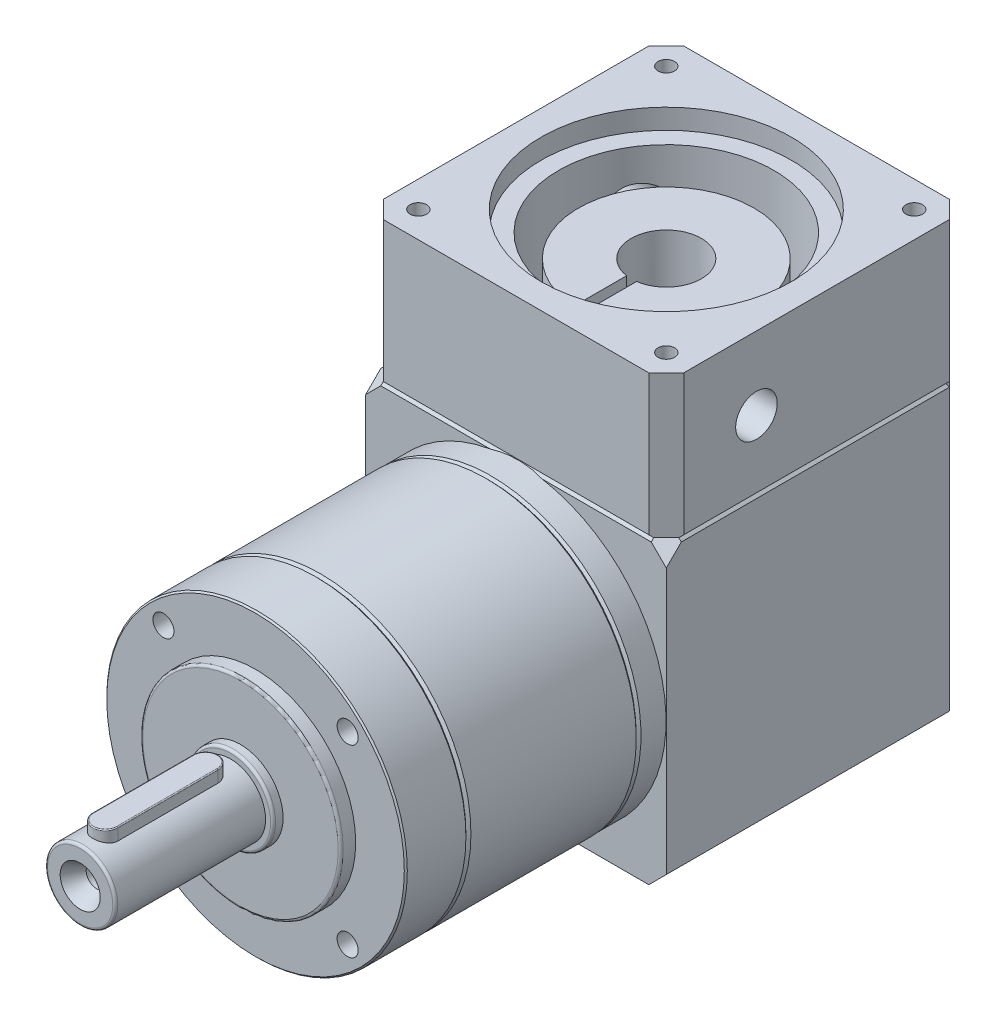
ISO-10303-21;
HEADER;
FILE_DESCRIPTION(('STEP AP214'),'2;1');
FILE_NAME('part.step','',(''),(''),'','','');
FILE_SCHEMA(('AUTOMOTIVE_DESIGN { 1 0 10303 214 1 1 1 1 }'));
ENDSEC;
DATA;
#1=APPLICATION_CONTEXT('core data for automotive mechanical design processes');
#2=APPLICATION_PROTOCOL_DEFINITION('international standard','automotive_design',2000,#1);
#3=PRODUCT_CONTEXT('',#1,'mechanical');
#4=PRODUCT('Part','Part','',(#3));
#5=PRODUCT_RELATED_PRODUCT_CATEGORY('part','',(#4));
#6=PRODUCT_DEFINITION_FORMATION('','',#4);
#7=PRODUCT_DEFINITION_CONTEXT('part definition',#1,'design');
#8=PRODUCT_DEFINITION('design','',#6,#7);
#9=PRODUCT_DEFINITION_SHAPE('','',#8);
#10=(LENGTH_UNIT() NAMED_UNIT(*) SI_UNIT(.MILLI.,.METRE.));
#11=(NAMED_UNIT(*) PLANE_ANGLE_UNIT() SI_UNIT($,.RADIAN.));
#12=(NAMED_UNIT(*) SI_UNIT($,.STERADIAN.) SOLID_ANGLE_UNIT());
#13=UNCERTAINTY_MEASURE_WITH_UNIT(LENGTH_MEASURE(1.E-05),#10,'distance_accuracy_value','');
#14=(GEOMETRIC_REPRESENTATION_CONTEXT(3) GLOBAL_UNCERTAINTY_ASSIGNED_CONTEXT((#13)) GLOBAL_UNIT_ASSIGNED_CONTEXT((#10,
#11,#12)) REPRESENTATION_CONTEXT('',''));
#15=CARTESIAN_POINT('',(0.,0.,0.));
#16=DIRECTION('',(0.,0.,1.));
#17=DIRECTION('',(1.,0.,0.));
#18=AXIS2_PLACEMENT_3D('',#15,#16,#17);
#19=CARTESIAN_POINT('',(-34.5923304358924,19.5764976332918,110.428203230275));
#20=DIRECTION('',(-1.,0.,0.));
#21=DIRECTION('',(0.,1.,0.));
#22=AXIS2_PLACEMENT_3D('',#19,#20,#21);
#23=PLANE('',#22);
#24=CARTESIAN_POINT('',(-34.5923304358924,24.4764976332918,115.5));
#25=DIRECTION('',(1.,0.,0.));
#26=DIRECTION('',(0.,0.,-1.));
#27=AXIS2_PLACEMENT_3D('',#24,#25,#26);
#28=CIRCLE('',#27,2.525);
#29=CARTESIAN_POINT('',(-34.5923304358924,24.4764976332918,112.975));
#30=VERTEX_POINT('',#29);
#31=EDGE_CURVE('P0_E1182',#30,#30,#28,.T.);
#32=ORIENTED_EDGE('',*,*,#31,.F.);
#33=EDGE_LOOP('',(#32));
#34=FACE_BOUND('',#33,.T.);
#35=DIRECTION('',(0.,0.,1.));
#36=VECTOR('',#35,1.);
#37=CARTESIAN_POINT('',(-34.5923304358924,30.5764976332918,110.428203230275));
#38=LINE('',#37,#36);
#39=CARTESIAN_POINT('',(-34.5923304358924,30.5764976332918,110.428203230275));
#40=VERTEX_POINT('',#39);
#41=CARTESIAN_POINT('',(-34.5923304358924,30.5764976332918,120.971405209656));
#42=VERTEX_POINT('',#41);
#43=EDGE_CURVE('P0_E651',#40,#42,#38,.T.);
#44=ORIENTED_EDGE('',*,*,#43,.T.);
#45=DIRECTION('',(0.,1.,0.));
#46=VECTOR('',#45,1.);
#47=CARTESIAN_POINT('',(-34.5923304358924,19.5764976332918,120.971405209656));
#48=LINE('',#47,#46);
#49=CARTESIAN_POINT('',(-34.5923304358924,19.5764976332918,120.971405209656));
#50=VERTEX_POINT('',#49);
#51=EDGE_CURVE('P0_E958',#50,#42,#48,.T.);
#52=ORIENTED_EDGE('',*,*,#51,.F.);
#53=DIRECTION('',(0.,0.,1.));
#54=VECTOR('',#53,1.);
#55=CARTESIAN_POINT('',(-34.5923304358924,19.5764976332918,110.428203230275));
#56=LINE('',#55,#54);
#57=CARTESIAN_POINT('',(-34.5923304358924,19.5764976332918,113.449874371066));
#58=VERTEX_POINT('',#57);
#59=EDGE_CURVE('P0_E903',#58,#50,#56,.T.);
#60=ORIENTED_EDGE('',*,*,#59,.F.);
#61=DIRECTION('',(0.,0.,1.));
#62=VECTOR('',#61,1.);
#63=CARTESIAN_POINT('',(-34.5923304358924,19.5764976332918,110.428203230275));
#64=LINE('',#63,#62);
#65=CARTESIAN_POINT('',(-34.5923304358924,19.5764976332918,110.428203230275));
#66=VERTEX_POINT('',#65);
#67=EDGE_CURVE('P0_E656',#66,#58,#64,.T.);
#68=ORIENTED_EDGE('',*,*,#67,.F.);
#69=DIRECTION('',(0.,1.,0.));
#70=VECTOR('',#69,1.);
#71=CARTESIAN_POINT('',(-34.5923304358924,19.5764976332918,110.428203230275));
#72=LINE('',#71,#70);
#73=EDGE_CURVE('P0_E650',#66,#40,#72,.T.);
#74=ORIENTED_EDGE('',*,*,#73,.T.);
#75=EDGE_LOOP('',(#44,#52,#60,#68,#74));
#76=FACE_BOUND('',#75,.T.);
#77=ADVANCED_FACE('P0_F18',(#34,#76),#23,.F.);
#78=CARTESIAN_POINT('',(-33.5923304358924,-19.4235023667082,188.5));
#79=DIRECTION('',(0.,0.,1.));
#80=DIRECTION('',(1.,0.,0.));
#81=AXIS2_PLACEMENT_3D('',#78,#79,#80);
#82=PLANE('',#81);
#83=CARTESIAN_POINT('',(-33.5923304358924,-19.4235023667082,188.499999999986));
#84=DIRECTION('',(0.,0.,1.));
#85=DIRECTION('',(1.,0.,0.));
#86=AXIS2_PLACEMENT_3D('',#83,#84,#85);
#87=CIRCLE('',#86,8.5);
#88=CARTESIAN_POINT('',(-25.0923304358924,-19.4235023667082,188.499999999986));
#89=VERTEX_POINT('',#88);
#90=EDGE_CURVE('P0_E438',#89,#89,#87,.T.);
#91=ORIENTED_EDGE('',*,*,#90,.F.);
#92=EDGE_LOOP('',(#91));
#93=FACE_BOUND('',#92,.T.);
#94=CARTESIAN_POINT('',(-33.5923304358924,-19.4235023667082,188.5));
#95=DIRECTION('',(0.,0.,1.));
#96=DIRECTION('',(1.,0.,0.));
#97=AXIS2_PLACEMENT_3D('',#94,#95,#96);
#98=CIRCLE('',#97,19.5);
#99=CARTESIAN_POINT('',(-14.0923304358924,-19.4235023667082,188.5));
#100=VERTEX_POINT('',#99);
#101=EDGE_CURVE('P0_E584',#100,#100,#98,.T.);
#102=ORIENTED_EDGE('',*,*,#101,.T.);
#103=EDGE_LOOP('',(#102));
#104=FACE_BOUND('',#103,.T.);
#105=ADVANCED_FACE('P0_F476',(#93,#104),#82,.T.);
#106=CARTESIAN_POINT('',(-33.5923304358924,-19.4235023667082,185.5));
#107=DIRECTION('',(0.,0.,1.));
#108=DIRECTION('',(1.,0.,0.));
#109=AXIS2_PLACEMENT_3D('',#106,#107,#108);
#110=PLANE('',#109);
#111=CARTESIAN_POINT('',(-15.207554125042,-37.8082786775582,185.5));
#112=DIRECTION('',(0.,0.,1.));
#113=DIRECTION('',(1.,0.,0.));
#114=AXIS2_PLACEMENT_3D('',#111,#112,#113);
#115=CIRCLE('',#114,2.1);
#116=CARTESIAN_POINT('',(-13.107554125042,-37.8082786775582,185.5));
#117=VERTEX_POINT('',#116);
#118=EDGE_CURVE('P0_E595',#117,#117,#115,.T.);
#119=ORIENTED_EDGE('',*,*,#118,.F.);
#120=EDGE_LOOP('',(#119));
#121=FACE_BOUND('',#120,.T.);
#122=CARTESIAN_POINT('',(-51.9771067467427,-37.8082786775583,185.5));
#123=DIRECTION('',(0.,0.,1.));
#124=DIRECTION('',(1.,0.,0.));
#125=AXIS2_PLACEMENT_3D('',#122,#123,#124);
#126=CIRCLE('',#125,2.1);
#127=CARTESIAN_POINT('',(-49.8771067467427,-37.8082786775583,185.5));
#128=VERTEX_POINT('',#127);
#129=EDGE_CURVE('P0_E677',#128,#128,#126,.T.);
#130=ORIENTED_EDGE('',*,*,#129,.F.);
#131=EDGE_LOOP('',(#130));
#132=FACE_BOUND('',#131,.T.);
#133=CARTESIAN_POINT('',(-51.9771067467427,-1.03872605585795,185.5));
#134=DIRECTION('',(0.,0.,1.));
#135=DIRECTION('',(1.,0.,0.));
#136=AXIS2_PLACEMENT_3D('',#133,#134,#135);
#137=CIRCLE('',#136,2.1);
#138=CARTESIAN_POINT('',(-49.8771067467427,-1.03872605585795,185.5));
#139=VERTEX_POINT('',#138);
#140=EDGE_CURVE('P0_E809',#139,#139,#137,.T.);
#141=ORIENTED_EDGE('',*,*,#140,.F.);
#142=EDGE_LOOP('',(#141));
#143=FACE_BOUND('',#142,.T.);
#144=CARTESIAN_POINT('',(-15.2075541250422,-1.03872605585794,185.5));
#145=DIRECTION('',(0.,0.,1.));
#146=DIRECTION('',(1.,0.,0.));
#147=AXIS2_PLACEMENT_3D('',#144,#145,#146);
#148=CIRCLE('',#147,2.1);
#149=CARTESIAN_POINT('',(-13.1075541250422,-1.03872605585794,185.5));
#150=VERTEX_POINT('',#149);
#151=EDGE_CURVE('P0_E786',#150,#150,#148,.T.);
#152=ORIENTED_EDGE('',*,*,#151,.F.);
#153=EDGE_LOOP('',(#152));
#154=FACE_BOUND('',#153,.T.);
#155=CARTESIAN_POINT('',(-33.5923304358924,-19.4235023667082,185.5));
#156=DIRECTION('',(0.,0.,1.));
#157=DIRECTION('',(1.,0.,0.));
#158=AXIS2_PLACEMENT_3D('',#155,#156,#157);
#159=CIRCLE('',#158,20.);
#160=CARTESIAN_POINT('',(-13.5923304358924,-19.4235023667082,185.5));
#161=VERTEX_POINT('',#160);
#162=EDGE_CURVE('P0_E790',#161,#161,#159,.T.);
#163=ORIENTED_EDGE('',*,*,#162,.F.);
#164=EDGE_LOOP('',(#163));
#165=FACE_BOUND('',#164,.T.);
#166=CARTESIAN_POINT('',(-33.5923304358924,-19.4235023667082,185.5));
#167=DIRECTION('',(0.,0.,1.));
#168=DIRECTION('',(1.,0.,0.));
#169=AXIS2_PLACEMENT_3D('',#166,#167,#168);
#170=CIRCLE('',#169,29.7);
#171=CARTESIAN_POINT('',(-3.8923304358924,-19.4235023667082,185.5));
#172=VERTEX_POINT('',#171);
#173=EDGE_CURVE('P0_E668',#172,#172,#170,.T.);
#174=ORIENTED_EDGE('',*,*,#173,.T.);
#175=EDGE_LOOP('',(#174));
#176=FACE_BOUND('',#175,.T.);
#177=ADVANCED_FACE('P0_F472',(#121,#132,#143,#154,#165,#176),#110,.T.);
#178=CARTESIAN_POINT('',(-33.5923304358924,-19.4235023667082,190.5));
#179=DIRECTION('',(0.,0.,1.));
#180=DIRECTION('',(1.,0.,0.));
#181=AXIS2_PLACEMENT_3D('',#178,#179,#180);
#182=PLANE('',#181);
#183=CARTESIAN_POINT('',(-33.5923304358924,-19.4235023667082,190.5));
#184=DIRECTION('',(0.,0.,-1.));
#185=DIRECTION('',(1.,0.,0.));
#186=AXIS2_PLACEMENT_3D('',#183,#184,#185);
#187=CIRCLE('',#186,7.);
#188=CARTESIAN_POINT('',(-26.5923304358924,-19.4235023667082,190.5));
#189=VERTEX_POINT('',#188);
#190=EDGE_CURVE('P0_E431',#189,#189,#187,.T.);
#191=ORIENTED_EDGE('',*,*,#190,.T.);
#192=EDGE_LOOP('',(#191));
#193=FACE_BOUND('',#192,.T.);
#194=CARTESIAN_POINT('',(-33.5923304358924,-19.4235023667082,190.5));
#195=DIRECTION('',(0.,0.,1.));
#196=DIRECTION('',(1.,0.,0.));
#197=AXIS2_PLACEMENT_3D('',#194,#195,#196);
#198=CIRCLE('',#197,8.);
#199=CARTESIAN_POINT('',(-25.5923304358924,-19.4235023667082,190.5));
#200=VERTEX_POINT('',#199);
#201=EDGE_CURVE('P0_E779',#200,#200,#198,.T.);
#202=ORIENTED_EDGE('',*,*,#201,.T.);
#203=EDGE_LOOP('',(#202));
#204=FACE_BOUND('',#203,.T.);
#205=ADVANCED_FACE('P0_F475',(#193,#204),#182,.T.);
#206=CARTESIAN_POINT('',(-33.5923304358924,-19.4235023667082,220.5));
#207=DIRECTION('',(0.,0.,1.));
#208=DIRECTION('',(1.,0.,0.));
#209=AXIS2_PLACEMENT_3D('',#206,#207,#208);
#210=PLANE('',#209);
#211=CARTESIAN_POINT('',(-33.5923304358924,-19.4235023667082,220.5));
#212=DIRECTION('',(0.,0.,1.));
#213=DIRECTION('',(1.,0.,0.));
#214=AXIS2_PLACEMENT_3D('',#211,#212,#213);
#215=CIRCLE('',#214,4.);
#216=CARTESIAN_POINT('',(-29.5923304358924,-19.4235023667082,220.5));
#217=VERTEX_POINT('',#216);
#218=EDGE_CURVE('P0_E767',#217,#217,#215,.T.);
#219=ORIENTED_EDGE('',*,*,#218,.F.);
#220=EDGE_LOOP('',(#219));
#221=FACE_BOUND('',#220,.T.);
#222=CARTESIAN_POINT('',(-33.5923304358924,-19.4235023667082,220.5));
#223=DIRECTION('',(0.,0.,1.));
#224=DIRECTION('',(1.,0.,0.));
#225=AXIS2_PLACEMENT_3D('',#222,#223,#224);
#226=CIRCLE('',#225,6.5);
#227=CARTESIAN_POINT('',(-27.0923304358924,-19.4235023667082,220.5));
#228=VERTEX_POINT('',#227);
#229=EDGE_CURVE('P0_E626',#228,#228,#226,.T.);
#230=ORIENTED_EDGE('',*,*,#229,.T.);
#231=EDGE_LOOP('',(#230));
#232=FACE_BOUND('',#231,.T.);
#233=ADVANCED_FACE('P0_F1779',(#221,#232),#210,.T.);
#234=CARTESIAN_POINT('',(-36.0923304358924,-10.4235023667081,195.5));
#235=DIRECTION('',(1.,0.,0.));
#236=DIRECTION('',(0.,0.,-1.));
#237=AXIS2_PLACEMENT_3D('',#234,#235,#236);
#238=PLANE('',#237);
#239=DIRECTION('',(0.,-1.,0.));
#240=VECTOR('',#239,1.);
#241=CARTESIAN_POINT('',(-36.0923304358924,-10.4235023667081,215.5));
#242=LINE('',#241,#240);
#243=CARTESIAN_POINT('',(-36.0923304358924,-10.6235023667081,215.5));
#244=VERTEX_POINT('',#243);
#245=CARTESIAN_POINT('',(-36.0923304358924,-12.8851539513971,215.5));
#246=VERTEX_POINT('',#245);
#247=EDGE_CURVE('P0_E11',#244,#246,#242,.T.);
#248=ORIENTED_EDGE('',*,*,#247,.F.);
#249=DIRECTION('',(0.,0.,-1.));
#250=VECTOR('',#249,1.);
#251=CARTESIAN_POINT('',(-36.0923304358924,-10.6235023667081,195.5));
#252=LINE('',#251,#250);
#253=CARTESIAN_POINT('',(-36.0923304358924,-10.6235023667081,195.5));
#254=VERTEX_POINT('',#253);
#255=EDGE_CURVE('P0_E403',#244,#254,#252,.T.);
#256=ORIENTED_EDGE('',*,*,#255,.T.);
#257=DIRECTION('',(0.,-1.,0.));
#258=VECTOR('',#257,1.);
#259=CARTESIAN_POINT('',(-36.0923304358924,-10.4235023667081,195.5));
#260=LINE('',#259,#258);
#261=CARTESIAN_POINT('',(-36.0923304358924,-12.8851539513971,195.5));
#262=VERTEX_POINT('',#261);
#263=EDGE_CURVE('P0_E434',#254,#262,#260,.T.);
#264=ORIENTED_EDGE('',*,*,#263,.T.);
#265=DIRECTION('',(0.,0.,1.));
#266=VECTOR('',#265,1.);
#267=CARTESIAN_POINT('',(-36.0923304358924,-12.8851539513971,220.5));
#268=LINE('',#267,#266);
#269=EDGE_CURVE('P0_E419',#262,#246,#268,.T.);
#270=ORIENTED_EDGE('',*,*,#269,.T.);
#271=EDGE_LOOP('',(#248,#256,#264,#270));
#272=FACE_BOUND('',#271,.T.);
#273=ADVANCED_FACE('P0_F1244',(#272),#238,.F.);
#274=CARTESIAN_POINT('',(-33.5923304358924,-10.4235023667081,215.5));
#275=DIRECTION('',(0.,-1.,0.));
#276=DIRECTION('',(0.,0.,-1.));
#277=AXIS2_PLACEMENT_3D('',#274,#275,#276);
#278=CYLINDRICAL_SURFACE('',#277,2.5);
#279=DIRECTION('',(0.,-1.,0.));
#280=VECTOR('',#279,1.);
#281=CARTESIAN_POINT('',(-31.0923304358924,-10.4235023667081,215.5));
#282=LINE('',#281,#280);
#283=CARTESIAN_POINT('',(-31.0923304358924,-10.6235023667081,215.5));
#284=VERTEX_POINT('',#283);
#285=CARTESIAN_POINT('',(-31.0923304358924,-12.8851539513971,215.5));
#286=VERTEX_POINT('',#285);
#287=EDGE_CURVE('P0_E33',#284,#286,#282,.T.);
#288=ORIENTED_EDGE('',*,*,#287,.F.);
#289=CARTESIAN_POINT('',(-33.5923304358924,-10.6235023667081,215.5));
#290=DIRECTION('',(0.,-1.,0.));
#291=DIRECTION('',(0.,0.,-1.));
#292=AXIS2_PLACEMENT_3D('',#289,#290,#291);
#293=CIRCLE('',#292,2.5);
#294=EDGE_CURVE('P0_E388',#284,#244,#293,.T.);
#295=ORIENTED_EDGE('',*,*,#294,.T.);
#296=ORIENTED_EDGE('',*,*,#247,.T.);
#297=CARTESIAN_POINT('',(-36.0923304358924,-12.8851539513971,215.5));
#298=CARTESIAN_POINT('',(-36.0923397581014,-12.8851658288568,215.567889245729));
#299=CARTESIAN_POINT('',(-36.0895652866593,-12.8840968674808,215.635771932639));
#300=CARTESIAN_POINT('',(-36.078521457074,-12.8798857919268,215.771003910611));
#301=CARTESIAN_POINT('',(-36.0702537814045,-12.8767443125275,215.838353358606));
#302=CARTESIAN_POINT('',(-36.0483321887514,-12.8684901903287,215.971821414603));
#303=CARTESIAN_POINT('',(-36.034696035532,-12.8633840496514,216.03794333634));
#304=CARTESIAN_POINT('',(-36.0021815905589,-12.8513705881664,216.168701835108));
#305=CARTESIAN_POINT('',(-35.9833030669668,-12.8444631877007,216.233338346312));
#306=CARTESIAN_POINT('',(-35.9190700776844,-12.8213530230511,216.424264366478));
#307=CARTESIAN_POINT('',(-35.8660815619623,-12.8027476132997,216.547790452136));
#308=CARTESIAN_POINT('',(-35.7414380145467,-12.7612483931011,216.784230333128));
#309=CARTESIAN_POINT('',(-35.6697693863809,-12.7383514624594,216.897136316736));
#310=CARTESIAN_POINT('',(-35.5063561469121,-12.6897032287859,217.114215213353));
#311=CARTESIAN_POINT('',(-35.4139138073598,-12.6638737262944,217.217846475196));
#312=CARTESIAN_POINT('',(-35.2130643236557,-12.6129264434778,217.408508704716));
#313=CARTESIAN_POINT('',(-35.1046542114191,-12.5878087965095,217.495536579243));
#314=CARTESIAN_POINT('',(-34.8708695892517,-12.5401910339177,217.653089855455));
#315=CARTESIAN_POINT('',(-34.7450787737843,-12.5177940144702,217.723031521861));
#316=CARTESIAN_POINT('',(-34.482581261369,-12.4790787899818,217.840536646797));
#317=CARTESIAN_POINT('',(-34.3458783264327,-12.4627585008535,217.888107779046));
#318=CARTESIAN_POINT('',(-34.0711604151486,-12.438591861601,217.957640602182));
#319=CARTESIAN_POINT('',(-33.9334102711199,-12.430436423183,217.980539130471));
#320=CARTESIAN_POINT('',(-33.6557947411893,-12.4224143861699,218.003068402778));
#321=CARTESIAN_POINT('',(-33.515929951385,-12.4225454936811,218.002705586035));
#322=CARTESIAN_POINT('',(-33.2447371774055,-12.4308797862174,217.979288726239));
#323=CARTESIAN_POINT('',(-33.1133080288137,-12.438719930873,217.957255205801));
#324=CARTESIAN_POINT('',(-32.8561546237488,-12.4611240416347,217.892826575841));
#325=CARTESIAN_POINT('',(-32.730430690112,-12.4756883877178,217.850430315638));
#326=CARTESIAN_POINT('',(-32.4861694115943,-12.5103372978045,217.745953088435));
#327=CARTESIAN_POINT('',(-32.3677576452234,-12.530496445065,217.68360428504));
#328=CARTESIAN_POINT('',(-32.1427951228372,-12.5742688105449,217.541220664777));
#329=CARTESIAN_POINT('',(-32.0362479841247,-12.5978830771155,217.461180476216));
#330=CARTESIAN_POINT('',(-31.8320059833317,-12.6475968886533,217.280676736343));
#331=CARTESIAN_POINT('',(-31.7350885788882,-12.6737618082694,217.179350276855));
#332=CARTESIAN_POINT('',(-31.5593312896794,-12.7245989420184,216.961672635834));
#333=CARTESIAN_POINT('',(-31.4804978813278,-12.7492706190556,216.845316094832));
#334=CARTESIAN_POINT('',(-31.3418318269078,-12.7947243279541,216.598057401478));
#335=CARTESIAN_POINT('',(-31.2823883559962,-12.8154236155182,216.466921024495));
#336=CARTESIAN_POINT('',(-31.1867760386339,-12.8496202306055,216.195635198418));
#337=CARTESIAN_POINT('',(-31.1505692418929,-12.8631292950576,216.055500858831));
#338=CARTESIAN_POINT('',(-31.1152754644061,-12.8764169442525,215.844969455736));
#339=CARTESIAN_POINT('',(-31.106676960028,-12.8796822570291,215.776263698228));
#340=CARTESIAN_POINT('',(-31.0952069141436,-12.8840532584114,215.638384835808));
#341=CARTESIAN_POINT('',(-31.0923290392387,-12.8851613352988,215.569212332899));
#342=CARTESIAN_POINT('',(-31.0923304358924,-12.8851539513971,215.5));
#343=B_SPLINE_CURVE_WITH_KNOTS('',3,(#297,#298,#299,#300,#301,#302,#303,#304,#305,#306,#307,
#308,#309,#310,#311,#312,#313,#314,#315,#316,#317,#318,#319,#320,#321,#322,#323,#324,#325,#326,
#327,#328,#329,#330,#331,#332,#333,#334,#335,#336,#337,#338,#339,#340,#341,#342),.UNSPECIFIED.,
.F.,.F.,(4,2,2,2,2,2,2,2,2,2,2,2,2,2,2,2,2,2,2,2,2,2,4),(0.,0.203591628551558,0.407120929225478,
0.609982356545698,0.812852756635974,1.21793118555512,1.62330528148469,2.0451597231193,
2.46709267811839,2.90188398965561,3.33652604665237,3.75400993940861,4.17137826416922,
4.56998920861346,4.96862268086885,5.37284909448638,5.7771984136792,6.20315837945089,
6.62927065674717,7.06347329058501,7.49696496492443,7.70468580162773,7.91217653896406),.UNSPECIFIED.);
#344=EDGE_CURVE('P0_E424',#246,#286,#343,.T.);
#345=ORIENTED_EDGE('',*,*,#344,.T.);
#346=EDGE_LOOP('',(#288,#295,#296,#345));
#347=FACE_BOUND('',#346,.T.);
#348=ADVANCED_FACE('P0_F1169',(#347),#278,.T.);
#349=CARTESIAN_POINT('',(-31.0923304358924,-10.4235023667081,195.5));
#350=DIRECTION('',(-1.,0.,0.));
#351=DIRECTION('',(0.,1.,0.));
#352=AXIS2_PLACEMENT_3D('',#349,#350,#351);
#353=PLANE('',#352);
#354=DIRECTION('',(0.,-1.,0.));
#355=VECTOR('',#354,1.);
#356=CARTESIAN_POINT('',(-31.0923304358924,-10.4235023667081,195.5));
#357=LINE('',#356,#355);
#358=CARTESIAN_POINT('',(-31.0923304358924,-10.6235023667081,195.5));
#359=VERTEX_POINT('',#358);
#360=CARTESIAN_POINT('',(-31.0923304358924,-12.8851539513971,195.5));
#361=VERTEX_POINT('',#360);
#362=EDGE_CURVE('P0_E408',#359,#361,#357,.T.);
#363=ORIENTED_EDGE('',*,*,#362,.F.);
#364=DIRECTION('',(0.,0.,1.));
#365=VECTOR('',#364,1.);
#366=CARTESIAN_POINT('',(-31.0923304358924,-10.6235023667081,195.5));
#367=LINE('',#366,#365);
#368=EDGE_CURVE('P0_E374',#359,#284,#367,.T.);
#369=ORIENTED_EDGE('',*,*,#368,.T.);
#370=ORIENTED_EDGE('',*,*,#287,.T.);
#371=DIRECTION('',(0.,0.,-1.));
#372=VECTOR('',#371,1.);
#373=CARTESIAN_POINT('',(-31.0923304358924,-12.8851539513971,220.5));
#374=LINE('',#373,#372);
#375=EDGE_CURVE('P0_E427',#286,#361,#374,.T.);
#376=ORIENTED_EDGE('',*,*,#375,.T.);
#377=EDGE_LOOP('',(#363,#369,#370,#376));
#378=FACE_BOUND('',#377,.T.);
#379=ADVANCED_FACE('P0_F571',(#378),#353,.F.);
#380=CARTESIAN_POINT('',(-33.5923304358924,-10.4235023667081,195.5));
#381=DIRECTION('',(0.,-1.,0.));
#382=DIRECTION('',(0.,0.,-1.));
#383=AXIS2_PLACEMENT_3D('',#380,#381,#382);
#384=PLANE('',#383);
#385=DIRECTION('',(0.,0.,1.));
#386=VECTOR('',#385,1.);
#387=CARTESIAN_POINT('',(-35.8923304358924,-10.4235023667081,195.5));
#388=LINE('',#387,#386);
#389=CARTESIAN_POINT('',(-35.8923304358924,-10.4235023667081,195.5));
#390=VERTEX_POINT('',#389);
#391=CARTESIAN_POINT('',(-35.8923304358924,-10.4235023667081,215.5));
#392=VERTEX_POINT('',#391);
#393=EDGE_CURVE('P0_E380',#390,#392,#388,.T.);
#394=ORIENTED_EDGE('',*,*,#393,.T.);
#395=CARTESIAN_POINT('',(-33.5923304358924,-10.4235023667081,215.5));
#396=DIRECTION('',(0.,1.,0.));
#397=DIRECTION('',(0.,0.,-1.));
#398=AXIS2_PLACEMENT_3D('',#395,#396,#397);
#399=CIRCLE('',#398,2.3);
#400=CARTESIAN_POINT('',(-31.2923304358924,-10.4235023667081,215.5));
#401=VERTEX_POINT('',#400);
#402=EDGE_CURVE('P0_E377',#392,#401,#399,.T.);
#403=ORIENTED_EDGE('',*,*,#402,.T.);
#404=DIRECTION('',(0.,0.,-1.));
#405=VECTOR('',#404,1.);
#406=CARTESIAN_POINT('',(-31.2923304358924,-10.4235023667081,195.5));
#407=LINE('',#406,#405);
#408=CARTESIAN_POINT('',(-31.2923304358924,-10.4235023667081,195.5));
#409=VERTEX_POINT('',#408);
#410=EDGE_CURVE('P0_E364',#401,#409,#407,.T.);
#411=ORIENTED_EDGE('',*,*,#410,.T.);
#412=CARTESIAN_POINT('',(-33.5923304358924,-10.4235023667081,195.5));
#413=DIRECTION('',(0.,1.,0.));
#414=DIRECTION('',(0.,0.,-1.));
#415=AXIS2_PLACEMENT_3D('',#412,#413,#414);
#416=CIRCLE('',#415,2.3);
#417=EDGE_CURVE('P0_E48',#409,#390,#416,.T.);
#418=ORIENTED_EDGE('',*,*,#417,.T.);
#419=EDGE_LOOP('',(#394,#403,#411,#418));
#420=FACE_BOUND('',#419,.T.);
#421=ADVANCED_FACE('P0_F378',(#420),#384,.F.);
#422=CARTESIAN_POINT('',(-35.8923304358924,-10.6235023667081,195.5));
#423=DIRECTION('',(0.,0.,1.));
#424=DIRECTION('',(1.,0.,0.));
#425=AXIS2_PLACEMENT_3D('',#422,#423,#424);
#426=CYLINDRICAL_SURFACE('',#425,0.2);
#427=CARTESIAN_POINT('',(-35.8923304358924,-10.6235023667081,195.5));
#428=DIRECTION('',(0.,0.,1.));
#429=DIRECTION('',(1.,0.,0.));
#430=AXIS2_PLACEMENT_3D('',#427,#428,#429);
#431=CIRCLE('',#430,0.2);
#432=EDGE_CURVE('P0_E688',#390,#254,#431,.T.);
#433=ORIENTED_EDGE('',*,*,#432,.T.);
#434=ORIENTED_EDGE('',*,*,#255,.F.);
#435=CARTESIAN_POINT('',(-35.8923304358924,-10.6235023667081,215.5));
#436=DIRECTION('',(0.,0.,1.));
#437=DIRECTION('',(1.,0.,0.));
#438=AXIS2_PLACEMENT_3D('',#435,#436,#437);
#439=CIRCLE('',#438,0.2);
#440=EDGE_CURVE('P0_E395',#392,#244,#439,.T.);
#441=ORIENTED_EDGE('',*,*,#440,.F.);
#442=ORIENTED_EDGE('',*,*,#393,.F.);
#443=EDGE_LOOP('',(#433,#434,#441,#442));
#444=FACE_BOUND('',#443,.T.);
#445=ADVANCED_FACE('P0_F540',(#444),#426,.T.);
#446=CARTESIAN_POINT('',(-31.2923304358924,-10.6235023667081,195.5));
#447=DIRECTION('',(0.,0.,-1.));
#448=DIRECTION('',(-1.,0.,0.));
#449=AXIS2_PLACEMENT_3D('',#446,#447,#448);
#450=CYLINDRICAL_SURFACE('',#449,0.2);
#451=CARTESIAN_POINT('',(-31.2923304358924,-10.6235023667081,195.5));
#452=DIRECTION('',(0.,0.,1.));
#453=DIRECTION('',(1.,0.,0.));
#454=AXIS2_PLACEMENT_3D('',#451,#452,#453);
#455=CIRCLE('',#454,0.2);
#456=EDGE_CURVE('P0_E371',#359,#409,#455,.T.);
#457=ORIENTED_EDGE('',*,*,#456,.T.);
#458=ORIENTED_EDGE('',*,*,#410,.F.);
#459=CARTESIAN_POINT('',(-31.2923304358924,-10.6235023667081,215.5));
#460=DIRECTION('',(0.,0.,1.));
#461=DIRECTION('',(1.,0.,0.));
#462=AXIS2_PLACEMENT_3D('',#459,#460,#461);
#463=CIRCLE('',#462,0.2);
#464=EDGE_CURVE('P0_E369',#284,#401,#463,.T.);
#465=ORIENTED_EDGE('',*,*,#464,.F.);
#466=ORIENTED_EDGE('',*,*,#368,.F.);
#467=EDGE_LOOP('',(#457,#458,#465,#466));
#468=FACE_BOUND('',#467,.T.);
#469=ADVANCED_FACE('P0_F366',(#468),#450,.T.);
#470=CARTESIAN_POINT('',(-33.5923304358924,-10.6235023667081,215.5));
#471=DIRECTION('',(0.,-1.,0.));
#472=DIRECTION('',(0.,0.,-1.));
#473=AXIS2_PLACEMENT_3D('',#470,#471,#472);
#474=TOROIDAL_SURFACE('',#473,2.3,0.2);
#475=ORIENTED_EDGE('',*,*,#440,.T.);
#476=ORIENTED_EDGE('',*,*,#294,.F.);
#477=ORIENTED_EDGE('',*,*,#464,.T.);
#478=ORIENTED_EDGE('',*,*,#402,.F.);
#479=EDGE_LOOP('',(#475,#476,#477,#478));
#480=FACE_BOUND('',#479,.T.);
#481=ADVANCED_FACE('P0_F386',(#480),#474,.T.);
#482=CARTESIAN_POINT('',(-3.59233043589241,10.5764976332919,73.5));
#483=DIRECTION('',(-1.,0.,0.));
#484=DIRECTION('',(0.,0.,1.));
#485=AXIS2_PLACEMENT_3D('',#482,#483,#484);
#486=PLANE('',#485);
#487=DIRECTION('',(0.,1.,0.));
#488=VECTOR('',#487,1.);
#489=CARTESIAN_POINT('',(-3.59233043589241,10.5764976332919,77.));
#490=LINE('',#489,#488);
#491=CARTESIAN_POINT('',(-3.59233043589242,-45.9235023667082,77.));
#492=VERTEX_POINT('',#491);
#493=CARTESIAN_POINT('',(-3.59233043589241,10.0764976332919,77.));
#494=VERTEX_POINT('',#493);
#495=EDGE_CURVE('P0_E874',#492,#494,#490,.T.);
#496=ORIENTED_EDGE('',*,*,#495,.T.);
#497=DIRECTION('',(0.,0.,1.));
#498=VECTOR('',#497,1.);
#499=CARTESIAN_POINT('',(-3.59233043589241,10.0764976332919,73.5));
#500=LINE('',#499,#498);
#501=CARTESIAN_POINT('',(-3.59233043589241,10.0764976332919,130.5));
#502=VERTEX_POINT('',#501);
#503=EDGE_CURVE('P0_E1094',#494,#502,#500,.T.);
#504=ORIENTED_EDGE('',*,*,#503,.T.);
#505=DIRECTION('',(0.,0.707106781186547,-0.707106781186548));
#506=VECTOR('',#505,1.);
#507=CARTESIAN_POINT('',(-3.5923304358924,38.8264976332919,101.75));
#508=LINE('',#507,#506);
#509=CARTESIAN_POINT('',(-3.59233043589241,7.07649763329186,133.5));
#510=VERTEX_POINT('',#509);
#511=EDGE_CURVE('P0_E965',#510,#502,#508,.T.);
#512=ORIENTED_EDGE('',*,*,#511,.F.);
#513=DIRECTION('',(0.,-1.,0.));
#514=VECTOR('',#513,1.);
#515=CARTESIAN_POINT('',(-3.59233043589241,10.5764976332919,133.5));
#516=LINE('',#515,#514);
#517=CARTESIAN_POINT('',(-3.59233043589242,-45.9235023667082,133.5));
#518=VERTEX_POINT('',#517);
#519=EDGE_CURVE('P0_E1157',#510,#518,#516,.T.);
#520=ORIENTED_EDGE('',*,*,#519,.T.);
#521=DIRECTION('',(0.,0.,-1.));
#522=VECTOR('',#521,1.);
#523=CARTESIAN_POINT('',(-3.59233043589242,-45.9235023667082,73.5));
#524=LINE('',#523,#522);
#525=EDGE_CURVE('P0_E609',#518,#492,#524,.T.);
#526=ORIENTED_EDGE('',*,*,#525,.T.);
#527=EDGE_LOOP('',(#496,#504,#512,#520,#526));
#528=FACE_BOUND('',#527,.T.);
#529=ADVANCED_FACE('P0_F565',(#528),#486,.F.);
#530=CARTESIAN_POINT('',(-3.59233043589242,-49.4235023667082,73.5));
#531=DIRECTION('',(0.,1.,0.));
#532=DIRECTION('',(1.,0.,0.));
#533=AXIS2_PLACEMENT_3D('',#530,#531,#532);
#534=PLANE('',#533);
#535=DIRECTION('',(1.,0.,0.));
#536=VECTOR('',#535,1.);
#537=CARTESIAN_POINT('',(-3.59233043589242,-49.4235023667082,77.));
#538=LINE('',#537,#536);
#539=CARTESIAN_POINT('',(-60.0923304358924,-49.4235023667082,77.));
#540=VERTEX_POINT('',#539);
#541=CARTESIAN_POINT('',(-7.09233043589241,-49.4235023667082,77.));
#542=VERTEX_POINT('',#541);
#543=EDGE_CURVE('P0_E760',#540,#542,#538,.T.);
#544=ORIENTED_EDGE('',*,*,#543,.T.);
#545=DIRECTION('',(0.,0.,1.));
#546=VECTOR('',#545,1.);
#547=CARTESIAN_POINT('',(-7.09233043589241,-49.4235023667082,73.5));
#548=LINE('',#547,#546);
#549=CARTESIAN_POINT('',(-7.09233043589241,-49.4235023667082,133.5));
#550=VERTEX_POINT('',#549);
#551=EDGE_CURVE('P0_E1134',#542,#550,#548,.T.);
#552=ORIENTED_EDGE('',*,*,#551,.T.);
#553=DIRECTION('',(-1.,0.,0.));
#554=VECTOR('',#553,1.);
#555=CARTESIAN_POINT('',(-3.59233043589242,-49.4235023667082,133.5));
#556=LINE('',#555,#554);
#557=CARTESIAN_POINT('',(-60.0923304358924,-49.4235023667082,133.5));
#558=VERTEX_POINT('',#557);
#559=EDGE_CURVE('P0_E857',#550,#558,#556,.T.);
#560=ORIENTED_EDGE('',*,*,#559,.T.);
#561=DIRECTION('',(0.,0.,-1.));
#562=VECTOR('',#561,1.);
#563=CARTESIAN_POINT('',(-60.0923304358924,-49.4235023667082,73.5));
#564=LINE('',#563,#562);
#565=EDGE_CURVE('P0_E755',#558,#540,#564,.T.);
#566=ORIENTED_EDGE('',*,*,#565,.T.);
#567=EDGE_LOOP('',(#544,#552,#560,#566));
#568=FACE_BOUND('',#567,.T.);
#569=ADVANCED_FACE('P0_F562',(#568),#534,.F.);
#570=CARTESIAN_POINT('',(-63.5923304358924,10.5764976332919,73.5));
#571=DIRECTION('',(1.,0.,0.));
#572=DIRECTION('',(0.,-1.,0.));
#573=AXIS2_PLACEMENT_3D('',#570,#571,#572);
#574=PLANE('',#573);
#575=DIRECTION('',(0.,-0.707106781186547,0.707106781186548));
#576=VECTOR('',#575,1.);
#577=CARTESIAN_POINT('',(-63.5923304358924,38.8264976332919,101.75));
#578=LINE('',#577,#576);
#579=CARTESIAN_POINT('',(-63.5923304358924,10.0764976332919,130.5));
#580=VERTEX_POINT('',#579);
#581=CARTESIAN_POINT('',(-63.5923304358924,7.07649763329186,133.5));
#582=VERTEX_POINT('',#581);
#583=EDGE_CURVE('P0_E798',#580,#582,#578,.T.);
#584=ORIENTED_EDGE('',*,*,#583,.F.);
#585=DIRECTION('',(0.,0.,-1.));
#586=VECTOR('',#585,1.);
#587=CARTESIAN_POINT('',(-63.5923304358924,10.0764976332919,73.5));
#588=LINE('',#587,#586);
#589=CARTESIAN_POINT('',(-63.5923304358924,10.0764976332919,77.));
#590=VERTEX_POINT('',#589);
#591=EDGE_CURVE('P0_E950',#580,#590,#588,.T.);
#592=ORIENTED_EDGE('',*,*,#591,.T.);
#593=DIRECTION('',(0.,-1.,0.));
#594=VECTOR('',#593,1.);
#595=CARTESIAN_POINT('',(-63.5923304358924,-49.4235023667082,77.));
#596=LINE('',#595,#594);
#597=CARTESIAN_POINT('',(-63.5923304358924,-45.9235023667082,77.));
#598=VERTEX_POINT('',#597);
#599=EDGE_CURVE('P0_E730',#590,#598,#596,.T.);
#600=ORIENTED_EDGE('',*,*,#599,.T.);
#601=DIRECTION('',(0.,0.,1.));
#602=VECTOR('',#601,1.);
#603=CARTESIAN_POINT('',(-63.5923304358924,-45.9235023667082,73.5));
#604=LINE('',#603,#602);
#605=CARTESIAN_POINT('',(-63.5923304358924,-45.9235023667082,133.5));
#606=VERTEX_POINT('',#605);
#607=EDGE_CURVE('P0_E1152',#598,#606,#604,.T.);
#608=ORIENTED_EDGE('',*,*,#607,.T.);
#609=DIRECTION('',(0.,1.,0.));
#610=VECTOR('',#609,1.);
#611=CARTESIAN_POINT('',(-63.5923304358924,10.5764976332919,133.5));
#612=LINE('',#611,#610);
#613=EDGE_CURVE('P0_E729',#606,#582,#612,.T.);
#614=ORIENTED_EDGE('',*,*,#613,.T.);
#615=EDGE_LOOP('',(#584,#592,#600,#608,#614));
#616=FACE_BOUND('',#615,.T.);
#617=ADVANCED_FACE('P0_F560',(#616),#574,.F.);
#618=CARTESIAN_POINT('',(-33.5923304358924,-19.4235023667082,73.5));
#619=DIRECTION('',(0.,0.,-1.));
#620=DIRECTION('',(0.,-1.,0.));
#621=AXIS2_PLACEMENT_3D('',#618,#619,#620);
#622=PLANE('',#621);
#623=DIRECTION('',(0.,1.,0.));
#624=VECTOR('',#623,1.);
#625=CARTESIAN_POINT('',(-60.0923304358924,10.5764976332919,73.5));
#626=LINE('',#625,#624);
#627=CARTESIAN_POINT('',(-60.0923304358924,-45.9235023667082,73.5));
#628=VERTEX_POINT('',#627);
#629=CARTESIAN_POINT('',(-60.0923304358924,10.0764976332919,73.5));
#630=VERTEX_POINT('',#629);
#631=EDGE_CURVE('P0_E726',#628,#630,#626,.T.);
#632=ORIENTED_EDGE('',*,*,#631,.T.);
#633=DIRECTION('',(1.,0.,0.));
#634=VECTOR('',#633,1.);
#635=CARTESIAN_POINT('',(-7.0923304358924,10.0764976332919,73.5));
#636=LINE('',#635,#634);
#637=CARTESIAN_POINT('',(-7.0923304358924,10.0764976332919,73.5));
#638=VERTEX_POINT('',#637);
#639=EDGE_CURVE('P0_E944',#630,#638,#636,.T.);
#640=ORIENTED_EDGE('',*,*,#639,.T.);
#641=DIRECTION('',(0.,-1.,0.));
#642=VECTOR('',#641,1.);
#643=CARTESIAN_POINT('',(-7.09233043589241,-49.4235023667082,73.5));
#644=LINE('',#643,#642);
#645=CARTESIAN_POINT('',(-7.09233043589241,-45.9235023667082,73.5));
#646=VERTEX_POINT('',#645);
#647=EDGE_CURVE('P0_E889',#638,#646,#644,.T.);
#648=ORIENTED_EDGE('',*,*,#647,.T.);
#649=DIRECTION('',(-1.,0.,0.));
#650=VECTOR('',#649,1.);
#651=CARTESIAN_POINT('',(-63.5923304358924,-45.9235023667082,73.5));
#652=LINE('',#651,#650);
#653=EDGE_CURVE('P0_E756',#646,#628,#652,.T.);
#654=ORIENTED_EDGE('',*,*,#653,.T.);
#655=EDGE_LOOP('',(#632,#640,#648,#654));
#656=FACE_BOUND('',#655,.T.);
#657=ADVANCED_FACE('P0_F556',(#656),#622,.T.);
#658=CARTESIAN_POINT('',(-33.5923304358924,-19.4235023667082,133.5));
#659=DIRECTION('',(0.,0.,-1.));
#660=DIRECTION('',(0.,-1.,0.));
#661=AXIS2_PLACEMENT_3D('',#658,#659,#660);
#662=PLANE('',#661);
#663=DIRECTION('',(0.707106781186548,-0.707106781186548,0.));
#664=VECTOR('',#663,1.);
#665=CARTESIAN_POINT('',(-5.34233043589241,8.82649763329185,133.5));
#666=LINE('',#665,#664);
#667=CARTESIAN_POINT('',(-6.59233043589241,10.0764976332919,133.5));
#668=VERTEX_POINT('',#667);
#669=EDGE_CURVE('P0_E961',#668,#510,#666,.T.);
#670=ORIENTED_EDGE('',*,*,#669,.F.);
#671=DIRECTION('',(-1.,0.,0.));
#672=VECTOR('',#671,1.);
#673=CARTESIAN_POINT('',(-33.5923304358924,10.0764976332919,133.5));
#674=LINE('',#673,#672);
#675=CARTESIAN_POINT('',(-28.4200485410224,10.0764976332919,133.5));
#676=VERTEX_POINT('',#675);
#677=EDGE_CURVE('P0_E1091',#668,#676,#674,.T.);
#678=ORIENTED_EDGE('',*,*,#677,.T.);
#679=CARTESIAN_POINT('',(-33.5923304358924,-19.4235023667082,133.5));
#680=DIRECTION('',(0.,0.,-1.));
#681=DIRECTION('',(-1.,0.,0.));
#682=AXIS2_PLACEMENT_3D('',#679,#680,#681);
#683=CIRCLE('',#682,29.95);
#684=CARTESIAN_POINT('',(-38.7646123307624,10.0764976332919,133.5));
#685=VERTEX_POINT('',#684);
#686=EDGE_CURVE('P0_E702',#676,#685,#683,.T.);
#687=ORIENTED_EDGE('',*,*,#686,.T.);
#688=DIRECTION('',(-1.,0.,0.));
#689=VECTOR('',#688,1.);
#690=CARTESIAN_POINT('',(-33.5923304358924,10.0764976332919,133.5));
#691=LINE('',#690,#689);
#692=CARTESIAN_POINT('',(-60.5923304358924,10.0764976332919,133.5));
#693=VERTEX_POINT('',#692);
#694=EDGE_CURVE('P0_E799',#685,#693,#691,.T.);
#695=ORIENTED_EDGE('',*,*,#694,.T.);
#696=DIRECTION('',(0.707106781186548,0.707106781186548,0.));
#697=VECTOR('',#696,1.);
#698=CARTESIAN_POINT('',(-61.8423304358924,8.82649763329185,133.5));
#699=LINE('',#698,#697);
#700=EDGE_CURVE('P0_E795',#582,#693,#699,.T.);
#701=ORIENTED_EDGE('',*,*,#700,.F.);
#702=ORIENTED_EDGE('',*,*,#613,.F.);
#703=DIRECTION('',(0.707106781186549,-0.707106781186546,0.));
#704=VECTOR('',#703,1.);
#705=CARTESIAN_POINT('',(-63.5923304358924,-45.9235023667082,133.5));
#706=LINE('',#705,#704);
#707=EDGE_CURVE('P0_E1148',#606,#558,#706,.T.);
#708=ORIENTED_EDGE('',*,*,#707,.T.);
#709=ORIENTED_EDGE('',*,*,#559,.F.);
#710=DIRECTION('',(0.707106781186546,0.707106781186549,0.));
#711=VECTOR('',#710,1.);
#712=CARTESIAN_POINT('',(-7.09233043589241,-49.4235023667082,133.5));
#713=LINE('',#712,#711);
#714=EDGE_CURVE('P0_E613',#550,#518,#713,.T.);
#715=ORIENTED_EDGE('',*,*,#714,.T.);
#716=ORIENTED_EDGE('',*,*,#519,.F.);
#717=EDGE_LOOP('',(#670,#678,#687,#695,#701,#702,#708,#709,#715,#716));
#718=FACE_BOUND('',#717,.T.);
#719=ADVANCED_FACE('P0_F559',(#718),#662,.F.);
#720=CARTESIAN_POINT('',(-60.0923304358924,-19.4235023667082,73.5));
#721=DIRECTION('',(-0.707106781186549,0.,-0.707106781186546));
#722=DIRECTION('',(-0.707106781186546,0.,0.707106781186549));
#723=AXIS2_PLACEMENT_3D('',#720,#721,#722);
#724=PLANE('',#723);
#725=ORIENTED_EDGE('',*,*,#599,.F.);
#726=DIRECTION('',(0.707106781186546,0.,-0.707106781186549));
#727=VECTOR('',#726,1.);
#728=CARTESIAN_POINT('',(-60.0923304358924,10.0764976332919,73.5));
#729=LINE('',#728,#727);
#730=EDGE_CURVE('P0_E951',#590,#630,#729,.T.);
#731=ORIENTED_EDGE('',*,*,#730,.T.);
#732=ORIENTED_EDGE('',*,*,#631,.F.);
#733=DIRECTION('',(0.707106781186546,0.,-0.707106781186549));
#734=VECTOR('',#733,1.);
#735=CARTESIAN_POINT('',(-61.8423304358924,-45.9235023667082,75.25));
#736=LINE('',#735,#734);
#737=EDGE_CURVE('P0_E873',#598,#628,#736,.T.);
#738=ORIENTED_EDGE('',*,*,#737,.F.);
#739=EDGE_LOOP('',(#725,#731,#732,#738));
#740=FACE_BOUND('',#739,.T.);
#741=ADVANCED_FACE('P0_F554',(#740),#724,.T.);
#742=CARTESIAN_POINT('',(-63.5923304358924,-45.9235023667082,73.5));
#743=DIRECTION('',(0.707106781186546,0.707106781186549,0.));
#744=DIRECTION('',(0.,0.,-1.));
#745=AXIS2_PLACEMENT_3D('',#742,#743,#744);
#746=PLANE('',#745);
#747=ORIENTED_EDGE('',*,*,#707,.F.);
#748=ORIENTED_EDGE('',*,*,#607,.F.);
#749=DIRECTION('',(-0.707106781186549,0.707106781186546,0.));
#750=VECTOR('',#749,1.);
#751=CARTESIAN_POINT('',(-60.0923304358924,-49.4235023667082,77.));
#752=LINE('',#751,#750);
#753=EDGE_CURVE('P0_E869',#540,#598,#752,.T.);
#754=ORIENTED_EDGE('',*,*,#753,.F.);
#755=ORIENTED_EDGE('',*,*,#565,.F.);
#756=EDGE_LOOP('',(#747,#748,#754,#755));
#757=FACE_BOUND('',#756,.T.);
#758=ADVANCED_FACE('P0_F547',(#757),#746,.F.);
#759=CARTESIAN_POINT('',(-60.0923304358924,-49.4235023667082,77.));
#760=DIRECTION('',(-0.577350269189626,-0.577350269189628,-0.577350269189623));
#761=DIRECTION('',(-0.707106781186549,0.707106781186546,0.));
#762=AXIS2_PLACEMENT_3D('',#759,#760,#761);
#763=PLANE('',#762);
#764=ORIENTED_EDGE('',*,*,#753,.T.);
#765=ORIENTED_EDGE('',*,*,#737,.T.);
#766=DIRECTION('',(0.,0.707106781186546,-0.707106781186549));
#767=VECTOR('',#766,1.);
#768=CARTESIAN_POINT('',(-60.0923304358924,-49.4235023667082,77.));
#769=LINE('',#768,#767);
#770=EDGE_CURVE('P0_E761',#540,#628,#769,.T.);
#771=ORIENTED_EDGE('',*,*,#770,.F.);
#772=EDGE_LOOP('',(#764,#765,#771));
#773=FACE_BOUND('',#772,.T.);
#774=ADVANCED_FACE('P0_F543',(#773),#763,.T.);
#775=CARTESIAN_POINT('',(-7.09233043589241,-19.4235023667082,73.5));
#776=DIRECTION('',(0.707106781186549,0.,-0.707106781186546));
#777=DIRECTION('',(0.,-1.,0.));
#778=AXIS2_PLACEMENT_3D('',#775,#776,#777);
#779=PLANE('',#778);
#780=ORIENTED_EDGE('',*,*,#647,.F.);
#781=DIRECTION('',(0.707106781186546,0.,0.707106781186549));
#782=VECTOR('',#781,1.);
#783=CARTESIAN_POINT('',(-3.59233043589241,10.0764976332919,77.));
#784=LINE('',#783,#782);
#785=EDGE_CURVE('P0_E945',#638,#494,#784,.T.);
#786=ORIENTED_EDGE('',*,*,#785,.T.);
#787=ORIENTED_EDGE('',*,*,#495,.F.);
#788=DIRECTION('',(0.707106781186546,0.,0.707106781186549));
#789=VECTOR('',#788,1.);
#790=CARTESIAN_POINT('',(-3.59233043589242,-45.9235023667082,77.));
#791=LINE('',#790,#789);
#792=EDGE_CURVE('P0_E829',#646,#492,#791,.T.);
#793=ORIENTED_EDGE('',*,*,#792,.F.);
#794=EDGE_LOOP('',(#780,#786,#787,#793));
#795=FACE_BOUND('',#794,.T.);
#796=ADVANCED_FACE('P0_F536',(#795),#779,.T.);
#797=CARTESIAN_POINT('',(-33.5923304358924,-45.9235023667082,73.5));
#798=DIRECTION('',(0.,-0.707106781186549,-0.707106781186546));
#799=DIRECTION('',(0.,0.707106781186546,-0.707106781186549));
#800=AXIS2_PLACEMENT_3D('',#797,#798,#799);
#801=PLANE('',#800);
#802=ORIENTED_EDGE('',*,*,#770,.T.);
#803=ORIENTED_EDGE('',*,*,#653,.F.);
#804=DIRECTION('',(0.,0.707106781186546,-0.707106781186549));
#805=VECTOR('',#804,1.);
#806=CARTESIAN_POINT('',(-7.09233043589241,-47.6735023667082,75.25));
#807=LINE('',#806,#805);
#808=EDGE_CURVE('P0_E833',#542,#646,#807,.T.);
#809=ORIENTED_EDGE('',*,*,#808,.F.);
#810=ORIENTED_EDGE('',*,*,#543,.F.);
#811=EDGE_LOOP('',(#802,#803,#809,#810));
#812=FACE_BOUND('',#811,.T.);
#813=ADVANCED_FACE('P0_F532',(#812),#801,.T.);
#814=CARTESIAN_POINT('',(-3.59233043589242,-45.9235023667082,77.));
#815=DIRECTION('',(0.577350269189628,-0.577350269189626,-0.577350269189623));
#816=DIRECTION('',(0.,0.707106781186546,-0.707106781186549));
#817=AXIS2_PLACEMENT_3D('',#814,#815,#816);
#818=PLANE('',#817);
#819=ORIENTED_EDGE('',*,*,#808,.T.);
#820=ORIENTED_EDGE('',*,*,#792,.T.);
#821=DIRECTION('',(0.707106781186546,0.707106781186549,0.));
#822=VECTOR('',#821,1.);
#823=CARTESIAN_POINT('',(-3.59233043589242,-45.9235023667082,77.));
#824=LINE('',#823,#822);
#825=EDGE_CURVE('P0_E614',#542,#492,#824,.T.);
#826=ORIENTED_EDGE('',*,*,#825,.F.);
#827=EDGE_LOOP('',(#819,#820,#826));
#828=FACE_BOUND('',#827,.T.);
#829=ADVANCED_FACE('P0_F535',(#828),#818,.T.);
#830=CARTESIAN_POINT('',(-7.09233043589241,-49.4235023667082,73.5));
#831=DIRECTION('',(-0.707106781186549,0.707106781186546,0.));
#832=DIRECTION('',(0.,0.,1.));
#833=AXIS2_PLACEMENT_3D('',#830,#831,#832);
#834=PLANE('',#833);
#835=ORIENTED_EDGE('',*,*,#825,.T.);
#836=ORIENTED_EDGE('',*,*,#525,.F.);
#837=ORIENTED_EDGE('',*,*,#714,.F.);
#838=ORIENTED_EDGE('',*,*,#551,.F.);
#839=EDGE_LOOP('',(#835,#836,#837,#838));
#840=FACE_BOUND('',#839,.T.);
#841=ADVANCED_FACE('P0_F530',(#840),#834,.F.);
#842=CARTESIAN_POINT('',(-32.0923304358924,-17.9235023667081,187.));
#843=DIRECTION('',(0.577350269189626,0.577350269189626,0.577350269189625));
#844=DIRECTION('',(0.707106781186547,0.,-0.707106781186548));
#845=AXIS2_PLACEMENT_3D('',#842,#843,#844);
#846=PLANE('',#845);
#847=DIRECTION('',(-0.707106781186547,0.,0.707106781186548));
#848=VECTOR('',#847,1.);
#849=CARTESIAN_POINT('',(24.6576695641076,10.5764976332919,101.75));
#850=LINE('',#849,#848);
#851=CARTESIAN_POINT('',(-4.0923304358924,10.5764976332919,130.5));
#852=VERTEX_POINT('',#851);
#853=CARTESIAN_POINT('',(-6.5923304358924,10.5764976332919,133.));
#854=VERTEX_POINT('',#853);
#855=EDGE_CURVE('P0_E1045',#852,#854,#850,.T.);
#856=ORIENTED_EDGE('',*,*,#855,.T.);
#857=DIRECTION('',(0.,-0.707106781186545,0.70710678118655));
#858=VECTOR('',#857,1.);
#859=CARTESIAN_POINT('',(-6.59233043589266,-30.6735023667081,174.25));
#860=LINE('',#859,#858);
#861=EDGE_CURVE('P0_E1011',#854,#668,#860,.T.);
#862=ORIENTED_EDGE('',*,*,#861,.T.);
#863=ORIENTED_EDGE('',*,*,#669,.T.);
#864=ORIENTED_EDGE('',*,*,#511,.T.);
#865=DIRECTION('',(-0.707106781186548,0.707106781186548,0.));
#866=VECTOR('',#865,1.);
#867=CARTESIAN_POINT('',(-3.84233043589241,10.3264976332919,130.5));
#868=LINE('',#867,#866);
#869=EDGE_CURVE('P0_E739',#502,#852,#868,.T.);
#870=ORIENTED_EDGE('',*,*,#869,.T.);
#871=EDGE_LOOP('',(#856,#862,#863,#864,#870));
#872=FACE_BOUND('',#871,.T.);
#873=ADVANCED_FACE('P0_F526',(#872),#846,.T.);
#874=CARTESIAN_POINT('',(-35.0923304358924,-17.9235023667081,187.));
#875=DIRECTION('',(-0.577350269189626,0.577350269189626,0.577350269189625));
#876=DIRECTION('',(0.707106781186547,0.,0.707106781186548));
#877=AXIS2_PLACEMENT_3D('',#874,#875,#876);
#878=PLANE('',#877);
#879=ORIENTED_EDGE('',*,*,#700,.T.);
#880=DIRECTION('',(0.,0.707106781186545,-0.70710678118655));
#881=VECTOR('',#880,1.);
#882=CARTESIAN_POINT('',(-60.5923304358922,-30.6735023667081,174.25));
#883=LINE('',#882,#881);
#884=CARTESIAN_POINT('',(-60.5923304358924,10.5764976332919,133.));
#885=VERTEX_POINT('',#884);
#886=EDGE_CURVE('P0_E1008',#693,#885,#883,.T.);
#887=ORIENTED_EDGE('',*,*,#886,.T.);
#888=DIRECTION('',(-0.707106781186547,0.,-0.707106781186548));
#889=VECTOR('',#888,1.);
#890=CARTESIAN_POINT('',(-61.8423304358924,10.5764976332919,131.75));
#891=LINE('',#890,#889);
#892=CARTESIAN_POINT('',(-63.0923304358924,10.5764976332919,130.5));
#893=VERTEX_POINT('',#892);
#894=EDGE_CURVE('P0_E1068',#885,#893,#891,.T.);
#895=ORIENTED_EDGE('',*,*,#894,.T.);
#896=DIRECTION('',(-0.707106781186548,-0.707106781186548,0.));
#897=VECTOR('',#896,1.);
#898=CARTESIAN_POINT('',(-63.3423304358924,10.3264976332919,130.5));
#899=LINE('',#898,#897);
#900=EDGE_CURVE('P0_E946',#893,#580,#899,.T.);
#901=ORIENTED_EDGE('',*,*,#900,.T.);
#902=ORIENTED_EDGE('',*,*,#583,.T.);
#903=EDGE_LOOP('',(#879,#887,#895,#901,#902));
#904=FACE_BOUND('',#903,.T.);
#905=ADVANCED_FACE('P0_F523',(#904),#878,.T.);
#906=CARTESIAN_POINT('',(-3.59233043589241,10.5764976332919,133.));
#907=DIRECTION('',(0.,-0.70710678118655,-0.707106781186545));
#908=DIRECTION('',(0.,0.707106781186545,-0.70710678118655));
#909=AXIS2_PLACEMENT_3D('',#906,#907,#908);
#910=PLANE('',#909);
#911=CARTESIAN_POINT('',(-28.4200485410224,10.0764976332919,133.5));
#912=CARTESIAN_POINT('',(-31.8507920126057,10.6780153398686,132.898482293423));
#913=CARTESIAN_POINT('',(-35.3338688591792,10.6780153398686,132.898482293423));
#914=CARTESIAN_POINT('',(-38.7646123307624,10.0764976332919,133.5));
#915=(BOUNDED_CURVE() B_SPLINE_CURVE(3,(#911,#912,#913,#914),.UNSPECIFIED.,.F.,
.F.) B_SPLINE_CURVE_WITH_KNOTS((4,4),(2.96802526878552,3.31516003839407),
.UNSPECIFIED.) CURVE() GEOMETRIC_REPRESENTATION_ITEM() RATIONAL_B_SPLINE_CURVE((1.,
0.989983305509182,0.989983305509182,1.)) REPRESENTATION_ITEM(''));
#916=EDGE_CURVE('P0_E706',#676,#685,#915,.T.);
#917=ORIENTED_EDGE('',*,*,#916,.F.);
#918=ORIENTED_EDGE('',*,*,#677,.F.);
#919=ORIENTED_EDGE('',*,*,#861,.F.);
#920=DIRECTION('',(1.,0.,0.));
#921=VECTOR('',#920,1.);
#922=CARTESIAN_POINT('',(-3.59233043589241,10.5764976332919,133.));
#923=LINE('',#922,#921);
#924=EDGE_CURVE('P0_E646',#885,#854,#923,.T.);
#925=ORIENTED_EDGE('',*,*,#924,.F.);
#926=ORIENTED_EDGE('',*,*,#886,.F.);
#927=ORIENTED_EDGE('',*,*,#694,.F.);
#928=EDGE_LOOP('',(#917,#918,#919,#925,#926,#927));
#929=FACE_BOUND('',#928,.T.);
#930=ADVANCED_FACE('P0_F521',(#929),#910,.F.);
#931=CARTESIAN_POINT('',(-63.0923304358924,10.5764976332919,73.5));
#932=DIRECTION('',(0.707106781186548,-0.707106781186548,0.));
#933=DIRECTION('',(0.,0.,-1.));
#934=AXIS2_PLACEMENT_3D('',#931,#932,#933);
#935=PLANE('',#934);
#936=ORIENTED_EDGE('',*,*,#900,.F.);
#937=DIRECTION('',(0.,0.,1.));
#938=VECTOR('',#937,1.);
#939=CARTESIAN_POINT('',(-63.0923304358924,10.5764976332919,73.5));
#940=LINE('',#939,#938);
#941=CARTESIAN_POINT('',(-63.0923304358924,10.5764976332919,77.2071067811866));
#942=VERTEX_POINT('',#941);
#943=EDGE_CURVE('P0_E1031',#942,#893,#940,.T.);
#944=ORIENTED_EDGE('',*,*,#943,.F.);
#945=DIRECTION('',(0.67859834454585,0.67859834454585,0.281084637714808));
#946=VECTOR('',#945,1.);
#947=CARTESIAN_POINT('',(-63.7994372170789,9.86939085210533,76.9142135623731));
#948=LINE('',#947,#946);
#949=EDGE_CURVE('P0_E1107',#590,#942,#948,.T.);
#950=ORIENTED_EDGE('',*,*,#949,.F.);
#951=ORIENTED_EDGE('',*,*,#591,.F.);
#952=EDGE_LOOP('',(#936,#944,#950,#951));
#953=FACE_BOUND('',#952,.T.);
#954=ADVANCED_FACE('P0_F518',(#953),#935,.F.);
#955=CARTESIAN_POINT('',(-31.4887770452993,10.5764976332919,45.6035533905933));
#956=DIRECTION('',(-0.5,0.707106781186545,-0.5));
#957=DIRECTION('',(-0.707106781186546,0.,0.707106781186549));
#958=AXIS2_PLACEMENT_3D('',#955,#956,#957);
#959=PLANE('',#958);
#960=ORIENTED_EDGE('',*,*,#949,.T.);
#961=DIRECTION('',(-0.707106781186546,0.,0.707106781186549));
#962=VECTOR('',#961,1.);
#963=CARTESIAN_POINT('',(-63.2387770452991,10.5764976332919,77.3535533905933));
#964=LINE('',#963,#962);
#965=CARTESIAN_POINT('',(-59.8852236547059,10.5764976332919,74.));
#966=VERTEX_POINT('',#965);
#967=EDGE_CURVE('P0_E1015',#966,#942,#964,.T.);
#968=ORIENTED_EDGE('',*,*,#967,.F.);
#969=DIRECTION('',(0.281084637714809,0.678598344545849,0.678598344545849));
#970=VECTOR('',#969,1.);
#971=CARTESIAN_POINT('',(-63.0581005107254,2.91649529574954,66.3399976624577));
#972=LINE('',#971,#970);
#973=EDGE_CURVE('P0_E941',#630,#966,#972,.T.);
#974=ORIENTED_EDGE('',*,*,#973,.F.);
#975=ORIENTED_EDGE('',*,*,#730,.F.);
#976=EDGE_LOOP('',(#960,#968,#974,#975));
#977=FACE_BOUND('',#976,.T.);
#978=ADVANCED_FACE('P0_F516',(#977),#959,.T.);
#979=CARTESIAN_POINT('',(-33.5923304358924,10.0764976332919,73.5));
#980=DIRECTION('',(0.,0.707106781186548,-0.707106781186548));
#981=DIRECTION('',(-1.,0.,0.));
#982=AXIS2_PLACEMENT_3D('',#979,#980,#981);
#983=PLANE('',#982);
#984=ORIENTED_EDGE('',*,*,#973,.T.);
#985=DIRECTION('',(-1.,0.,0.));
#986=VECTOR('',#985,1.);
#987=CARTESIAN_POINT('',(-60.0923304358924,10.5764976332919,74.));
#988=LINE('',#987,#986);
#989=CARTESIAN_POINT('',(-7.29943721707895,10.5764976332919,74.));
#990=VERTEX_POINT('',#989);
#991=EDGE_CURVE('P0_E999',#990,#966,#988,.T.);
#992=ORIENTED_EDGE('',*,*,#991,.F.);
#993=DIRECTION('',(-0.281084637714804,0.67859834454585,0.67859834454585));
#994=VECTOR('',#993,1.);
#995=CARTESIAN_POINT('',(-9.18605763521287,15.131202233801,78.5547046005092));
#996=LINE('',#995,#994);
#997=EDGE_CURVE('P0_E1098',#638,#990,#996,.T.);
#998=ORIENTED_EDGE('',*,*,#997,.F.);
#999=ORIENTED_EDGE('',*,*,#639,.F.);
#1000=EDGE_LOOP('',(#984,#992,#998,#999));
#1001=FACE_BOUND('',#1000,.T.);
#1002=ADVANCED_FACE('P0_F513',(#1001),#983,.T.);
#1003=CARTESIAN_POINT('',(-5.69588382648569,10.5764976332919,75.6035533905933));
#1004=DIRECTION('',(0.5,0.707106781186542,-0.5));
#1005=DIRECTION('',(-0.707106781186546,0.,-0.707106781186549));
#1006=AXIS2_PLACEMENT_3D('',#1003,#1004,#1005);
#1007=PLANE('',#1006);
#1008=ORIENTED_EDGE('',*,*,#997,.T.);
#1009=DIRECTION('',(-0.707106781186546,0.,-0.707106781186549));
#1010=VECTOR('',#1009,1.);
#1011=CARTESIAN_POINT('',(-7.44588382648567,10.5764976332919,73.8535533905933));
#1012=LINE('',#1011,#1010);
#1013=CARTESIAN_POINT('',(-4.0923304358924,10.5764976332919,77.2071067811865));
#1014=VERTEX_POINT('',#1013);
#1015=EDGE_CURVE('P0_E990',#1014,#990,#1012,.T.);
#1016=ORIENTED_EDGE('',*,*,#1015,.F.);
#1017=DIRECTION('',(-0.678598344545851,0.678598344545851,0.281084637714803));
#1018=VECTOR('',#1017,1.);
#1019=CARTESIAN_POINT('',(-4.52489240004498,11.0090595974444,77.3862798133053));
#1020=LINE('',#1019,#1018);
#1021=EDGE_CURVE('P0_E736',#494,#1014,#1020,.T.);
#1022=ORIENTED_EDGE('',*,*,#1021,.F.);
#1023=ORIENTED_EDGE('',*,*,#785,.F.);
#1024=EDGE_LOOP('',(#1008,#1016,#1022,#1023));
#1025=FACE_BOUND('',#1024,.T.);
#1026=ADVANCED_FACE('P0_F511',(#1025),#1007,.T.);
#1027=CARTESIAN_POINT('',(-3.59233043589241,10.0764976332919,73.5));
#1028=DIRECTION('',(-0.707106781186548,-0.707106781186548,0.));
#1029=DIRECTION('',(-0.707106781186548,0.707106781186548,0.));
#1030=AXIS2_PLACEMENT_3D('',#1027,#1028,#1029);
#1031=PLANE('',#1030);
#1032=ORIENTED_EDGE('',*,*,#1021,.T.);
#1033=DIRECTION('',(0.,0.,-1.));
#1034=VECTOR('',#1033,1.);
#1035=CARTESIAN_POINT('',(-4.09233043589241,10.5764976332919,73.5));
#1036=LINE('',#1035,#1034);
#1037=EDGE_CURVE('P0_E917',#852,#1014,#1036,.T.);
#1038=ORIENTED_EDGE('',*,*,#1037,.F.);
#1039=ORIENTED_EDGE('',*,*,#869,.F.);
#1040=ORIENTED_EDGE('',*,*,#503,.F.);
#1041=EDGE_LOOP('',(#1032,#1038,#1039,#1040));
#1042=FACE_BOUND('',#1041,.T.);
#1043=ADVANCED_FACE('P0_F507',(#1042),#1031,.F.);
#1044=CARTESIAN_POINT('',(-63.5923304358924,39.0764976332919,73.5));
#1045=DIRECTION('',(1.,0.,0.));
#1046=DIRECTION('',(0.,0.,-1.));
#1047=AXIS2_PLACEMENT_3D('',#1044,#1045,#1046);
#1048=PLANE('',#1047);
#1049=CARTESIAN_POINT('',(-63.5923304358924,24.4764976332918,91.5));
#1050=DIRECTION('',(-1.,0.,0.));
#1051=DIRECTION('',(0.,0.,1.));
#1052=AXIS2_PLACEMENT_3D('',#1049,#1050,#1051);
#1053=CIRCLE('',#1052,4.15);
#1054=CARTESIAN_POINT('',(-63.5923304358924,24.4764976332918,95.65));
#1055=VERTEX_POINT('',#1054);
#1056=EDGE_CURVE('P0_E615',#1055,#1055,#1053,.T.);
#1057=ORIENTED_EDGE('',*,*,#1056,.F.);
#1058=EDGE_LOOP('',(#1057));
#1059=FACE_BOUND('',#1058,.T.);
#1060=DIRECTION('',(0.,-1.,0.));
#1061=VECTOR('',#1060,1.);
#1062=CARTESIAN_POINT('',(-63.5923304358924,39.0764976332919,77.));
#1063=LINE('',#1062,#1061);
#1064=CARTESIAN_POINT('',(-63.5923304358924,39.0764976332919,77.));
#1065=VERTEX_POINT('',#1064);
#1066=CARTESIAN_POINT('',(-63.5923304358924,11.0764976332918,77.));
#1067=VERTEX_POINT('',#1066);
#1068=EDGE_CURVE('P0_E1061',#1065,#1067,#1063,.T.);
#1069=ORIENTED_EDGE('',*,*,#1068,.T.);
#1070=DIRECTION('',(0.,0.,1.));
#1071=VECTOR('',#1070,1.);
#1072=CARTESIAN_POINT('',(-63.5923304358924,11.0764976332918,73.5));
#1073=LINE('',#1072,#1071);
#1074=CARTESIAN_POINT('',(-63.5923304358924,11.0764976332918,130.));
#1075=VERTEX_POINT('',#1074);
#1076=EDGE_CURVE('P0_E1027',#1067,#1075,#1073,.T.);
#1077=ORIENTED_EDGE('',*,*,#1076,.T.);
#1078=DIRECTION('',(0.,1.,0.));
#1079=VECTOR('',#1078,1.);
#1080=CARTESIAN_POINT('',(-63.5923304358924,39.0764976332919,130.));
#1081=LINE('',#1080,#1079);
#1082=CARTESIAN_POINT('',(-63.5923304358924,39.0764976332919,130.));
#1083=VERTEX_POINT('',#1082);
#1084=EDGE_CURVE('P0_E966',#1075,#1083,#1081,.T.);
#1085=ORIENTED_EDGE('',*,*,#1084,.T.);
#1086=DIRECTION('',(0.,0.,1.));
#1087=VECTOR('',#1086,1.);
#1088=CARTESIAN_POINT('',(-63.5923304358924,39.0764976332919,73.5));
#1089=LINE('',#1088,#1087);
#1090=EDGE_CURVE('P0_E970',#1065,#1083,#1089,.T.);
#1091=ORIENTED_EDGE('',*,*,#1090,.F.);
#1092=EDGE_LOOP('',(#1069,#1077,#1085,#1091));
#1093=FACE_BOUND('',#1092,.T.);
#1094=ADVANCED_FACE('P0_F510',(#1059,#1093),#1048,.F.);
#1095=CARTESIAN_POINT('',(-63.5923304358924,39.0764976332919,133.5));
#1096=DIRECTION('',(0.,0.,-1.));
#1097=DIRECTION('',(0.,-1.,0.));
#1098=AXIS2_PLACEMENT_3D('',#1095,#1096,#1097);
#1099=PLANE('',#1098);
#1100=DIRECTION('',(0.,-1.,0.));
#1101=VECTOR('',#1100,1.);
#1102=CARTESIAN_POINT('',(-60.0923304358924,39.0764976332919,133.5));
#1103=LINE('',#1102,#1101);
#1104=CARTESIAN_POINT('',(-60.0923304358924,39.0764976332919,133.5));
#1105=VERTEX_POINT('',#1104);
#1106=CARTESIAN_POINT('',(-60.0923304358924,11.0764976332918,133.5));
#1107=VERTEX_POINT('',#1106);
#1108=EDGE_CURVE('P0_E1072',#1105,#1107,#1103,.T.);
#1109=ORIENTED_EDGE('',*,*,#1108,.T.);
#1110=DIRECTION('',(1.,0.,0.));
#1111=VECTOR('',#1110,1.);
#1112=CARTESIAN_POINT('',(-63.5923304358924,11.0764976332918,133.5));
#1113=LINE('',#1112,#1111);
#1114=CARTESIAN_POINT('',(-7.09233043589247,11.0764976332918,133.5));
#1115=VERTEX_POINT('',#1114);
#1116=EDGE_CURVE('P0_E645',#1107,#1115,#1113,.T.);
#1117=ORIENTED_EDGE('',*,*,#1116,.T.);
#1118=DIRECTION('',(0.,1.,0.));
#1119=VECTOR('',#1118,1.);
#1120=CARTESIAN_POINT('',(-7.09233043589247,39.0764976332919,133.5));
#1121=LINE('',#1120,#1119);
#1122=CARTESIAN_POINT('',(-7.09233043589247,39.0764976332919,133.5));
#1123=VERTEX_POINT('',#1122);
#1124=EDGE_CURVE('P0_E1041',#1115,#1123,#1121,.T.);
#1125=ORIENTED_EDGE('',*,*,#1124,.T.);
#1126=DIRECTION('',(1.,0.,0.));
#1127=VECTOR('',#1126,1.);
#1128=CARTESIAN_POINT('',(-63.5923304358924,39.0764976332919,133.5));
#1129=LINE('',#1128,#1127);
#1130=EDGE_CURVE('P0_E1080',#1105,#1123,#1129,.T.);
#1131=ORIENTED_EDGE('',*,*,#1130,.F.);
#1132=EDGE_LOOP('',(#1109,#1117,#1125,#1131));
#1133=FACE_BOUND('',#1132,.T.);
#1134=ADVANCED_FACE('P0_F2156',(#1133),#1099,.F.);
#1135=CARTESIAN_POINT('',(-3.59233043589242,39.0764976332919,73.5));
#1136=DIRECTION('',(-1.,0.,0.));
#1137=DIRECTION('',(0.,1.,0.));
#1138=AXIS2_PLACEMENT_3D('',#1135,#1136,#1137);
#1139=PLANE('',#1138);
#1140=CARTESIAN_POINT('',(-3.5923304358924,24.4764976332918,115.5));
#1141=DIRECTION('',(1.,0.,0.));
#1142=DIRECTION('',(0.,0.,-1.));
#1143=AXIS2_PLACEMENT_3D('',#1140,#1141,#1142);
#1144=CIRCLE('',#1143,4.15);
#1145=CARTESIAN_POINT('',(-3.5923304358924,24.4764976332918,111.35));
#1146=VERTEX_POINT('',#1145);
#1147=EDGE_CURVE('P0_E632',#1146,#1146,#1144,.T.);
#1148=ORIENTED_EDGE('',*,*,#1147,.F.);
#1149=EDGE_LOOP('',(#1148));
#1150=FACE_BOUND('',#1149,.T.);
#1151=DIRECTION('',(0.,-1.,0.));
#1152=VECTOR('',#1151,1.);
#1153=CARTESIAN_POINT('',(-3.5923304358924,39.0764976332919,130.));
#1154=LINE('',#1153,#1152);
#1155=CARTESIAN_POINT('',(-3.5923304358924,39.0764976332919,130.));
#1156=VERTEX_POINT('',#1155);
#1157=CARTESIAN_POINT('',(-3.5923304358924,11.0764976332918,130.));
#1158=VERTEX_POINT('',#1157);
#1159=EDGE_CURVE('P0_E751',#1156,#1158,#1154,.T.);
#1160=ORIENTED_EDGE('',*,*,#1159,.T.);
#1161=DIRECTION('',(0.,0.,-1.));
#1162=VECTOR('',#1161,1.);
#1163=CARTESIAN_POINT('',(-3.59233043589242,11.0764976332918,73.5));
#1164=LINE('',#1163,#1162);
#1165=CARTESIAN_POINT('',(-3.59233043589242,11.0764976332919,77.));
#1166=VERTEX_POINT('',#1165);
#1167=EDGE_CURVE('P0_E978',#1158,#1166,#1164,.T.);
#1168=ORIENTED_EDGE('',*,*,#1167,.T.);
#1169=DIRECTION('',(0.,1.,0.));
#1170=VECTOR('',#1169,1.);
#1171=CARTESIAN_POINT('',(-3.59233043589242,39.0764976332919,77.));
#1172=LINE('',#1171,#1170);
#1173=CARTESIAN_POINT('',(-3.59233043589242,39.0764976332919,77.));
#1174=VERTEX_POINT('',#1173);
#1175=EDGE_CURVE('P0_E713',#1166,#1174,#1172,.T.);
#1176=ORIENTED_EDGE('',*,*,#1175,.T.);
#1177=DIRECTION('',(0.,0.,-1.));
#1178=VECTOR('',#1177,1.);
#1179=CARTESIAN_POINT('',(-3.59233043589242,39.0764976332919,73.5));
#1180=LINE('',#1179,#1178);
#1181=EDGE_CURVE('P0_E1083',#1156,#1174,#1180,.T.);
#1182=ORIENTED_EDGE('',*,*,#1181,.F.);
#1183=EDGE_LOOP('',(#1160,#1168,#1176,#1182));
#1184=FACE_BOUND('',#1183,.T.);
#1185=ADVANCED_FACE('P0_F2152',(#1150,#1184),#1139,.F.);
#1186=CARTESIAN_POINT('',(-63.5923304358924,39.0764976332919,73.5));
#1187=DIRECTION('',(0.,0.,1.));
#1188=DIRECTION('',(1.,0.,0.));
#1189=AXIS2_PLACEMENT_3D('',#1186,#1187,#1188);
#1190=PLANE('',#1189);
#1191=DIRECTION('',(0.,-1.,0.));
#1192=VECTOR('',#1191,1.);
#1193=CARTESIAN_POINT('',(-7.09233043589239,39.0764976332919,73.5));
#1194=LINE('',#1193,#1192);
#1195=CARTESIAN_POINT('',(-7.09233043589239,39.0764976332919,73.5));
#1196=VERTEX_POINT('',#1195);
#1197=CARTESIAN_POINT('',(-7.09233043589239,11.0764976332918,73.5));
#1198=VERTEX_POINT('',#1197);
#1199=EDGE_CURVE('P0_E720',#1196,#1198,#1194,.T.);
#1200=ORIENTED_EDGE('',*,*,#1199,.T.);
#1201=DIRECTION('',(-1.,0.,0.));
#1202=VECTOR('',#1201,1.);
#1203=CARTESIAN_POINT('',(-63.5923304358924,11.0764976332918,73.5));
#1204=LINE('',#1203,#1202);
#1205=CARTESIAN_POINT('',(-60.0923304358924,11.0764976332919,73.5));
#1206=VERTEX_POINT('',#1205);
#1207=EDGE_CURVE('P0_E998',#1198,#1206,#1204,.T.);
#1208=ORIENTED_EDGE('',*,*,#1207,.T.);
#1209=DIRECTION('',(0.,1.,0.));
#1210=VECTOR('',#1209,1.);
#1211=CARTESIAN_POINT('',(-60.0923304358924,39.0764976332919,73.5));
#1212=LINE('',#1211,#1210);
#1213=CARTESIAN_POINT('',(-60.0923304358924,39.0764976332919,73.5));
#1214=VERTEX_POINT('',#1213);
#1215=EDGE_CURVE('P0_E1057',#1206,#1214,#1212,.T.);
#1216=ORIENTED_EDGE('',*,*,#1215,.T.);
#1217=DIRECTION('',(-1.,0.,0.));
#1218=VECTOR('',#1217,1.);
#1219=CARTESIAN_POINT('',(-63.5923304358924,39.0764976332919,73.5));
#1220=LINE('',#1219,#1218);
#1221=EDGE_CURVE('P0_E740',#1196,#1214,#1220,.T.);
#1222=ORIENTED_EDGE('',*,*,#1221,.F.);
#1223=EDGE_LOOP('',(#1200,#1208,#1216,#1222));
#1224=FACE_BOUND('',#1223,.T.);
#1225=ADVANCED_FACE('P0_F505',(#1224),#1190,.F.);
#1226=CARTESIAN_POINT('',(-33.5923304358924,39.0764976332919,185.5));
#1227=DIRECTION('',(0.,1.,0.));
#1228=DIRECTION('',(1.,0.,0.));
#1229=AXIS2_PLACEMENT_3D('',#1226,#1227,#1228);
#1230=PLANE('',#1229);
#1231=CARTESIAN_POINT('',(-33.5923304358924,39.0764976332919,103.5));
#1232=DIRECTION('',(0.,1.,0.));
#1233=DIRECTION('',(0.,0.,1.));
#1234=AXIS2_PLACEMENT_3D('',#1231,#1232,#1233);
#1235=CIRCLE('',#1234,25.);
#1236=CARTESIAN_POINT('',(-33.5923304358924,39.0764976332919,128.5));
#1237=VERTEX_POINT('',#1236);
#1238=EDGE_CURVE('P0_E620',#1237,#1237,#1235,.T.);
#1239=ORIENTED_EDGE('',*,*,#1238,.F.);
#1240=EDGE_LOOP('',(#1239));
#1241=FACE_BOUND('',#1240,.T.);
#1242=CARTESIAN_POINT('',(-8.8435930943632,39.0764976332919,128.248737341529));
#1243=DIRECTION('',(0.,1.,0.));
#1244=DIRECTION('',(0.,0.,1.));
#1245=AXIS2_PLACEMENT_3D('',#1242,#1243,#1244);
#1246=CIRCLE('',#1245,1.65);
#1247=CARTESIAN_POINT('',(-8.8435930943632,39.0764976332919,129.898737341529));
#1248=VERTEX_POINT('',#1247);
#1249=EDGE_CURVE('P0_E850',#1248,#1248,#1246,.T.);
#1250=ORIENTED_EDGE('',*,*,#1249,.F.);
#1251=EDGE_LOOP('',(#1250));
#1252=FACE_BOUND('',#1251,.T.);
#1253=CARTESIAN_POINT('',(-8.84359309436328,39.0764976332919,78.7512626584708));
#1254=DIRECTION('',(0.,1.,0.));
#1255=DIRECTION('',(0.,0.,1.));
#1256=AXIS2_PLACEMENT_3D('',#1253,#1254,#1255);
#1257=CIRCLE('',#1256,1.65);
#1258=CARTESIAN_POINT('',(-8.84359309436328,39.0764976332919,80.4012626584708));
#1259=VERTEX_POINT('',#1258);
#1260=EDGE_CURVE('P0_E878',#1259,#1259,#1257,.T.);
#1261=ORIENTED_EDGE('',*,*,#1260,.F.);
#1262=EDGE_LOOP('',(#1261));
#1263=FACE_BOUND('',#1262,.T.);
#1264=CARTESIAN_POINT('',(-58.3410677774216,39.0764976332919,78.7512626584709));
#1265=DIRECTION('',(0.,1.,0.));
#1266=DIRECTION('',(0.,0.,1.));
#1267=AXIS2_PLACEMENT_3D('',#1264,#1265,#1266);
#1268=CIRCLE('',#1267,1.65);
#1269=CARTESIAN_POINT('',(-58.3410677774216,39.0764976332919,80.4012626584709));
#1270=VERTEX_POINT('',#1269);
#1271=EDGE_CURVE('P0_E693',#1270,#1270,#1268,.T.);
#1272=ORIENTED_EDGE('',*,*,#1271,.F.);
#1273=EDGE_LOOP('',(#1272));
#1274=FACE_BOUND('',#1273,.T.);
#1275=CARTESIAN_POINT('',(-58.3410677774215,39.0764976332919,128.248737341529));
#1276=DIRECTION('',(0.,1.,0.));
#1277=DIRECTION('',(0.,0.,1.));
#1278=AXIS2_PLACEMENT_3D('',#1275,#1276,#1277);
#1279=CIRCLE('',#1278,1.65);
#1280=CARTESIAN_POINT('',(-58.3410677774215,39.0764976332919,129.898737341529));
#1281=VERTEX_POINT('',#1280);
#1282=EDGE_CURVE('P0_E837',#1281,#1281,#1279,.T.);
#1283=ORIENTED_EDGE('',*,*,#1282,.F.);
#1284=EDGE_LOOP('',(#1283));
#1285=FACE_BOUND('',#1284,.T.);
#1286=ORIENTED_EDGE('',*,*,#1090,.T.);
#1287=DIRECTION('',(0.707106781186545,0.,0.707106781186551));
#1288=VECTOR('',#1287,1.);
#1289=CARTESIAN_POINT('',(-20.8423304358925,39.0764976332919,172.75));
#1290=LINE('',#1289,#1288);
#1291=EDGE_CURVE('P0_E971',#1083,#1105,#1290,.T.);
#1292=ORIENTED_EDGE('',*,*,#1291,.T.);
#1293=ORIENTED_EDGE('',*,*,#1130,.T.);
#1294=DIRECTION('',(0.707106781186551,0.,-0.707106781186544));
#1295=VECTOR('',#1294,1.);
#1296=CARTESIAN_POINT('',(-46.3423304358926,39.0764976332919,172.75));
#1297=LINE('',#1296,#1295);
#1298=EDGE_CURVE('P0_E721',#1123,#1156,#1297,.T.);
#1299=ORIENTED_EDGE('',*,*,#1298,.T.);
#1300=ORIENTED_EDGE('',*,*,#1181,.T.);
#1301=DIRECTION('',(-0.707106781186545,0.,-0.707106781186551));
#1302=VECTOR('',#1301,1.);
#1303=CARTESIAN_POINT('',(35.6576695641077,39.0764976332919,116.25));
#1304=LINE('',#1303,#1302);
#1305=EDGE_CURVE('P0_E1053',#1174,#1196,#1304,.T.);
#1306=ORIENTED_EDGE('',*,*,#1305,.T.);
#1307=ORIENTED_EDGE('',*,*,#1221,.T.);
#1308=DIRECTION('',(-0.707106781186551,0.,0.707106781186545));
#1309=VECTOR('',#1308,1.);
#1310=CARTESIAN_POINT('',(-102.842330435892,39.0764976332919,116.25));
#1311=LINE('',#1310,#1309);
#1312=EDGE_CURVE('P0_E1064',#1214,#1065,#1311,.T.);
#1313=ORIENTED_EDGE('',*,*,#1312,.T.);
#1314=EDGE_LOOP('',(#1286,#1292,#1293,#1299,#1300,#1306,#1307,#1313));
#1315=FACE_BOUND('',#1314,.T.);
#1316=ADVANCED_FACE('P0_F498',(#1241,#1252,#1263,#1274,#1285,#1315),#1230,.T.);
#1317=CARTESIAN_POINT('',(-60.0923304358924,39.0764976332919,133.5));
#1318=DIRECTION('',(0.707106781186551,0.,-0.707106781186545));
#1319=DIRECTION('',(0.,-1.,0.));
#1320=AXIS2_PLACEMENT_3D('',#1317,#1318,#1319);
#1321=PLANE('',#1320);
#1322=ORIENTED_EDGE('',*,*,#894,.F.);
#1323=DIRECTION('',(0.577350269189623,0.577350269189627,0.577350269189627));
#1324=VECTOR('',#1323,1.);
#1325=CARTESIAN_POINT('',(-50.7589971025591,20.4098309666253,142.833333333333));
#1326=LINE('',#1325,#1324);
#1327=EDGE_CURVE('P0_E1019',#885,#1107,#1326,.T.);
#1328=ORIENTED_EDGE('',*,*,#1327,.T.);
#1329=ORIENTED_EDGE('',*,*,#1108,.F.);
#1330=ORIENTED_EDGE('',*,*,#1291,.F.);
#1331=ORIENTED_EDGE('',*,*,#1084,.F.);
#1332=DIRECTION('',(0.577350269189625,-0.577350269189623,0.57735026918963));
#1333=VECTOR('',#1332,1.);
#1334=CARTESIAN_POINT('',(-70.5923304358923,18.0764976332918,123.));
#1335=LINE('',#1334,#1333);
#1336=EDGE_CURVE('P0_E1023',#1075,#893,#1335,.T.);
#1337=ORIENTED_EDGE('',*,*,#1336,.T.);
#1338=EDGE_LOOP('',(#1322,#1328,#1329,#1330,#1331,#1337));
#1339=FACE_BOUND('',#1338,.T.);
#1340=ADVANCED_FACE('P0_F494',(#1339),#1321,.F.);
#1341=CARTESIAN_POINT('',(-63.5923304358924,39.0764976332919,77.));
#1342=DIRECTION('',(0.707106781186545,0.,0.70710678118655));
#1343=DIRECTION('',(0.,-1.,0.));
#1344=AXIS2_PLACEMENT_3D('',#1341,#1342,#1343);
#1345=PLANE('',#1344);
#1346=ORIENTED_EDGE('',*,*,#1215,.F.);
#1347=DIRECTION('',(-0.707106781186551,0.,0.707106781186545));
#1348=VECTOR('',#1347,1.);
#1349=CARTESIAN_POINT('',(-63.5923304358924,11.0764976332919,77.));
#1350=LINE('',#1349,#1348);
#1351=EDGE_CURVE('P0_E1007',#1206,#1067,#1350,.T.);
#1352=ORIENTED_EDGE('',*,*,#1351,.T.);
#1353=ORIENTED_EDGE('',*,*,#1068,.F.);
#1354=ORIENTED_EDGE('',*,*,#1312,.F.);
#1355=EDGE_LOOP('',(#1346,#1352,#1353,#1354));
#1356=FACE_BOUND('',#1355,.T.);
#1357=ADVANCED_FACE('P0_F497',(#1356),#1345,.F.);
#1358=CARTESIAN_POINT('',(-7.09233043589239,39.0764976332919,73.5));
#1359=DIRECTION('',(-0.707106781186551,0.,0.707106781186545));
#1360=DIRECTION('',(0.,1.,0.));
#1361=AXIS2_PLACEMENT_3D('',#1358,#1359,#1360);
#1362=PLANE('',#1361);
#1363=ORIENTED_EDGE('',*,*,#1175,.F.);
#1364=DIRECTION('',(-0.707106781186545,0.,-0.707106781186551));
#1365=VECTOR('',#1364,1.);
#1366=CARTESIAN_POINT('',(-7.09233043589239,11.0764976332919,73.5));
#1367=LINE('',#1366,#1365);
#1368=EDGE_CURVE('P0_E986',#1166,#1198,#1367,.T.);
#1369=ORIENTED_EDGE('',*,*,#1368,.T.);
#1370=ORIENTED_EDGE('',*,*,#1199,.F.);
#1371=ORIENTED_EDGE('',*,*,#1305,.F.);
#1372=EDGE_LOOP('',(#1363,#1369,#1370,#1371));
#1373=FACE_BOUND('',#1372,.T.);
#1374=ADVANCED_FACE('P0_F492',(#1373),#1362,.F.);
#1375=CARTESIAN_POINT('',(-3.5923304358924,39.0764976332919,130.));
#1376=DIRECTION('',(-0.707106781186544,0.,-0.707106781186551));
#1377=DIRECTION('',(-0.707106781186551,0.,0.707106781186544));
#1378=AXIS2_PLACEMENT_3D('',#1375,#1376,#1377);
#1379=PLANE('',#1378);
#1380=ORIENTED_EDGE('',*,*,#1124,.F.);
#1381=DIRECTION('',(0.57735026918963,-0.577350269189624,-0.577350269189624));
#1382=VECTOR('',#1381,1.);
#1383=CARTESIAN_POINT('',(-14.0923304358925,18.0764976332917,140.5));
#1384=LINE('',#1383,#1382);
#1385=EDGE_CURVE('P0_E641',#1115,#854,#1384,.T.);
#1386=ORIENTED_EDGE('',*,*,#1385,.T.);
#1387=ORIENTED_EDGE('',*,*,#855,.F.);
#1388=DIRECTION('',(0.577350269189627,0.577350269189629,-0.577350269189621));
#1389=VECTOR('',#1388,1.);
#1390=CARTESIAN_POINT('',(5.74100289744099,20.4098309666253,120.666666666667));
#1391=LINE('',#1390,#1389);
#1392=EDGE_CURVE('P0_E922',#852,#1158,#1391,.T.);
#1393=ORIENTED_EDGE('',*,*,#1392,.T.);
#1394=ORIENTED_EDGE('',*,*,#1159,.F.);
#1395=ORIENTED_EDGE('',*,*,#1298,.F.);
#1396=EDGE_LOOP('',(#1380,#1386,#1387,#1393,#1394,#1395));
#1397=FACE_BOUND('',#1396,.T.);
#1398=ADVANCED_FACE('P0_F488',(#1397),#1379,.F.);
#1399=CARTESIAN_POINT('',(-63.5923304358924,11.0764976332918,133.5));
#1400=DIRECTION('',(0.,0.707106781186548,-0.707106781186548));
#1401=DIRECTION('',(-1.,0.,0.));
#1402=AXIS2_PLACEMENT_3D('',#1399,#1400,#1401);
#1403=PLANE('',#1402);
#1404=ORIENTED_EDGE('',*,*,#1327,.F.);
#1405=ORIENTED_EDGE('',*,*,#924,.T.);
#1406=ORIENTED_EDGE('',*,*,#1385,.F.);
#1407=ORIENTED_EDGE('',*,*,#1116,.F.);
#1408=EDGE_LOOP('',(#1404,#1405,#1406,#1407));
#1409=FACE_BOUND('',#1408,.T.);
#1410=ADVANCED_FACE('P0_F491',(#1409),#1403,.F.);
#1411=CARTESIAN_POINT('',(-63.5923304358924,11.0764976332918,73.5));
#1412=DIRECTION('',(0.707106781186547,0.707106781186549,0.));
#1413=DIRECTION('',(0.,0.,-1.));
#1414=AXIS2_PLACEMENT_3D('',#1411,#1412,#1413);
#1415=PLANE('',#1414);
#1416=ORIENTED_EDGE('',*,*,#1336,.F.);
#1417=ORIENTED_EDGE('',*,*,#1076,.F.);
#1418=DIRECTION('',(-0.678598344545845,0.678598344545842,-0.281084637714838));
#1419=VECTOR('',#1418,1.);
#1420=CARTESIAN_POINT('',(-64.2599329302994,11.7441001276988,76.7234699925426));
#1421=LINE('',#1420,#1419);
#1422=EDGE_CURVE('P0_E1003',#942,#1067,#1421,.T.);
#1423=ORIENTED_EDGE('',*,*,#1422,.F.);
#1424=ORIENTED_EDGE('',*,*,#943,.T.);
#1425=EDGE_LOOP('',(#1416,#1417,#1423,#1424));
#1426=FACE_BOUND('',#1425,.T.);
#1427=ADVANCED_FACE('P0_F486',(#1426),#1415,.F.);
#1428=CARTESIAN_POINT('',(-102.488777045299,10.5764976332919,116.603553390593));
#1429=DIRECTION('',(0.499999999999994,0.707106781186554,0.5));
#1430=DIRECTION('',(0.70710678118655,0.,-0.707106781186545));
#1431=AXIS2_PLACEMENT_3D('',#1428,#1429,#1430);
#1432=PLANE('',#1431);
#1433=ORIENTED_EDGE('',*,*,#1422,.T.);
#1434=ORIENTED_EDGE('',*,*,#1351,.F.);
#1435=DIRECTION('',(-0.281084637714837,0.678598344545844,-0.678598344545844));
#1436=VECTOR('',#1435,1.);
#1437=CARTESIAN_POINT('',(-55.1249157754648,-0.915902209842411,85.4923998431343));
#1438=LINE('',#1437,#1436);
#1439=EDGE_CURVE('P0_E994',#966,#1206,#1438,.T.);
#1440=ORIENTED_EDGE('',*,*,#1439,.F.);
#1441=ORIENTED_EDGE('',*,*,#967,.T.);
#1442=EDGE_LOOP('',(#1433,#1434,#1440,#1441));
#1443=FACE_BOUND('',#1442,.T.);
#1444=ADVANCED_FACE('P0_F482',(#1443),#1432,.F.);
#1445=CARTESIAN_POINT('',(-63.5923304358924,11.0764976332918,73.5));
#1446=DIRECTION('',(0.,0.707106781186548,0.707106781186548));
#1447=DIRECTION('',(1.,0.,0.));
#1448=AXIS2_PLACEMENT_3D('',#1445,#1446,#1447);
#1449=PLANE('',#1448);
#1450=ORIENTED_EDGE('',*,*,#1439,.T.);
#1451=ORIENTED_EDGE('',*,*,#1207,.F.);
#1452=DIRECTION('',(0.281084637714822,0.678598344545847,-0.678598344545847));
#1453=VECTOR('',#1452,1.);
#1454=CARTESIAN_POINT('',(-11.5563148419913,0.299485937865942,84.2770116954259));
#1455=LINE('',#1454,#1453);
#1456=EDGE_CURVE('P0_E982',#990,#1198,#1455,.T.);
#1457=ORIENTED_EDGE('',*,*,#1456,.F.);
#1458=ORIENTED_EDGE('',*,*,#991,.T.);
#1459=EDGE_LOOP('',(#1450,#1451,#1457,#1458));
#1460=FACE_BOUND('',#1459,.T.);
#1461=ADVANCED_FACE('P0_F478',(#1460),#1449,.F.);
#1462=CARTESIAN_POINT('',(35.3041161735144,10.5764976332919,116.603553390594));
#1463=DIRECTION('',(-0.5,0.707106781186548,0.5));
#1464=DIRECTION('',(0.707106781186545,0.,0.707106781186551));
#1465=AXIS2_PLACEMENT_3D('',#1462,#1463,#1464);
#1466=PLANE('',#1465);
#1467=ORIENTED_EDGE('',*,*,#1456,.T.);
#1468=ORIENTED_EDGE('',*,*,#1368,.F.);
#1469=DIRECTION('',(0.678598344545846,0.678598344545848,-0.281084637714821));
#1470=VECTOR('',#1469,1.);
#1471=CARTESIAN_POINT('',(6.53494547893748,21.2037735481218,72.8051449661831));
#1472=LINE('',#1471,#1470);
#1473=EDGE_CURVE('P0_E921',#1014,#1166,#1472,.T.);
#1474=ORIENTED_EDGE('',*,*,#1473,.F.);
#1475=ORIENTED_EDGE('',*,*,#1015,.T.);
#1476=EDGE_LOOP('',(#1467,#1468,#1474,#1475));
#1477=FACE_BOUND('',#1476,.T.);
#1478=ADVANCED_FACE('P0_F481',(#1477),#1466,.F.);
#1479=CARTESIAN_POINT('',(-3.59233043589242,11.0764976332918,73.5));
#1480=DIRECTION('',(-0.707106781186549,0.707106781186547,0.));
#1481=DIRECTION('',(0.,0.,1.));
#1482=AXIS2_PLACEMENT_3D('',#1479,#1480,#1481);
#1483=PLANE('',#1482);
#1484=ORIENTED_EDGE('',*,*,#1392,.F.);
#1485=ORIENTED_EDGE('',*,*,#1037,.T.);
#1486=ORIENTED_EDGE('',*,*,#1473,.T.);
#1487=ORIENTED_EDGE('',*,*,#1167,.F.);
#1488=EDGE_LOOP('',(#1484,#1485,#1486,#1487));
#1489=FACE_BOUND('',#1488,.T.);
#1490=ADVANCED_FACE('P0_F1679',(#1489),#1483,.F.);
#1491=CARTESIAN_POINT('',(-33.5923304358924,35.0764976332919,103.5));
#1492=DIRECTION('',(0.,1.,0.));
#1493=DIRECTION('',(1.,0.,0.));
#1494=AXIS2_PLACEMENT_3D('',#1491,#1492,#1493);
#1495=PLANE('',#1494);
#1496=CARTESIAN_POINT('',(-33.5923304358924,35.0764976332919,103.5));
#1497=DIRECTION('',(0.,1.,0.));
#1498=DIRECTION('',(0.,0.,1.));
#1499=AXIS2_PLACEMENT_3D('',#1496,#1497,#1498);
#1500=CIRCLE('',#1499,21.5);
#1501=CARTESIAN_POINT('',(-33.5923304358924,35.0764976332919,125.));
#1502=VERTEX_POINT('',#1501);
#1503=EDGE_CURVE('P0_E672',#1502,#1502,#1500,.T.);
#1504=ORIENTED_EDGE('',*,*,#1503,.F.);
#1505=EDGE_LOOP('',(#1504));
#1506=FACE_BOUND('',#1505,.T.);
#1507=CARTESIAN_POINT('',(-33.5923304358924,35.0764976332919,103.5));
#1508=DIRECTION('',(0.,1.,0.));
#1509=DIRECTION('',(0.,0.,1.));
#1510=AXIS2_PLACEMENT_3D('',#1507,#1508,#1509);
#1511=CIRCLE('',#1510,25.);
#1512=CARTESIAN_POINT('',(-33.5923304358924,35.0764976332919,128.5));
#1513=VERTEX_POINT('',#1512);
#1514=EDGE_CURVE('P0_E625',#1513,#1513,#1511,.T.);
#1515=ORIENTED_EDGE('',*,*,#1514,.T.);
#1516=EDGE_LOOP('',(#1515));
#1517=FACE_BOUND('',#1516,.T.);
#1518=ADVANCED_FACE('P0_F470',(#1506,#1517),#1495,.T.);
#1519=CARTESIAN_POINT('',(-33.5923304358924,14.0764976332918,103.5));
#1520=DIRECTION('',(0.,1.,0.));
#1521=DIRECTION('',(1.,0.,0.));
#1522=AXIS2_PLACEMENT_3D('',#1519,#1520,#1521);
#1523=PLANE('',#1522);
#1524=CARTESIAN_POINT('',(-33.5923304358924,14.0764976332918,103.5));
#1525=DIRECTION('',(0.,1.,0.));
#1526=DIRECTION('',(0.,0.,1.));
#1527=AXIS2_PLACEMENT_3D('',#1524,#1525,#1526);
#1528=CIRCLE('',#1527,10.);
#1529=CARTESIAN_POINT('',(-33.5923304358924,14.0764976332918,113.5));
#1530=VERTEX_POINT('',#1529);
#1531=EDGE_CURVE('P0_E731',#1530,#1530,#1528,.T.);
#1532=ORIENTED_EDGE('',*,*,#1531,.F.);
#1533=EDGE_LOOP('',(#1532));
#1534=FACE_BOUND('',#1533,.T.);
#1535=CARTESIAN_POINT('',(-33.5923304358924,14.0764976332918,103.5));
#1536=DIRECTION('',(0.,1.,0.));
#1537=DIRECTION('',(0.,0.,1.));
#1538=AXIS2_PLACEMENT_3D('',#1535,#1536,#1537);
#1539=CIRCLE('',#1538,21.5);
#1540=CARTESIAN_POINT('',(-33.5923304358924,14.0764976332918,125.));
#1541=VERTEX_POINT('',#1540);
#1542=EDGE_CURVE('P0_E664',#1541,#1541,#1539,.T.);
#1543=ORIENTED_EDGE('',*,*,#1542,.T.);
#1544=EDGE_LOOP('',(#1543));
#1545=FACE_BOUND('',#1544,.T.);
#1546=ADVANCED_FACE('P0_F464',(#1534,#1545),#1523,.T.);
#1547=CARTESIAN_POINT('',(-33.5923304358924,19.5764976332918,103.5));
#1548=DIRECTION('',(0.,1.,0.));
#1549=DIRECTION('',(0.,0.,1.));
#1550=AXIS2_PLACEMENT_3D('',#1547,#1548,#1549);
#1551=CYLINDRICAL_SURFACE('',#1550,17.5);
#1552=CARTESIAN_POINT('',(-48.0228536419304,24.4764976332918,113.4));
#1553=CARTESIAN_POINT('',(-48.0228495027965,24.3745221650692,113.400007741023));
#1554=CARTESIAN_POINT('',(-48.0177310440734,24.2724148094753,113.407479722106));
#1555=CARTESIAN_POINT('',(-47.9974399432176,24.0712384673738,113.436957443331));
#1556=CARTESIAN_POINT('',(-47.9822479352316,23.9721757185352,113.458991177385));
#1557=CARTESIAN_POINT('',(-47.942468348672,23.7803587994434,113.516223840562));
#1558=CARTESIAN_POINT('',(-47.9179157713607,23.6875826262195,113.551373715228));
#1559=CARTESIAN_POINT('',(-47.8602846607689,23.5101062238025,113.633013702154));
#1560=CARTESIAN_POINT('',(-47.8272075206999,23.4254046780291,113.679501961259));
#1561=CARTESIAN_POINT('',(-47.7515863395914,23.2612343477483,113.784447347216));
#1562=CARTESIAN_POINT('',(-47.708635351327,23.1822763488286,113.84340601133));
#1563=CARTESIAN_POINT('',(-47.6156092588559,23.0356858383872,113.969182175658));
#1564=CARTESIAN_POINT('',(-47.5655315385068,22.9680575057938,114.036002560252));
#1565=CARTESIAN_POINT('',(-47.450959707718,22.8345340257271,114.186377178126));
#1566=CARTESIAN_POINT('',(-47.3854391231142,22.7706197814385,114.270903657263));
#1567=CARTESIAN_POINT('',(-47.2479595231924,22.657965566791,114.444685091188));
#1568=CARTESIAN_POINT('',(-47.1759945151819,22.6092399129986,114.533944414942));
#1569=CARTESIAN_POINT('',(-46.9893497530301,22.5052797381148,114.760586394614));
#1570=CARTESIAN_POINT('',(-46.8714395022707,22.4591667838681,114.899525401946));
#1571=CARTESIAN_POINT('',(-46.6279141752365,22.3965572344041,115.177236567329));
#1572=CARTESIAN_POINT('',(-46.5022890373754,22.3801002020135,115.31600825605));
#1573=CARTESIAN_POINT('',(-46.2444473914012,22.3739078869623,115.591737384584));
#1574=CARTESIAN_POINT('',(-46.1121598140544,22.3845816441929,115.728635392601));
#1575=CARTESIAN_POINT('',(-45.8452915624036,22.4314017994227,115.996025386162));
#1576=CARTESIAN_POINT('',(-45.7107081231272,22.4675813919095,116.12650878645));
#1577=CARTESIAN_POINT('',(-45.4957747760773,22.5451272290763,116.328497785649));
#1578=CARTESIAN_POINT('',(-45.4151585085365,22.5786981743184,116.402807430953));
#1579=CARTESIAN_POINT('',(-45.2548505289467,22.6547809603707,116.5478846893));
#1580=CARTESIAN_POINT('',(-45.1751592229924,22.6972965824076,116.618650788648));
#1581=CARTESIAN_POINT('',(-45.0178088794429,22.7913906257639,116.755916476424));
#1582=CARTESIAN_POINT('',(-44.9401458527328,22.8429494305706,116.82242488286));
#1583=CARTESIAN_POINT('',(-44.7879194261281,22.9556319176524,116.950601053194));
#1584=CARTESIAN_POINT('',(-44.713353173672,23.0167465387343,117.012273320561));
#1585=CARTESIAN_POINT('',(-44.5688312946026,23.1493993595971,117.129934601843));
#1586=CARTESIAN_POINT('',(-44.4988816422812,23.2209506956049,117.185916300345));
#1587=CARTESIAN_POINT('',(-44.3662705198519,23.3753159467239,117.29055176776));
#1588=CARTESIAN_POINT('',(-44.3035995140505,23.4581148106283,117.339215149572));
#1589=CARTESIAN_POINT('',(-44.2009321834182,23.6177291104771,117.418005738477));
#1590=CARTESIAN_POINT('',(-44.1589148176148,23.6923540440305,117.449890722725));
#1591=CARTESIAN_POINT('',(-44.084679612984,23.8491116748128,117.505812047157));
#1592=CARTESIAN_POINT('',(-44.0524489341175,23.9312343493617,117.529858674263));
#1593=CARTESIAN_POINT('',(-44.0044963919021,24.0898846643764,117.565474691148));
#1594=CARTESIAN_POINT('',(-43.9871061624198,24.1656115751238,117.578311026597));
#1595=CARTESIAN_POINT('',(-43.9636898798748,24.3197207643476,117.595571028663));
#1596=CARTESIAN_POINT('',(-43.9576520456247,24.3981002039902,117.600003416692));
#1597=CARTESIAN_POINT('',(-43.9576630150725,24.5632850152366,117.59999621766));
#1598=CARTESIAN_POINT('',(-43.9650744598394,24.6500944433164,117.594556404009));
#1599=CARTESIAN_POINT('',(-43.9936634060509,24.8201570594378,117.573470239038));
#1600=CARTESIAN_POINT('',(-44.0148641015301,24.9034040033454,117.557806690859));
#1601=CARTESIAN_POINT('',(-44.0681786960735,25.0629154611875,117.518119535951));
#1602=CARTESIAN_POINT('',(-44.1001619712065,25.1392502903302,117.494195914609));
#1603=CARTESIAN_POINT('',(-44.1724569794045,25.2851725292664,117.439619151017));
#1604=CARTESIAN_POINT('',(-44.2127722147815,25.3547570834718,117.408963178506));
#1605=CARTESIAN_POINT('',(-44.3265504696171,25.528438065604,117.321516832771));
#1606=CARTESIAN_POINT('',(-44.4050164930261,25.6270259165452,117.260343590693));
#1607=CARTESIAN_POINT('',(-44.5715852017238,25.8079788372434,117.127816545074));
#1608=CARTESIAN_POINT('',(-44.6597165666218,25.8902934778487,117.056432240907));
#1609=CARTESIAN_POINT('',(-44.8189481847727,26.0214048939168,116.924639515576));
#1610=CARTESIAN_POINT('',(-44.8888272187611,26.0734446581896,116.865921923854));
#1611=CARTESIAN_POINT('',(-45.0307333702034,26.169647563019,116.744683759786));
#1612=CARTESIAN_POINT('',(-45.1027615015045,26.213806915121,116.682161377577));
#1613=CARTESIAN_POINT('',(-45.2481396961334,26.2945374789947,116.553793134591));
#1614=CARTESIAN_POINT('',(-45.3214902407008,26.3311058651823,116.487946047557));
#1615=CARTESIAN_POINT('',(-45.468863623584,26.3967699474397,116.3533244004));
#1616=CARTESIAN_POINT('',(-45.5428867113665,26.4258627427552,116.284548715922));
#1617=CARTESIAN_POINT('',(-45.7691338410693,26.5032930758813,116.070566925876));
#1618=CARTESIAN_POINT('',(-45.9216469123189,26.5396482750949,115.921120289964));
#1619=CARTESIAN_POINT('',(-46.2230092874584,26.5790483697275,115.614540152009));
#1620=CARTESIAN_POINT('',(-46.3718620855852,26.582126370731,115.45741444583));
#1621=CARTESIAN_POINT('',(-46.6357690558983,26.5542603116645,115.168327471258));
#1622=CARTESIAN_POINT('',(-46.7520761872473,26.5293536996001,115.036940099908));
#1623=CARTESIAN_POINT('',(-46.9768416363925,26.4522196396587,114.775390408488));
#1624=CARTESIAN_POINT('',(-47.085309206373,26.4000250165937,114.645226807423));
#1625=CARTESIAN_POINT('',(-47.2689915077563,26.2801834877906,114.418586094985));
#1626=CARTESIAN_POINT('',(-47.3463586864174,26.2182229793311,114.320854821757));
#1627=CARTESIAN_POINT('',(-47.4920620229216,26.07503339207,114.13303916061));
#1628=CARTESIAN_POINT('',(-47.5604095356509,25.9938289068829,114.042945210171));
#1629=CARTESIAN_POINT('',(-47.6750125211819,25.8277495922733,113.889209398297));
#1630=CARTESIAN_POINT('',(-47.7230477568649,25.7458624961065,113.823676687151));
#1631=CARTESIAN_POINT('',(-47.8098221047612,25.5697325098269,113.703842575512));
#1632=CARTESIAN_POINT('',(-47.8485599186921,25.4754878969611,113.649542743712));
#1633=CARTESIAN_POINT('',(-47.9154959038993,25.2757000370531,113.554867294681));
#1634=CARTESIAN_POINT('',(-47.9436153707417,25.1700795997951,113.514595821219));
#1635=CARTESIAN_POINT('',(-47.9765773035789,25.0063194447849,113.467136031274));
#1636=CARTESIAN_POINT('',(-47.9860254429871,24.950879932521,113.453478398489));
#1637=CARTESIAN_POINT('',(-48.0017688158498,24.8386537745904,113.430673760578));
#1638=CARTESIAN_POINT('',(-48.0080660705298,24.7818680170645,113.421523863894));
#1639=CARTESIAN_POINT('',(-48.0161082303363,24.6835964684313,113.40982685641));
#1640=CARTESIAN_POINT('',(-48.0186356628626,24.6423043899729,113.406146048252));
#1641=CARTESIAN_POINT('',(-48.0220091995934,24.5595147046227,113.401231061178));
#1642=CARTESIAN_POINT('',(-48.022855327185,24.5180171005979,113.399996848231));
#1643=CARTESIAN_POINT('',(-48.0228536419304,24.4764976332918,113.4));
#1644=B_SPLINE_CURVE_WITH_KNOTS('',3,(#1552,#1553,#1554,#1555,#1556,#1557,#1558,#1559,#1560,
#1561,#1562,#1563,#1564,#1565,#1566,#1567,#1568,#1569,#1570,#1571,#1572,#1573,#1574,#1575,#1576,
#1577,#1578,#1579,#1580,#1581,#1582,#1583,#1584,#1585,#1586,#1587,#1588,#1589,#1590,#1591,#1592,
#1593,#1594,#1595,#1596,#1597,#1598,#1599,#1600,#1601,#1602,#1603,#1604,#1605,#1606,#1607,#1608,
#1609,#1610,#1611,#1612,#1613,#1614,#1615,#1616,#1617,#1618,#1619,#1620,#1621,#1622,#1623,#1624,
#1625,#1626,#1627,#1628,#1629,#1630,#1631,#1632,#1633,#1634,#1635,#1636,#1637,#1638,#1639,#1640,
#1641,#1642,#1643),.UNSPECIFIED.,.T.,.F.,(4,2,2,2,2,2,2,2,2,2,2,2,2,2,2,2,2,2,2,2,2,2,2,2,2,2,2,
2,2,2,2,2,2,2,2,2,2,2,2,2,2,2,2,2,2,4),(0.,0.30576338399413,0.612116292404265,0.917334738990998,
1.22250333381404,1.54374953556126,1.86511396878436,2.23751467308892,2.61026534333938,
3.17110039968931,3.73268309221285,4.30278259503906,4.87362542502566,5.21727247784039,
5.561065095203,5.90412097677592,6.24685351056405,6.59002120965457,6.93273413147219,
7.20596222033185,7.47883027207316,7.71390062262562,7.94872688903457,8.20868384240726,
8.46907918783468,8.72642705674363,8.98388332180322,9.40174318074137,9.82087832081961,
10.1356841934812,10.4506410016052,10.7657148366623,11.0809107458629,11.7279231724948,
12.374291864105,12.9040548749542,13.4331820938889,13.8492259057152,14.264740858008,
14.6093932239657,14.9540936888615,15.3013011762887,15.4746934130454,15.6479742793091,
15.7724680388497,15.8969600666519),.UNSPECIFIED.);
#1645=CARTESIAN_POINT('',(-48.0228536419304,24.4764976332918,113.4));
#1646=VERTEX_POINT('',#1645);
#1647=EDGE_CURVE('P0_E21',#1646,#1646,#1644,.T.);
#1648=ORIENTED_EDGE('',*,*,#1647,.F.);
#1649=EDGE_LOOP('',(#1648));
#1650=FACE_BOUND('',#1649,.T.);
#1651=DIRECTION('',(0.,1.,0.));
#1652=VECTOR('',#1651,1.);
#1653=CARTESIAN_POINT('',(-27.0923304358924,19.5764976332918,119.748076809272));
#1654=LINE('',#1653,#1652);
#1655=CARTESIAN_POINT('',(-27.0923304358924,22.3513285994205,119.748076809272));
#1656=VERTEX_POINT('',#1655);
#1657=CARTESIAN_POINT('',(-27.0923304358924,26.6016666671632,119.748076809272));
#1658=VERTEX_POINT('',#1657);
#1659=EDGE_CURVE('P0_E409',#1656,#1658,#1654,.T.);
#1660=ORIENTED_EDGE('',*,*,#1659,.T.);
#1661=CARTESIAN_POINT('',(-27.0923304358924,26.6016666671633,119.748076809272));
#1662=CARTESIAN_POINT('',(-26.9762692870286,26.6943570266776,119.701659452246));
#1663=CARTESIAN_POINT('',(-26.8585892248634,26.7838774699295,119.653127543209));
#1664=CARTESIAN_POINT('',(-26.6209114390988,26.9572598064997,119.551974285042));
#1665=CARTESIAN_POINT('',(-26.5009146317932,27.0411238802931,119.499354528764));
#1666=CARTESIAN_POINT('',(-26.2595036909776,27.2038973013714,119.390161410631));
#1667=CARTESIAN_POINT('',(-26.1380904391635,27.2828095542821,119.333590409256));
#1668=CARTESIAN_POINT('',(-25.8943047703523,27.4361185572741,119.216510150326));
#1669=CARTESIAN_POINT('',(-25.7719322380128,27.5105147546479,119.15600041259));
#1670=CARTESIAN_POINT('',(-25.4009252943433,27.7291585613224,118.967013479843));
#1671=CARTESIAN_POINT('',(-25.1514596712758,27.8668283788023,118.832451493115));
#1672=CARTESIAN_POINT('',(-24.6529238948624,28.1253054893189,118.547245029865));
#1673=CARTESIAN_POINT('',(-24.4038538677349,28.2461081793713,118.396596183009));
#1674=CARTESIAN_POINT('',(-23.8966178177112,28.4751880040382,118.071820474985));
#1675=CARTESIAN_POINT('',(-23.6385603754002,28.5826334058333,117.896932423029));
#1676=CARTESIAN_POINT('',(-23.1269587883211,28.7761471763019,117.52944004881));
#1677=CARTESIAN_POINT('',(-22.8734151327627,28.8622132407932,117.336833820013));
#1678=CARTESIAN_POINT('',(-22.3741664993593,29.0095099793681,116.935213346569));
#1679=CARTESIAN_POINT('',(-22.1284300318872,29.0708565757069,116.726281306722));
#1680=CARTESIAN_POINT('',(-21.6460404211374,29.1652205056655,116.292231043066));
#1681=CARTESIAN_POINT('',(-21.4093802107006,29.198260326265,116.067125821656));
#1682=CARTESIAN_POINT('',(-21.0460653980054,29.2241067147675,115.701505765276));
#1683=CARTESIAN_POINT('',(-20.9154015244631,29.2280441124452,115.565695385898));
#1684=CARTESIAN_POINT('',(-20.6586326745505,29.223855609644,115.290033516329));
#1685=CARTESIAN_POINT('',(-20.5325263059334,29.2157334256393,115.150183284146));
#1686=CARTESIAN_POINT('',(-20.2856604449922,29.186328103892,114.867397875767));
#1687=CARTESIAN_POINT('',(-20.1648959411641,29.165057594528,114.724465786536));
#1688=CARTESIAN_POINT('',(-19.9293395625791,29.1082375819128,114.436510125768));
#1689=CARTESIAN_POINT('',(-19.8145468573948,29.0726900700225,114.29148684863));
#1690=CARTESIAN_POINT('',(-19.6107649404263,28.9936367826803,114.025630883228));
#1691=CARTESIAN_POINT('',(-19.5207167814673,28.9525265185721,113.904896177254));
#1692=CARTESIAN_POINT('',(-19.345747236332,28.8592252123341,113.664005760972));
#1693=CARTESIAN_POINT('',(-19.2608247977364,28.8070364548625,113.543849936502));
#1694=CARTESIAN_POINT('',(-19.096519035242,28.6911226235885,113.305225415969));
#1695=CARTESIAN_POINT('',(-19.0171378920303,28.6273930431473,113.18675739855));
#1696=CARTESIAN_POINT('',(-18.8644263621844,28.4881746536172,112.952953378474));
#1697=CARTESIAN_POINT('',(-18.7910928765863,28.4126919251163,112.837615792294));
#1698=CARTESIAN_POINT('',(-18.6502180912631,28.2491704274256,112.610504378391));
#1699=CARTESIAN_POINT('',(-18.5827322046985,28.1610289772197,112.498769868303));
#1700=CARTESIAN_POINT('',(-18.45463871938,27.9729116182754,112.281581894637));
#1701=CARTESIAN_POINT('',(-18.3940277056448,27.8729416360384,112.176125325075));
#1702=CARTESIAN_POINT('',(-18.2799197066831,27.6616233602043,111.973112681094));
#1703=CARTESIAN_POINT('',(-18.2264204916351,27.5502786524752,111.875554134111));
#1704=CARTESIAN_POINT('',(-18.1266869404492,27.3169363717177,111.689931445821));
#1705=CARTESIAN_POINT('',(-18.0804513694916,27.1949406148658,111.601865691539));
#1706=CARTESIAN_POINT('',(-18.0012530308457,26.9589974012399,111.44825156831));
#1707=CARTESIAN_POINT('',(-17.9673385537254,26.8462951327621,111.381275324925));
#1708=CARTESIAN_POINT('',(-17.904953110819,26.6145600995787,111.256356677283));
#1709=CARTESIAN_POINT('',(-17.8764815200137,26.4955280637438,111.19841323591));
#1710=CARTESIAN_POINT('',(-17.8249667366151,26.2520855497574,111.09234617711));
#1711=CARTESIAN_POINT('',(-17.8019217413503,26.1276768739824,111.044219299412));
#1712=CARTESIAN_POINT('',(-17.7612077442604,25.8744560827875,110.958405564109));
#1713=CARTESIAN_POINT('',(-17.7435385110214,25.7456441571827,110.920718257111));
#1714=CARTESIAN_POINT('',(-17.7147116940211,25.4949859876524,110.858824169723));
#1715=CARTESIAN_POINT('',(-17.7031510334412,25.3733895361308,110.83378979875));
#1716=CARTESIAN_POINT('',(-17.684517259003,25.1282304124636,110.793283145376));
#1717=CARTESIAN_POINT('',(-17.6774456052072,25.0046671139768,110.777813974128));
#1718=CARTESIAN_POINT('',(-17.6677767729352,24.7566046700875,110.756633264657));
#1719=CARTESIAN_POINT('',(-17.6651770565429,24.6321060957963,110.750916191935));
#1720=CARTESIAN_POINT('',(-17.6644353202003,24.3829848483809,110.749286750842));
#1721=CARTESIAN_POINT('',(-17.6662949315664,24.258362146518,110.753377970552));
#1722=CARTESIAN_POINT('',(-17.6743874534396,24.0128231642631,110.771119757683));
#1723=CARTESIAN_POINT('',(-17.6805190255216,23.8918874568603,110.78454880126));
#1724=CARTESIAN_POINT('',(-17.6970684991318,23.6516445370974,110.820590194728));
#1725=CARTESIAN_POINT('',(-17.7074879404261,23.53233792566,110.843205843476));
#1726=CARTESIAN_POINT('',(-17.7326362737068,23.2962871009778,110.897363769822));
#1727=CARTESIAN_POINT('',(-17.7473633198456,23.1795418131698,110.928902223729));
#1728=CARTESIAN_POINT('',(-17.7811679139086,22.9493221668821,111.000580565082));
#1729=CARTESIAN_POINT('',(-17.8002470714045,22.8358490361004,111.040723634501));
#1730=CARTESIAN_POINT('',(-17.8428665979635,22.6125483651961,111.129338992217));
#1731=CARTESIAN_POINT('',(-17.8664238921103,22.5027365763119,111.177842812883));
#1732=CARTESIAN_POINT('',(-17.9179836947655,22.2878914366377,111.282561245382));
#1733=CARTESIAN_POINT('',(-17.9459878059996,22.1828598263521,111.33877863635));
#1734=CARTESIAN_POINT('',(-18.0064309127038,21.9782937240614,111.458279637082));
#1735=CARTESIAN_POINT('',(-18.0388682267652,21.8787571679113,111.521560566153));
#1736=CARTESIAN_POINT('',(-18.1081809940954,21.6856569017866,111.654553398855));
#1737=CARTESIAN_POINT('',(-18.145058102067,21.5920954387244,111.724267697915));
#1738=CARTESIAN_POINT('',(-18.224467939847,21.4085127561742,111.871740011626));
#1739=CARTESIAN_POINT('',(-18.2671451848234,21.3187044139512,111.949685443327));
#1740=CARTESIAN_POINT('',(-18.3570924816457,21.1463568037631,112.110810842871));
#1741=CARTESIAN_POINT('',(-18.4043642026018,21.0638201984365,112.193992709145));
#1742=CARTESIAN_POINT('',(-18.552891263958,20.8276154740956,112.45008625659));
#1743=CARTESIAN_POINT('',(-18.6609157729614,20.685219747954,112.629654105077));
#1744=CARTESIAN_POINT('',(-18.9031373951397,20.4211382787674,113.014914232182));
#1745=CARTESIAN_POINT('',(-19.038763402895,20.3021564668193,113.221537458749));
#1746=CARTESIAN_POINT('',(-19.3272223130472,20.099592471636,113.640082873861));
#1747=CARTESIAN_POINT('',(-19.4800643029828,20.01602909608,113.852007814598));
#1748=CARTESIAN_POINT('',(-19.7558995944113,19.9004178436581,114.216347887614));
#1749=CARTESIAN_POINT('',(-19.8754346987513,19.8605120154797,114.368987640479));
#1750=CARTESIAN_POINT('',(-20.1212653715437,19.7966170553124,114.672218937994));
#1751=CARTESIAN_POINT('',(-20.2475632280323,19.7726333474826,114.822809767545));
#1752=CARTESIAN_POINT('',(-20.5061690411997,19.7392872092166,115.120729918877));
#1753=CARTESIAN_POINT('',(-20.6384852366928,19.7299454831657,115.268054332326));
#1754=CARTESIAN_POINT('',(-20.9081838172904,19.7246375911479,115.558262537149));
#1755=CARTESIAN_POINT('',(-21.0455675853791,19.7286751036,115.701145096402));
#1756=CARTESIAN_POINT('',(-21.3771182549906,19.7526948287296,116.034458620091));
#1757=CARTESIAN_POINT('',(-21.5732234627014,19.7780984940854,116.222581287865));
#1758=CARTESIAN_POINT('',(-21.9719604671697,19.8489884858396,116.58778736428));
#1759=CARTESIAN_POINT('',(-22.1745943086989,19.8944811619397,116.764867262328));
#1760=CARTESIAN_POINT('',(-22.5855486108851,20.0032557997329,117.107813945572));
#1761=CARTESIAN_POINT('',(-22.7938844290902,20.0665911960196,117.273645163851));
#1762=CARTESIAN_POINT('',(-23.21442767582,20.2089999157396,117.593221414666));
#1763=CARTESIAN_POINT('',(-23.4266356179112,20.2880753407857,117.746964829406));
#1764=CARTESIAN_POINT('',(-23.7844027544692,20.4324659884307,117.994320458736));
#1765=CARTESIAN_POINT('',(-23.9292483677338,20.4939220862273,118.091258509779));
#1766=CARTESIAN_POINT('',(-24.2198197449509,20.6229973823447,118.279580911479));
#1767=CARTESIAN_POINT('',(-24.365545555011,20.6906169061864,118.370964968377));
#1768=CARTESIAN_POINT('',(-24.6575097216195,20.8317959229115,118.548194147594));
#1769=CARTESIAN_POINT('',(-24.8037481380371,20.9053561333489,118.634038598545));
#1770=CARTESIAN_POINT('',(-25.0963190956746,21.0583197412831,118.800199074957));
#1771=CARTESIAN_POINT('',(-25.2426516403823,21.1377233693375,118.880514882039));
#1772=CARTESIAN_POINT('',(-25.5334840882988,21.3016236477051,119.034858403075));
#1773=CARTESIAN_POINT('',(-25.6779878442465,21.3860624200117,119.108940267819));
#1774=CARTESIAN_POINT('',(-25.9659956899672,21.560974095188,119.251661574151));
#1775=CARTESIAN_POINT('',(-26.1094999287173,21.6514460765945,119.320301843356));
#1776=CARTESIAN_POINT('',(-26.3947330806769,21.8389593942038,119.452092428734));
#1777=CARTESIAN_POINT('',(-26.5364621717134,21.9360000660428,119.51524329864));
#1778=CARTESIAN_POINT('',(-26.7468591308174,22.0872048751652,119.605755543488));
#1779=CARTESIAN_POINT('',(-26.8166434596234,22.1385614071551,119.635231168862));
#1780=CARTESIAN_POINT('',(-26.9552588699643,22.2433456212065,119.692742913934));
#1781=CARTESIAN_POINT('',(-27.0240898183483,22.2967735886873,119.720778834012));
#1782=CARTESIAN_POINT('',(-27.0923304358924,22.3513285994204,119.748076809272));
#1783=B_SPLINE_CURVE_WITH_KNOTS('',3,(#1661,#1662,#1663,#1664,#1665,#1666,#1667,#1668,#1669,
#1670,#1671,#1672,#1673,#1674,#1675,#1676,#1677,#1678,#1679,#1680,#1681,#1682,#1683,#1684,#1685,
#1686,#1687,#1688,#1689,#1690,#1691,#1692,#1693,#1694,#1695,#1696,#1697,#1698,#1699,#1700,#1701,
#1702,#1703,#1704,#1705,#1706,#1707,#1708,#1709,#1710,#1711,#1712,#1713,#1714,#1715,#1716,#1717,
#1718,#1719,#1720,#1721,#1722,#1723,#1724,#1725,#1726,#1727,#1728,#1729,#1730,#1731,#1732,#1733,
#1734,#1735,#1736,#1737,#1738,#1739,#1740,#1741,#1742,#1743,#1744,#1745,#1746,#1747,#1748,#1749,
#1750,#1751,#1752,#1753,#1754,#1755,#1756,#1757,#1758,#1759,#1760,#1761,#1762,#1763,#1764,#1765,
#1766,#1767,#1768,#1769,#1770,#1771,#1772,#1773,#1774,#1775,#1776,#1777,#1778,#1779,#1780,#1781,
#1782),.UNSPECIFIED.,.F.,.F.,(4,2,2,2,2,2,2,2,2,2,2,2,2,2,2,2,2,2,2,2,2,2,2,2,2,2,2,2,2,2,2,2,2,
2,2,2,2,2,2,2,2,2,2,2,2,2,2,2,2,2,2,2,2,2,2,2,2,2,2,2,4),(0.,0.466719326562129,
0.933257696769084,1.39951970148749,1.86583865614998,2.81020777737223,3.75483411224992,
4.74291081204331,5.73109395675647,6.71458750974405,7.69729904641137,8.26239740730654,
8.82732165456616,9.39170415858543,9.95600796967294,10.4239504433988,10.8917965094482,
11.3598256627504,11.8276134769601,12.2994359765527,12.7710230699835,13.2424619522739,
13.7138206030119,14.1195362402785,14.5252052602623,14.9307393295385,15.336255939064,
15.7098531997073,16.083571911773,16.4570784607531,16.8307216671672,17.1957904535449,
17.5609904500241,17.9260341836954,18.2912131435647,18.6578007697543,19.0245208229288,
19.3911021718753,19.7578205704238,20.1364189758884,20.5151554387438,21.2720927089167,
22.0919246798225,22.9121914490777,23.505261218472,24.0985329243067,24.6926427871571,
25.2869160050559,26.1045002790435,26.9223431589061,27.7426618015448,28.5630900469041,
29.1173406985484,29.6716206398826,30.2259676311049,30.7803365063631,31.3292441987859,
31.8780682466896,32.4268368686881,32.7013660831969,32.9759332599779),.UNSPECIFIED.);
#1784=EDGE_CURVE('P0_E413',#1658,#1656,#1783,.T.);
#1785=ORIENTED_EDGE('',*,*,#1784,.T.);
#1786=EDGE_LOOP('',(#1660,#1785));
#1787=FACE_BOUND('',#1786,.T.);
#1788=ORIENTED_EDGE('',*,*,#51,.T.);
#1789=CARTESIAN_POINT('',(-33.5923304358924,30.5764976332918,103.5));
#1790=DIRECTION('',(0.,1.,0.));
#1791=DIRECTION('',(0.,0.,1.));
#1792=AXIS2_PLACEMENT_3D('',#1789,#1790,#1791);
#1793=CIRCLE('',#1792,17.5);
#1794=CARTESIAN_POINT('',(-32.5923304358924,30.5764976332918,120.971405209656));
#1795=VERTEX_POINT('',#1794);
#1796=EDGE_CURVE('P0_E655',#1795,#42,#1793,.T.);
#1797=ORIENTED_EDGE('',*,*,#1796,.F.);
#1798=DIRECTION('',(0.,1.,0.));
#1799=VECTOR('',#1798,1.);
#1800=CARTESIAN_POINT('',(-32.5923304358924,19.5764976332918,120.971405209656));
#1801=LINE('',#1800,#1799);
#1802=CARTESIAN_POINT('',(-32.5923304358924,19.5764976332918,120.971405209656));
#1803=VERTEX_POINT('',#1802);
#1804=EDGE_CURVE('P0_E937',#1803,#1795,#1801,.T.);
#1805=ORIENTED_EDGE('',*,*,#1804,.F.);
#1806=CARTESIAN_POINT('',(-33.5923304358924,19.5764976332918,103.5));
#1807=DIRECTION('',(0.,1.,0.));
#1808=DIRECTION('',(0.,0.,1.));
#1809=AXIS2_PLACEMENT_3D('',#1806,#1807,#1808);
#1810=CIRCLE('',#1809,17.5);
#1811=EDGE_CURVE('P0_E907',#1803,#50,#1810,.T.);
#1812=ORIENTED_EDGE('',*,*,#1811,.T.);
#1813=EDGE_LOOP('',(#1788,#1797,#1805,#1812));
#1814=FACE_BOUND('',#1813,.T.);
#1815=ADVANCED_FACE('P0_F458',(#1650,#1787,#1814),#1551,.T.);
#1816=CARTESIAN_POINT('',(-33.5923304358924,19.5764976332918,103.5));
#1817=DIRECTION('',(0.,1.,0.));
#1818=DIRECTION('',(1.,0.,0.));
#1819=AXIS2_PLACEMENT_3D('',#1816,#1817,#1818);
#1820=PLANE('',#1819);
#1821=CARTESIAN_POINT('',(-33.5923304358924,19.5764976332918,103.5));
#1822=DIRECTION('',(0.,1.,0.));
#1823=DIRECTION('',(0.,0.,1.));
#1824=AXIS2_PLACEMENT_3D('',#1821,#1822,#1823);
#1825=CIRCLE('',#1824,10.);
#1826=CARTESIAN_POINT('',(-32.5923304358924,19.5764976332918,113.449874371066));
#1827=VERTEX_POINT('',#1826);
#1828=EDGE_CURVE('P0_E735',#1827,#58,#1825,.T.);
#1829=ORIENTED_EDGE('',*,*,#1828,.T.);
#1830=ORIENTED_EDGE('',*,*,#59,.T.);
#1831=ORIENTED_EDGE('',*,*,#1811,.F.);
#1832=DIRECTION('',(0.,0.,-1.));
#1833=VECTOR('',#1832,1.);
#1834=CARTESIAN_POINT('',(-32.5923304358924,19.5764976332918,110.428203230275));
#1835=LINE('',#1834,#1833);
#1836=EDGE_CURVE('P0_E934',#1803,#1827,#1835,.T.);
#1837=ORIENTED_EDGE('',*,*,#1836,.T.);
#1838=EDGE_LOOP('',(#1829,#1830,#1831,#1837));
#1839=FACE_BOUND('',#1838,.T.);
#1840=ADVANCED_FACE('P0_F463',(#1839),#1820,.F.);
#1841=CARTESIAN_POINT('',(-33.5923304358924,30.5764976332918,103.5));
#1842=DIRECTION('',(0.,1.,0.));
#1843=DIRECTION('',(1.,0.,0.));
#1844=AXIS2_PLACEMENT_3D('',#1841,#1842,#1843);
#1845=PLANE('',#1844);
#1846=ORIENTED_EDGE('',*,*,#43,.F.);
#1847=CARTESIAN_POINT('',(-33.5923304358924,30.5764976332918,103.5));
#1848=DIRECTION('',(0.,1.,0.));
#1849=DIRECTION('',(0.,0.,1.));
#1850=AXIS2_PLACEMENT_3D('',#1847,#1848,#1849);
#1851=CIRCLE('',#1850,7.);
#1852=CARTESIAN_POINT('',(-32.5923304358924,30.5764976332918,110.428203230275));
#1853=VERTEX_POINT('',#1852);
#1854=EDGE_CURVE('P0_E640',#1853,#40,#1851,.T.);
#1855=ORIENTED_EDGE('',*,*,#1854,.F.);
#1856=DIRECTION('',(0.,0.,-1.));
#1857=VECTOR('',#1856,1.);
#1858=CARTESIAN_POINT('',(-32.5923304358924,30.5764976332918,110.428203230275));
#1859=LINE('',#1858,#1857);
#1860=EDGE_CURVE('P0_E412',#1795,#1853,#1859,.T.);
#1861=ORIENTED_EDGE('',*,*,#1860,.F.);
#1862=ORIENTED_EDGE('',*,*,#1796,.T.);
#1863=EDGE_LOOP('',(#1846,#1855,#1861,#1862));
#1864=FACE_BOUND('',#1863,.T.);
#1865=ADVANCED_FACE('P0_F2268',(#1864),#1845,.T.);
#1866=CARTESIAN_POINT('',(-33.5923304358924,7.47649763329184,103.5));
#1867=DIRECTION('',(0.,1.,0.));
#1868=DIRECTION('',(1.,0.,0.));
#1869=AXIS2_PLACEMENT_3D('',#1866,#1867,#1868);
#1870=PLANE('',#1869);
#1871=CARTESIAN_POINT('',(-33.5923304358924,7.47649763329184,103.5));
#1872=DIRECTION('',(0.,1.,0.));
#1873=DIRECTION('',(0.,0.,1.));
#1874=AXIS2_PLACEMENT_3D('',#1871,#1872,#1873);
#1875=CIRCLE('',#1874,7.);
#1876=CARTESIAN_POINT('',(-33.5923304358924,7.47649763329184,110.5));
#1877=VERTEX_POINT('',#1876);
#1878=EDGE_CURVE('P0_E636',#1877,#1877,#1875,.T.);
#1879=ORIENTED_EDGE('',*,*,#1878,.T.);
#1880=EDGE_LOOP('',(#1879));
#1881=FACE_BOUND('',#1880,.T.);
#1882=ADVANCED_FACE('P0_F2263',(#1881),#1870,.T.);
#1883=CARTESIAN_POINT('',(-33.5923304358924,19.5764976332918,103.5));
#1884=DIRECTION('',(0.,1.,0.));
#1885=DIRECTION('',(1.,0.,0.));
#1886=AXIS2_PLACEMENT_3D('',#1883,#1884,#1885);
#1887=PLANE('',#1886);
#1888=ORIENTED_EDGE('',*,*,#67,.T.);
#1889=CARTESIAN_POINT('',(-33.5923304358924,19.5764976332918,103.5));
#1890=DIRECTION('',(0.,1.,0.));
#1891=DIRECTION('',(0.,0.,1.));
#1892=AXIS2_PLACEMENT_3D('',#1889,#1890,#1891);
#1893=CIRCLE('',#1892,10.);
#1894=EDGE_CURVE('P0_E423',#58,#1827,#1893,.T.);
#1895=ORIENTED_EDGE('',*,*,#1894,.T.);
#1896=DIRECTION('',(0.,0.,-1.));
#1897=VECTOR('',#1896,1.);
#1898=CARTESIAN_POINT('',(-32.5923304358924,19.5764976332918,110.428203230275));
#1899=LINE('',#1898,#1897);
#1900=CARTESIAN_POINT('',(-32.5923304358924,19.5764976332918,110.428203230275));
#1901=VERTEX_POINT('',#1900);
#1902=EDGE_CURVE('P0_E930',#1827,#1901,#1899,.T.);
#1903=ORIENTED_EDGE('',*,*,#1902,.T.);
#1904=CARTESIAN_POINT('',(-33.5923304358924,19.5764976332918,103.5));
#1905=DIRECTION('',(0.,-1.,0.));
#1906=DIRECTION('',(0.,0.,1.));
#1907=AXIS2_PLACEMENT_3D('',#1904,#1905,#1906);
#1908=CIRCLE('',#1907,7.);
#1909=EDGE_CURVE('P0_E660',#1901,#66,#1908,.T.);
#1910=ORIENTED_EDGE('',*,*,#1909,.T.);
#1911=EDGE_LOOP('',(#1888,#1895,#1903,#1910));
#1912=FACE_BOUND('',#1911,.T.);
#1913=ADVANCED_FACE('P0_F2267',(#1912),#1887,.T.);
#1914=CARTESIAN_POINT('',(-32.5923304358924,19.5764976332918,110.428203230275));
#1915=DIRECTION('',(1.,0.,0.));
#1916=DIRECTION('',(0.,0.,-1.));
#1917=AXIS2_PLACEMENT_3D('',#1914,#1915,#1916);
#1918=PLANE('',#1917);
#1919=CARTESIAN_POINT('',(-32.5923304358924,24.4764976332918,115.5));
#1920=DIRECTION('',(-1.,0.,0.));
#1921=DIRECTION('',(0.,0.,-1.));
#1922=AXIS2_PLACEMENT_3D('',#1919,#1920,#1921);
#1923=CIRCLE('',#1922,2.75);
#1924=CARTESIAN_POINT('',(-32.5923304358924,24.4764976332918,112.75));
#1925=VERTEX_POINT('',#1924);
#1926=EDGE_CURVE('P0_E602',#1925,#1925,#1923,.T.);
#1927=ORIENTED_EDGE('',*,*,#1926,.F.);
#1928=EDGE_LOOP('',(#1927));
#1929=FACE_BOUND('',#1928,.T.);
#1930=ORIENTED_EDGE('',*,*,#1860,.T.);
#1931=DIRECTION('',(0.,1.,0.));
#1932=VECTOR('',#1931,1.);
#1933=CARTESIAN_POINT('',(-32.5923304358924,19.5764976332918,110.428203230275));
#1934=LINE('',#1933,#1932);
#1935=EDGE_CURVE('P0_E926',#1901,#1853,#1934,.T.);
#1936=ORIENTED_EDGE('',*,*,#1935,.F.);
#1937=ORIENTED_EDGE('',*,*,#1902,.F.);
#1938=ORIENTED_EDGE('',*,*,#1836,.F.);
#1939=ORIENTED_EDGE('',*,*,#1804,.T.);
#1940=EDGE_LOOP('',(#1930,#1936,#1937,#1938,#1939));
#1941=FACE_BOUND('',#1940,.T.);
#1942=ADVANCED_FACE('P0_F2509',(#1929,#1941),#1918,.F.);
#1943=CARTESIAN_POINT('',(-27.0923304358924,24.4764976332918,115.5));
#1944=DIRECTION('',(-1.,0.,0.));
#1945=DIRECTION('',(0.,1.,0.));
#1946=AXIS2_PLACEMENT_3D('',#1943,#1944,#1945);
#1947=PLANE('',#1946);
#1948=CARTESIAN_POINT('',(-27.0923304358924,24.4764976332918,115.5));
#1949=DIRECTION('',(1.,0.,0.));
#1950=DIRECTION('',(0.,0.,-1.));
#1951=AXIS2_PLACEMENT_3D('',#1948,#1949,#1950);
#1952=CIRCLE('',#1951,2.75);
#1953=CARTESIAN_POINT('',(-27.0923304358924,24.4764976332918,112.75));
#1954=VERTEX_POINT('',#1953);
#1955=EDGE_CURVE('P0_E604',#1954,#1954,#1952,.T.);
#1956=ORIENTED_EDGE('',*,*,#1955,.F.);
#1957=EDGE_LOOP('',(#1956));
#1958=FACE_BOUND('',#1957,.T.);
#1959=CARTESIAN_POINT('',(-27.0923304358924,24.4764976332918,115.5));
#1960=DIRECTION('',(-1.,0.,0.));
#1961=DIRECTION('',(0.,0.,1.));
#1962=AXIS2_PLACEMENT_3D('',#1959,#1960,#1961);
#1963=CIRCLE('',#1962,4.75);
#1964=EDGE_CURVE('P0_E414',#1658,#1656,#1963,.T.);
#1965=ORIENTED_EDGE('',*,*,#1964,.F.);
#1966=ORIENTED_EDGE('',*,*,#1659,.F.);
#1967=EDGE_LOOP('',(#1965,#1966));
#1968=FACE_BOUND('',#1967,.T.);
#1969=ADVANCED_FACE('P0_F2498',(#1958,#1968),#1947,.F.);
#1970=CARTESIAN_POINT('',(-3.5913304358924,24.4764976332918,115.5));
#1971=DIRECTION('',(-1.,0.,0.));
#1972=DIRECTION('',(0.,0.,1.));
#1973=AXIS2_PLACEMENT_3D('',#1970,#1971,#1972);
#1974=CYLINDRICAL_SURFACE('',#1973,4.75);
#1975=ORIENTED_EDGE('',*,*,#1964,.T.);
#1976=ORIENTED_EDGE('',*,*,#1784,.F.);
#1977=EDGE_LOOP('',(#1975,#1976));
#1978=FACE_BOUND('',#1977,.T.);
#1979=ADVANCED_FACE('P0_F454',(#1978),#1974,.F.);
#1980=CARTESIAN_POINT('',(-8.8435930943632,29.0764976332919,128.248737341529));
#1981=DIRECTION('',(0.,1.,0.));
#1982=DIRECTION('',(1.,0.,0.));
#1983=AXIS2_PLACEMENT_3D('',#1980,#1981,#1982);
#1984=PLANE('',#1983);
#1985=CARTESIAN_POINT('',(-8.8435930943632,29.0764976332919,128.248737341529));
#1986=DIRECTION('',(0.,1.,0.));
#1987=DIRECTION('',(0.,0.,1.));
#1988=AXIS2_PLACEMENT_3D('',#1985,#1986,#1987);
#1989=CIRCLE('',#1988,1.65);
#1990=CARTESIAN_POINT('',(-8.8435930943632,29.0764976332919,129.898737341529));
#1991=VERTEX_POINT('',#1990);
#1992=EDGE_CURVE('P0_E846',#1991,#1991,#1989,.T.);
#1993=ORIENTED_EDGE('',*,*,#1992,.T.);
#1994=EDGE_LOOP('',(#1993));
#1995=FACE_BOUND('',#1994,.T.);
#1996=CARTESIAN_POINT('',(-8.8435930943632,29.0764976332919,128.248737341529));
#1997=DIRECTION('',(0.,-1.,0.));
#1998=DIRECTION('',(0.,0.,1.));
#1999=AXIS2_PLACEMENT_3D('',#1996,#1997,#1998);
#2000=CIRCLE('',#1999,2.1);
#2001=CARTESIAN_POINT('',(-8.8435930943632,29.0764976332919,130.348737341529));
#2002=VERTEX_POINT('',#2001);
#2003=EDGE_CURVE('P0_E861',#2002,#2002,#2000,.T.);
#2004=ORIENTED_EDGE('',*,*,#2003,.T.);
#2005=EDGE_LOOP('',(#2004));
#2006=FACE_BOUND('',#2005,.T.);
#2007=ADVANCED_FACE('P0_F1879',(#1995,#2006),#1984,.F.);
#2008=CARTESIAN_POINT('',(-8.84359309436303,29.0764976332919,78.751262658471));
#2009=DIRECTION('',(0.,1.,0.));
#2010=DIRECTION('',(1.,0.,0.));
#2011=AXIS2_PLACEMENT_3D('',#2008,#2009,#2010);
#2012=PLANE('',#2011);
#2013=CARTESIAN_POINT('',(-8.84359309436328,29.0764976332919,78.7512626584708));
#2014=DIRECTION('',(0.,1.,0.));
#2015=DIRECTION('',(0.,0.,1.));
#2016=AXIS2_PLACEMENT_3D('',#2013,#2014,#2015);
#2017=CIRCLE('',#2016,1.65);
#2018=CARTESIAN_POINT('',(-8.84359309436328,29.0764976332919,80.4012626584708));
#2019=VERTEX_POINT('',#2018);
#2020=EDGE_CURVE('P0_E868',#2019,#2019,#2017,.T.);
#2021=ORIENTED_EDGE('',*,*,#2020,.T.);
#2022=EDGE_LOOP('',(#2021));
#2023=FACE_BOUND('',#2022,.T.);
#2024=CARTESIAN_POINT('',(-8.84359309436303,29.0764976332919,78.751262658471));
#2025=DIRECTION('',(0.,-1.,0.));
#2026=DIRECTION('',(0.,0.,1.));
#2027=AXIS2_PLACEMENT_3D('',#2024,#2025,#2026);
#2028=CIRCLE('',#2027,2.1);
#2029=CARTESIAN_POINT('',(-8.84359309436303,29.0764976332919,80.851262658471));
#2030=VERTEX_POINT('',#2029);
#2031=EDGE_CURVE('P0_E886',#2030,#2030,#2028,.T.);
#2032=ORIENTED_EDGE('',*,*,#2031,.T.);
#2033=EDGE_LOOP('',(#2032));
#2034=FACE_BOUND('',#2033,.T.);
#2035=ADVANCED_FACE('P0_F1883',(#2023,#2034),#2012,.F.);
#2036=CARTESIAN_POINT('',(-58.3410677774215,29.0764976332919,78.7512626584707));
#2037=DIRECTION('',(0.,1.,0.));
#2038=DIRECTION('',(1.,0.,0.));
#2039=AXIS2_PLACEMENT_3D('',#2036,#2037,#2038);
#2040=PLANE('',#2039);
#2041=CARTESIAN_POINT('',(-58.3410677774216,29.0764976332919,78.7512626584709));
#2042=DIRECTION('',(0.,1.,0.));
#2043=DIRECTION('',(0.,0.,1.));
#2044=AXIS2_PLACEMENT_3D('',#2041,#2042,#2043);
#2045=CIRCLE('',#2044,1.65);
#2046=CARTESIAN_POINT('',(-58.3410677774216,29.0764976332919,80.4012626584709));
#2047=VERTEX_POINT('',#2046);
#2048=EDGE_CURVE('P0_E698',#2047,#2047,#2045,.T.);
#2049=ORIENTED_EDGE('',*,*,#2048,.T.);
#2050=EDGE_LOOP('',(#2049));
#2051=FACE_BOUND('',#2050,.T.);
#2052=CARTESIAN_POINT('',(-58.3410677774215,29.0764976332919,78.7512626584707));
#2053=DIRECTION('',(0.,-1.,0.));
#2054=DIRECTION('',(0.,0.,1.));
#2055=AXIS2_PLACEMENT_3D('',#2052,#2053,#2054);
#2056=CIRCLE('',#2055,2.1);
#2057=CARTESIAN_POINT('',(-58.3410677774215,29.0764976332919,80.8512626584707));
#2058=VERTEX_POINT('',#2057);
#2059=EDGE_CURVE('P0_E899',#2058,#2058,#2056,.T.);
#2060=ORIENTED_EDGE('',*,*,#2059,.T.);
#2061=EDGE_LOOP('',(#2060));
#2062=FACE_BOUND('',#2061,.T.);
#2063=ADVANCED_FACE('P0_F1925',(#2051,#2062),#2040,.F.);
#2064=CARTESIAN_POINT('',(-58.3410677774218,29.0764976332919,128.248737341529));
#2065=DIRECTION('',(0.,1.,0.));
#2066=DIRECTION('',(1.,0.,0.));
#2067=AXIS2_PLACEMENT_3D('',#2064,#2065,#2066);
#2068=PLANE('',#2067);
#2069=CARTESIAN_POINT('',(-58.3410677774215,29.0764976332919,128.248737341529));
#2070=DIRECTION('',(0.,1.,0.));
#2071=DIRECTION('',(0.,0.,1.));
#2072=AXIS2_PLACEMENT_3D('',#2069,#2070,#2071);
#2073=CIRCLE('',#2072,1.65);
#2074=CARTESIAN_POINT('',(-58.3410677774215,29.0764976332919,129.898737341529));
#2075=VERTEX_POINT('',#2074);
#2076=EDGE_CURVE('P0_E842',#2075,#2075,#2073,.T.);
#2077=ORIENTED_EDGE('',*,*,#2076,.T.);
#2078=EDGE_LOOP('',(#2077));
#2079=FACE_BOUND('',#2078,.T.);
#2080=CARTESIAN_POINT('',(-58.3410677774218,29.0764976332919,128.248737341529));
#2081=DIRECTION('',(0.,-1.,0.));
#2082=DIRECTION('',(0.,0.,1.));
#2083=AXIS2_PLACEMENT_3D('',#2080,#2081,#2082);
#2084=CIRCLE('',#2083,2.1);
#2085=CARTESIAN_POINT('',(-58.3410677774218,29.0764976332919,130.348737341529));
#2086=VERTEX_POINT('',#2085);
#2087=EDGE_CURVE('P0_E417',#2086,#2086,#2084,.T.);
#2088=ORIENTED_EDGE('',*,*,#2087,.T.);
#2089=EDGE_LOOP('',(#2088));
#2090=FACE_BOUND('',#2089,.T.);
#2091=ADVANCED_FACE('P0_F1929',(#2079,#2090),#2068,.F.);
#2092=CARTESIAN_POINT('',(-58.3410677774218,24.6764976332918,128.248737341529));
#2093=DIRECTION('',(0.,1.,0.));
#2094=DIRECTION('',(0.,0.,1.));
#2095=AXIS2_PLACEMENT_3D('',#2092,#2093,#2094);
#2096=CONICAL_SURFACE('',#2095,2.1,1.02974425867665);
#2097=CARTESIAN_POINT('',(-58.3410677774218,24.6764976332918,128.248737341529));
#2098=DIRECTION('',(0.,1.,0.));
#2099=DIRECTION('',(0.,0.,1.));
#2100=AXIS2_PLACEMENT_3D('',#2097,#2098,#2099);
#2101=CIRCLE('',#2100,2.1);
#2102=CARTESIAN_POINT('',(-58.3410677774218,24.6764976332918,130.348737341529));
#2103=VERTEX_POINT('',#2102);
#2104=EDGE_CURVE('P0_E841',#2103,#2103,#2101,.T.);
#2105=ORIENTED_EDGE('',*,*,#2104,.T.);
#2106=EDGE_LOOP('',(#2105));
#2107=FACE_BOUND('',#2106,.T.);
#2108=CARTESIAN_POINT('',(-58.3410677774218,23.414690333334,128.248737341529));
#2109=VERTEX_POINT('',#2108);
#2110=VERTEX_LOOP('',#2109);
#2111=FACE_BOUND('',#2110,.T.);
#2112=ADVANCED_FACE('P0_F2411',(#2107,#2111),#2096,.F.);
#2113=CARTESIAN_POINT('',(-58.3410677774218,39.0764976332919,128.248737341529));
#2114=DIRECTION('',(0.,1.,0.));
#2115=DIRECTION('',(0.,0.,1.));
#2116=AXIS2_PLACEMENT_3D('',#2113,#2114,#2115);
#2117=CYLINDRICAL_SURFACE('',#2116,2.1);
#2118=ORIENTED_EDGE('',*,*,#2087,.F.);
#2119=EDGE_LOOP('',(#2118));
#2120=FACE_BOUND('',#2119,.T.);
#2121=ORIENTED_EDGE('',*,*,#2104,.F.);
#2122=EDGE_LOOP('',(#2121));
#2123=FACE_BOUND('',#2122,.T.);
#2124=ADVANCED_FACE('P0_F1964',(#2120,#2123),#2117,.F.);
#2125=CARTESIAN_POINT('',(-58.3410677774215,39.0764976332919,128.248737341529));
#2126=DIRECTION('',(0.,1.,0.));
#2127=DIRECTION('',(0.,0.,1.));
#2128=AXIS2_PLACEMENT_3D('',#2125,#2126,#2127);
#2129=CYLINDRICAL_SURFACE('',#2128,1.65);
#2130=ORIENTED_EDGE('',*,*,#1282,.T.);
#2131=EDGE_LOOP('',(#2130));
#2132=FACE_BOUND('',#2131,.T.);
#2133=ORIENTED_EDGE('',*,*,#2076,.F.);
#2134=EDGE_LOOP('',(#2133));
#2135=FACE_BOUND('',#2134,.T.);
#2136=ADVANCED_FACE('P0_F1959',(#2132,#2135),#2129,.F.);
#2137=CARTESIAN_POINT('',(-58.3410677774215,24.6764976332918,78.7512626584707));
#2138=DIRECTION('',(0.,1.,0.));
#2139=DIRECTION('',(0.,0.,1.));
#2140=AXIS2_PLACEMENT_3D('',#2137,#2138,#2139);
#2141=CONICAL_SURFACE('',#2140,2.1,1.02974425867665);
#2142=CARTESIAN_POINT('',(-58.3410677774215,24.6764976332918,78.7512626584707));
#2143=DIRECTION('',(0.,1.,0.));
#2144=DIRECTION('',(0.,0.,1.));
#2145=AXIS2_PLACEMENT_3D('',#2142,#2143,#2144);
#2146=CIRCLE('',#2145,2.1);
#2147=CARTESIAN_POINT('',(-58.3410677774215,24.6764976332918,80.8512626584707));
#2148=VERTEX_POINT('',#2147);
#2149=EDGE_CURVE('P0_E697',#2148,#2148,#2146,.T.);
#2150=ORIENTED_EDGE('',*,*,#2149,.T.);
#2151=EDGE_LOOP('',(#2150));
#2152=FACE_BOUND('',#2151,.T.);
#2153=CARTESIAN_POINT('',(-58.3410677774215,23.414690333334,78.7512626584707));
#2154=VERTEX_POINT('',#2153);
#2155=VERTEX_LOOP('',#2154);
#2156=FACE_BOUND('',#2155,.T.);
#2157=ADVANCED_FACE('P0_F1963',(#2152,#2156),#2141,.F.);
#2158=CARTESIAN_POINT('',(-58.3410677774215,39.0764976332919,78.7512626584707));
#2159=DIRECTION('',(0.,1.,0.));
#2160=DIRECTION('',(0.,0.,1.));
#2161=AXIS2_PLACEMENT_3D('',#2158,#2159,#2160);
#2162=CYLINDRICAL_SURFACE('',#2161,2.1);
#2163=ORIENTED_EDGE('',*,*,#2059,.F.);
#2164=EDGE_LOOP('',(#2163));
#2165=FACE_BOUND('',#2164,.T.);
#2166=ORIENTED_EDGE('',*,*,#2149,.F.);
#2167=EDGE_LOOP('',(#2166));
#2168=FACE_BOUND('',#2167,.T.);
#2169=ADVANCED_FACE('P0_F1756',(#2165,#2168),#2162,.F.);
#2170=CARTESIAN_POINT('',(-58.3410677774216,39.0764976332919,78.7512626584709));
#2171=DIRECTION('',(0.,1.,0.));
#2172=DIRECTION('',(0.,0.,1.));
#2173=AXIS2_PLACEMENT_3D('',#2170,#2171,#2172);
#2174=CYLINDRICAL_SURFACE('',#2173,1.65);
#2175=ORIENTED_EDGE('',*,*,#1271,.T.);
#2176=EDGE_LOOP('',(#2175));
#2177=FACE_BOUND('',#2176,.T.);
#2178=ORIENTED_EDGE('',*,*,#2048,.F.);
#2179=EDGE_LOOP('',(#2178));
#2180=FACE_BOUND('',#2179,.T.);
#2181=ADVANCED_FACE('P0_F1751',(#2177,#2180),#2174,.F.);
#2182=CARTESIAN_POINT('',(-8.84359309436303,24.6764976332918,78.751262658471));
#2183=DIRECTION('',(0.,1.,0.));
#2184=DIRECTION('',(0.,0.,1.));
#2185=AXIS2_PLACEMENT_3D('',#2182,#2183,#2184);
#2186=CONICAL_SURFACE('',#2185,2.1,1.02974425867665);
#2187=CARTESIAN_POINT('',(-8.84359309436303,24.6764976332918,78.751262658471));
#2188=DIRECTION('',(0.,1.,0.));
#2189=DIRECTION('',(0.,0.,1.));
#2190=AXIS2_PLACEMENT_3D('',#2187,#2188,#2189);
#2191=CIRCLE('',#2190,2.1);
#2192=CARTESIAN_POINT('',(-8.84359309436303,24.6764976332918,80.851262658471));
#2193=VERTEX_POINT('',#2192);
#2194=EDGE_CURVE('P0_E882',#2193,#2193,#2191,.T.);
#2195=ORIENTED_EDGE('',*,*,#2194,.T.);
#2196=EDGE_LOOP('',(#2195));
#2197=FACE_BOUND('',#2196,.T.);
#2198=CARTESIAN_POINT('',(-8.84359309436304,23.414690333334,78.751262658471));
#2199=VERTEX_POINT('',#2198);
#2200=VERTEX_LOOP('',#2199);
#2201=FACE_BOUND('',#2200,.T.);
#2202=ADVANCED_FACE('P0_F1755',(#2197,#2201),#2186,.F.);
#2203=CARTESIAN_POINT('',(-8.84359309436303,39.0764976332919,78.751262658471));
#2204=DIRECTION('',(0.,1.,0.));
#2205=DIRECTION('',(0.,0.,1.));
#2206=AXIS2_PLACEMENT_3D('',#2203,#2204,#2205);
#2207=CYLINDRICAL_SURFACE('',#2206,2.1);
#2208=ORIENTED_EDGE('',*,*,#2031,.F.);
#2209=EDGE_LOOP('',(#2208));
#2210=FACE_BOUND('',#2209,.T.);
#2211=ORIENTED_EDGE('',*,*,#2194,.F.);
#2212=EDGE_LOOP('',(#2211));
#2213=FACE_BOUND('',#2212,.T.);
#2214=ADVANCED_FACE('P0_F2311',(#2210,#2213),#2207,.F.);
#2215=CARTESIAN_POINT('',(-8.84359309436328,39.0764976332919,78.7512626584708));
#2216=DIRECTION('',(0.,1.,0.));
#2217=DIRECTION('',(0.,0.,1.));
#2218=AXIS2_PLACEMENT_3D('',#2215,#2216,#2217);
#2219=CYLINDRICAL_SURFACE('',#2218,1.65);
#2220=ORIENTED_EDGE('',*,*,#1260,.T.);
#2221=EDGE_LOOP('',(#2220));
#2222=FACE_BOUND('',#2221,.T.);
#2223=ORIENTED_EDGE('',*,*,#2020,.F.);
#2224=EDGE_LOOP('',(#2223));
#2225=FACE_BOUND('',#2224,.T.);
#2226=ADVANCED_FACE('P0_F2315',(#2222,#2225),#2219,.F.);
#2227=CARTESIAN_POINT('',(-8.8435930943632,24.6764976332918,128.248737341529));
#2228=DIRECTION('',(0.,1.,0.));
#2229=DIRECTION('',(0.,0.,1.));
#2230=AXIS2_PLACEMENT_3D('',#2227,#2228,#2229);
#2231=CONICAL_SURFACE('',#2230,2.1,1.02974425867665);
#2232=CARTESIAN_POINT('',(-8.8435930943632,24.6764976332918,128.248737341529));
#2233=DIRECTION('',(0.,1.,0.));
#2234=DIRECTION('',(0.,0.,1.));
#2235=AXIS2_PLACEMENT_3D('',#2232,#2233,#2234);
#2236=CIRCLE('',#2235,2.1);
#2237=CARTESIAN_POINT('',(-8.8435930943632,24.6764976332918,130.348737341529));
#2238=VERTEX_POINT('',#2237);
#2239=EDGE_CURVE('P0_E854',#2238,#2238,#2236,.T.);
#2240=ORIENTED_EDGE('',*,*,#2239,.T.);
#2241=EDGE_LOOP('',(#2240));
#2242=FACE_BOUND('',#2241,.T.);
#2243=CARTESIAN_POINT('',(-8.84359309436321,23.414690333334,128.248737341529));
#2244=VERTEX_POINT('',#2243);
#2245=VERTEX_LOOP('',#2244);
#2246=FACE_BOUND('',#2245,.T.);
#2247=ADVANCED_FACE('P0_F2291',(#2242,#2246),#2231,.F.);
#2248=CARTESIAN_POINT('',(-8.8435930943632,39.0764976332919,128.248737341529));
#2249=DIRECTION('',(0.,1.,0.));
#2250=DIRECTION('',(0.,0.,1.));
#2251=AXIS2_PLACEMENT_3D('',#2248,#2249,#2250);
#2252=CYLINDRICAL_SURFACE('',#2251,2.1);
#2253=ORIENTED_EDGE('',*,*,#2003,.F.);
#2254=EDGE_LOOP('',(#2253));
#2255=FACE_BOUND('',#2254,.T.);
#2256=ORIENTED_EDGE('',*,*,#2239,.F.);
#2257=EDGE_LOOP('',(#2256));
#2258=FACE_BOUND('',#2257,.T.);
#2259=ADVANCED_FACE('P0_F1998',(#2255,#2258),#2252,.F.);
#2260=CARTESIAN_POINT('',(-8.8435930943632,39.0764976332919,128.248737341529));
#2261=DIRECTION('',(0.,1.,0.));
#2262=DIRECTION('',(0.,0.,1.));
#2263=AXIS2_PLACEMENT_3D('',#2260,#2261,#2262);
#2264=CYLINDRICAL_SURFACE('',#2263,1.65);
#2265=ORIENTED_EDGE('',*,*,#1249,.T.);
#2266=EDGE_LOOP('',(#2265));
#2267=FACE_BOUND('',#2266,.T.);
#2268=ORIENTED_EDGE('',*,*,#1992,.F.);
#2269=EDGE_LOOP('',(#2268));
#2270=FACE_BOUND('',#2269,.T.);
#2271=ADVANCED_FACE('P0_F1993',(#2267,#2270),#2264,.F.);
#2272=CARTESIAN_POINT('',(-33.5923304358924,30.5764976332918,103.5));
#2273=DIRECTION('',(0.,-1.,0.));
#2274=DIRECTION('',(0.,0.,-1.));
#2275=AXIS2_PLACEMENT_3D('',#2272,#2273,#2274);
#2276=CYLINDRICAL_SURFACE('',#2275,10.);
#2277=ORIENTED_EDGE('',*,*,#1531,.T.);
#2278=EDGE_LOOP('',(#2277));
#2279=FACE_BOUND('',#2278,.T.);
#2280=ORIENTED_EDGE('',*,*,#1894,.F.);
#2281=ORIENTED_EDGE('',*,*,#1828,.F.);
#2282=EDGE_LOOP('',(#2280,#2281));
#2283=FACE_BOUND('',#2282,.T.);
#2284=ADVANCED_FACE('P0_F1997',(#2279,#2283),#2276,.T.);
#2285=CARTESIAN_POINT('',(-33.5923304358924,-19.4235023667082,220.5));
#2286=DIRECTION('',(0.,0.,-1.));
#2287=DIRECTION('',(-1.,0.,0.));
#2288=AXIS2_PLACEMENT_3D('',#2285,#2286,#2287);
#2289=CYLINDRICAL_SURFACE('',#2288,7.);
#2290=ORIENTED_EDGE('',*,*,#190,.F.);
#2291=EDGE_LOOP('',(#2290));
#2292=FACE_BOUND('',#2291,.T.);
#2293=CARTESIAN_POINT('',(-31.0923304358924,-12.8851539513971,195.5));
#2294=CARTESIAN_POINT('',(-31.0923211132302,-12.8851658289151,195.432110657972));
#2295=CARTESIAN_POINT('',(-31.0950955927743,-12.8840968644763,195.364227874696));
#2296=CARTESIAN_POINT('',(-31.106139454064,-12.8798857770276,195.228995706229));
#2297=CARTESIAN_POINT('',(-31.1144071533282,-12.8767442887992,195.161646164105));
#2298=CARTESIAN_POINT('',(-31.1363287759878,-12.8684901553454,195.02817811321));
#2299=CARTESIAN_POINT('',(-31.149964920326,-12.8633840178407,194.962056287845));
#2300=CARTESIAN_POINT('',(-31.182479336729,-12.8513705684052,194.831297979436));
#2301=CARTESIAN_POINT('',(-31.2013578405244,-12.8444631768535,194.766661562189));
#2302=CARTESIAN_POINT('',(-31.2655913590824,-12.8213528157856,194.575733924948));
#2303=CARTESIAN_POINT('',(-31.3185806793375,-12.802747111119,194.452206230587));
#2304=CARTESIAN_POINT('',(-31.4432248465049,-12.7612477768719,194.215766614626));
#2305=CARTESIAN_POINT('',(-31.5148927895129,-12.7383511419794,194.102862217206));
#2306=CARTESIAN_POINT('',(-31.6782975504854,-12.6897052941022,193.885794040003));
#2307=CARTESIAN_POINT('',(-31.7707307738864,-12.6638780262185,193.78217091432));
#2308=CARTESIAN_POINT('',(-31.9715792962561,-12.6129306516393,193.591505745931));
#2309=CARTESIAN_POINT('',(-32.0800002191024,-12.5878107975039,193.504469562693));
#2310=CARTESIAN_POINT('',(-32.3138413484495,-12.5401801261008,193.346874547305));
#2311=CARTESIAN_POINT('',(-32.4396828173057,-12.5177737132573,193.276906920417));
#2312=CARTESIAN_POINT('',(-32.7022156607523,-12.4790641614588,193.159418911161));
#2313=CARTESIAN_POINT('',(-32.8388933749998,-12.4627534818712,193.111870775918));
#2314=CARTESIAN_POINT('',(-33.0788312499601,-12.4416382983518,193.051129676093));
#2315=CARTESIAN_POINT('',(-33.1804544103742,-12.4348764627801,193.03199803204));
#2316=CARTESIAN_POINT('',(-33.3854829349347,-12.4258070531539,193.006431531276));
#2317=CARTESIAN_POINT('',(-33.4888881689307,-12.4234991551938,192.999995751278));
#2318=CARTESIAN_POINT('',(-33.7280635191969,-12.4235065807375,193.000005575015));
#2319=CARTESIAN_POINT('',(-33.863860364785,-12.4274899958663,193.011099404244));
#2320=CARTESIAN_POINT('',(-34.1314952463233,-12.4430068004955,193.055060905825));
#2321=CARTESIAN_POINT('',(-34.2633299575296,-12.4545463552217,193.08794635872));
#2322=CARTESIAN_POINT('',(-34.5190276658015,-12.4839226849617,193.174188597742));
#2323=CARTESIAN_POINT('',(-34.6429073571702,-12.501745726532,193.227500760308));
#2324=CARTESIAN_POINT('',(-34.8799422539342,-12.5418944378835,193.352898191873));
#2325=CARTESIAN_POINT('',(-34.9930963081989,-12.5642205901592,193.42498547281));
#2326=CARTESIAN_POINT('',(-35.209914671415,-12.6120278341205,193.588840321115));
#2327=CARTESIAN_POINT('',(-35.3131038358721,-12.6375923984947,193.681212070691));
#2328=CARTESIAN_POINT('',(-35.502907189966,-12.6885656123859,193.881740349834));
#2329=CARTESIAN_POINT('',(-35.5895159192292,-12.7139742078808,193.989902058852));
#2330=CARTESIAN_POINT('',(-35.7465973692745,-12.7627107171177,194.223439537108));
#2331=CARTESIAN_POINT('',(-35.8164161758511,-12.7859376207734,194.349277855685));
#2332=CARTESIAN_POINT('',(-35.9336448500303,-12.8263732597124,194.61182010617));
#2333=CARTESIAN_POINT('',(-35.9810796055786,-12.8435886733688,194.748511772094));
#2334=CARTESIAN_POINT('',(-36.0415227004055,-12.8658963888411,194.988134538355));
#2335=CARTESIAN_POINT('',(-36.0605194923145,-12.8730547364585,195.089399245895));
#2336=CARTESIAN_POINT('',(-36.0859449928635,-12.8827122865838,195.293749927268));
#2337=CARTESIAN_POINT('',(-36.0923685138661,-12.8852095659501,195.396836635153));
#2338=CARTESIAN_POINT('',(-36.0923304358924,-12.8851539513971,195.5));
#2339=B_SPLINE_CURVE_WITH_KNOTS('',3,(#2293,#2294,#2295,#2296,#2297,#2298,#2299,#2300,#2301,
#2302,#2303,#2304,#2305,#2306,#2307,#2308,#2309,#2310,#2311,#2312,#2313,#2314,#2315,#2316,#2317,
#2318,#2319,#2320,#2321,#2322,#2323,#2324,#2325,#2326,#2327,#2328,#2329,#2330,#2331,#2332,#2333,
#2334,#2335,#2336,#2337,#2338),.UNSPECIFIED.,.F.,.F.,(4,2,2,2,2,2,2,2,2,2,2,2,2,2,2,2,2,2,2,2,2,
2,4),(0.,0.203591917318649,0.407121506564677,0.609982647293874,0.812852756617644,
1.21793662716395,1.62330528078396,2.04512461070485,2.46709267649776,2.90207932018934,
3.33652607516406,3.64657823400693,3.95660784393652,4.36341713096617,4.77055875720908,
5.17681597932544,5.58311675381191,6.00374032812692,6.4245021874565,6.85966862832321,
7.29435007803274,7.60334548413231,7.91246835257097),.UNSPECIFIED.);
#2340=EDGE_CURVE('P0_E84',#361,#262,#2339,.T.);
#2341=ORIENTED_EDGE('',*,*,#2340,.F.);
#2342=ORIENTED_EDGE('',*,*,#375,.F.);
#2343=ORIENTED_EDGE('',*,*,#344,.F.);
#2344=ORIENTED_EDGE('',*,*,#269,.F.);
#2345=EDGE_LOOP('',(#2341,#2342,#2343,#2344));
#2346=FACE_BOUND('',#2345,.T.);
#2347=CARTESIAN_POINT('',(-33.5923304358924,-19.4235023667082,220.));
#2348=DIRECTION('',(0.,0.,-1.));
#2349=DIRECTION('',(1.,0.,0.));
#2350=AXIS2_PLACEMENT_3D('',#2347,#2348,#2349);
#2351=CIRCLE('',#2350,7.);
#2352=CARTESIAN_POINT('',(-26.5923304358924,-19.4235023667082,220.));
#2353=VERTEX_POINT('',#2352);
#2354=EDGE_CURVE('P0_E631',#2353,#2353,#2351,.T.);
#2355=ORIENTED_EDGE('',*,*,#2354,.T.);
#2356=EDGE_LOOP('',(#2355));
#2357=FACE_BOUND('',#2356,.T.);
#2358=ADVANCED_FACE('P0_F1248',(#2292,#2346,#2357),#2289,.T.);
#2359=CARTESIAN_POINT('',(-33.5923304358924,-19.4235023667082,188.5));
#2360=DIRECTION('',(0.,0.,-1.));
#2361=DIRECTION('',(-1.,0.,0.));
#2362=AXIS2_PLACEMENT_3D('',#2359,#2360,#2361);
#2363=CYLINDRICAL_SURFACE('',#2362,20.);
#2364=ORIENTED_EDGE('',*,*,#162,.T.);
#2365=EDGE_LOOP('',(#2364));
#2366=FACE_BOUND('',#2365,.T.);
#2367=CARTESIAN_POINT('',(-33.5923304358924,-19.4235023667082,188.));
#2368=DIRECTION('',(0.,0.,-1.));
#2369=DIRECTION('',(1.,0.,0.));
#2370=AXIS2_PLACEMENT_3D('',#2367,#2368,#2369);
#2371=CIRCLE('',#2370,20.);
#2372=CARTESIAN_POINT('',(-13.5923304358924,-19.4235023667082,188.));
#2373=VERTEX_POINT('',#2372);
#2374=EDGE_CURVE('P0_E588',#2373,#2373,#2371,.T.);
#2375=ORIENTED_EDGE('',*,*,#2374,.T.);
#2376=EDGE_LOOP('',(#2375));
#2377=FACE_BOUND('',#2376,.T.);
#2378=ADVANCED_FACE('P0_F1835',(#2366,#2377),#2363,.T.);
#2379=CARTESIAN_POINT('',(-33.5923304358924,-19.4235023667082,173.));
#2380=DIRECTION('',(0.,0.,1.));
#2381=DIRECTION('',(1.,0.,0.));
#2382=AXIS2_PLACEMENT_3D('',#2379,#2380,#2381);
#2383=CYLINDRICAL_SURFACE('',#2382,30.);
#2384=CARTESIAN_POINT('',(-33.5923304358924,-19.4235023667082,185.2));
#2385=DIRECTION('',(0.,0.,-1.));
#2386=DIRECTION('',(1.,0.,0.));
#2387=AXIS2_PLACEMENT_3D('',#2384,#2385,#2386);
#2388=CIRCLE('',#2387,30.);
#2389=CARTESIAN_POINT('',(-3.5923304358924,-19.4235023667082,185.2));
#2390=VERTEX_POINT('',#2389);
#2391=EDGE_CURVE('P0_E598',#2390,#2390,#2388,.T.);
#2392=ORIENTED_EDGE('',*,*,#2391,.T.);
#2393=EDGE_LOOP('',(#2392));
#2394=FACE_BOUND('',#2393,.T.);
#2395=CARTESIAN_POINT('',(-33.5923304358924,-19.4235023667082,173.5));
#2396=DIRECTION('',(0.,0.,1.));
#2397=DIRECTION('',(1.,0.,0.));
#2398=AXIS2_PLACEMENT_3D('',#2395,#2396,#2397);
#2399=CIRCLE('',#2398,30.);
#2400=CARTESIAN_POINT('',(-3.5923304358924,-19.4235023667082,173.5));
#2401=VERTEX_POINT('',#2400);
#2402=EDGE_CURVE('P0_E802',#2401,#2401,#2399,.T.);
#2403=ORIENTED_EDGE('',*,*,#2402,.T.);
#2404=EDGE_LOOP('',(#2403));
#2405=FACE_BOUND('',#2404,.T.);
#2406=ADVANCED_FACE('P0_F1839',(#2394,#2405),#2383,.T.);
#2407=CARTESIAN_POINT('',(-15.2075541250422,-1.03872605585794,175.1));
#2408=DIRECTION('',(0.,0.,1.));
#2409=DIRECTION('',(1.,0.,0.));
#2410=AXIS2_PLACEMENT_3D('',#2407,#2408,#2409);
#2411=CONICAL_SURFACE('',#2410,2.1,1.02974425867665);
#2412=CARTESIAN_POINT('',(-15.2075541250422,-1.03872605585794,175.1));
#2413=DIRECTION('',(0.,0.,1.));
#2414=DIRECTION('',(1.,0.,0.));
#2415=AXIS2_PLACEMENT_3D('',#2412,#2413,#2414);
#2416=CIRCLE('',#2415,2.1);
#2417=CARTESIAN_POINT('',(-13.1075541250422,-1.03872605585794,175.1));
#2418=VERTEX_POINT('',#2417);
#2419=EDGE_CURVE('P0_E791',#2418,#2418,#2416,.T.);
#2420=ORIENTED_EDGE('',*,*,#2419,.T.);
#2421=EDGE_LOOP('',(#2420));
#2422=FACE_BOUND('',#2421,.T.);
#2423=CARTESIAN_POINT('',(-15.2075541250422,-1.03872605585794,173.838192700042));
#2424=VERTEX_POINT('',#2423);
#2425=VERTEX_LOOP('',#2424);
#2426=FACE_BOUND('',#2425,.T.);
#2427=ADVANCED_FACE('P0_F2004',(#2422,#2426),#2411,.F.);
#2428=CARTESIAN_POINT('',(-15.2075541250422,-1.03872605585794,185.5));
#2429=DIRECTION('',(0.,0.,1.));
#2430=DIRECTION('',(1.,0.,0.));
#2431=AXIS2_PLACEMENT_3D('',#2428,#2429,#2430);
#2432=CYLINDRICAL_SURFACE('',#2431,2.1);
#2433=ORIENTED_EDGE('',*,*,#151,.T.);
#2434=EDGE_LOOP('',(#2433));
#2435=FACE_BOUND('',#2434,.T.);
#2436=ORIENTED_EDGE('',*,*,#2419,.F.);
#2437=EDGE_LOOP('',(#2436));
#2438=FACE_BOUND('',#2437,.T.);
#2439=ADVANCED_FACE('P0_F2008',(#2435,#2438),#2432,.F.);
#2440=CARTESIAN_POINT('',(-51.9771067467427,-1.03872605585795,175.1));
#2441=DIRECTION('',(0.,0.,1.));
#2442=DIRECTION('',(1.,0.,0.));
#2443=AXIS2_PLACEMENT_3D('',#2440,#2441,#2442);
#2444=CONICAL_SURFACE('',#2443,2.1,1.02974425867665);
#2445=CARTESIAN_POINT('',(-51.9771067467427,-1.03872605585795,175.1));
#2446=DIRECTION('',(0.,0.,1.));
#2447=DIRECTION('',(1.,0.,0.));
#2448=AXIS2_PLACEMENT_3D('',#2445,#2446,#2447);
#2449=CIRCLE('',#2448,2.1);
#2450=CARTESIAN_POINT('',(-49.8771067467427,-1.03872605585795,175.1));
#2451=VERTEX_POINT('',#2450);
#2452=EDGE_CURVE('P0_E815',#2451,#2451,#2449,.T.);
#2453=ORIENTED_EDGE('',*,*,#2452,.T.);
#2454=EDGE_LOOP('',(#2453));
#2455=FACE_BOUND('',#2454,.T.);
#2456=CARTESIAN_POINT('',(-51.9771067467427,-1.03872605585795,173.838192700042));
#2457=VERTEX_POINT('',#2456);
#2458=VERTEX_LOOP('',#2457);
#2459=FACE_BOUND('',#2458,.T.);
#2460=ADVANCED_FACE('P0_F2191',(#2455,#2459),#2444,.F.);
#2461=CARTESIAN_POINT('',(-51.9771067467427,-1.03872605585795,185.5));
#2462=DIRECTION('',(0.,0.,1.));
#2463=DIRECTION('',(1.,0.,0.));
#2464=AXIS2_PLACEMENT_3D('',#2461,#2462,#2463);
#2465=CYLINDRICAL_SURFACE('',#2464,2.1);
#2466=ORIENTED_EDGE('',*,*,#140,.T.);
#2467=EDGE_LOOP('',(#2466));
#2468=FACE_BOUND('',#2467,.T.);
#2469=ORIENTED_EDGE('',*,*,#2452,.F.);
#2470=EDGE_LOOP('',(#2469));
#2471=FACE_BOUND('',#2470,.T.);
#2472=ADVANCED_FACE('P0_F2179',(#2468,#2471),#2465,.F.);
#2473=CARTESIAN_POINT('',(-51.9771067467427,-37.8082786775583,175.1));
#2474=DIRECTION('',(0.,0.,1.));
#2475=DIRECTION('',(1.,0.,0.));
#2476=AXIS2_PLACEMENT_3D('',#2473,#2474,#2475);
#2477=CONICAL_SURFACE('',#2476,2.1,1.02974425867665);
#2478=CARTESIAN_POINT('',(-51.9771067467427,-37.8082786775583,175.1));
#2479=DIRECTION('',(0.,0.,1.));
#2480=DIRECTION('',(1.,0.,0.));
#2481=AXIS2_PLACEMENT_3D('',#2478,#2479,#2480);
#2482=CIRCLE('',#2481,2.1);
#2483=CARTESIAN_POINT('',(-49.8771067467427,-37.8082786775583,175.1));
#2484=VERTEX_POINT('',#2483);
#2485=EDGE_CURVE('P0_E673',#2484,#2484,#2482,.T.);
#2486=ORIENTED_EDGE('',*,*,#2485,.T.);
#2487=EDGE_LOOP('',(#2486));
#2488=FACE_BOUND('',#2487,.T.);
#2489=CARTESIAN_POINT('',(-51.9771067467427,-37.8082786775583,173.838192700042));
#2490=VERTEX_POINT('',#2489);
#2491=VERTEX_LOOP('',#2490);
#2492=FACE_BOUND('',#2491,.T.);
#2493=ADVANCED_FACE('P0_F2143',(#2488,#2492),#2477,.F.);
#2494=CARTESIAN_POINT('',(-51.9771067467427,-37.8082786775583,185.5));
#2495=DIRECTION('',(0.,0.,1.));
#2496=DIRECTION('',(1.,0.,0.));
#2497=AXIS2_PLACEMENT_3D('',#2494,#2495,#2496);
#2498=CYLINDRICAL_SURFACE('',#2497,2.1);
#2499=ORIENTED_EDGE('',*,*,#129,.T.);
#2500=EDGE_LOOP('',(#2499));
#2501=FACE_BOUND('',#2500,.T.);
#2502=ORIENTED_EDGE('',*,*,#2485,.F.);
#2503=EDGE_LOOP('',(#2502));
#2504=FACE_BOUND('',#2503,.T.);
#2505=ADVANCED_FACE('P0_F2131',(#2501,#2504),#2498,.F.);
#2506=CARTESIAN_POINT('',(-15.207554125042,-37.8082786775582,175.1));
#2507=DIRECTION('',(0.,0.,1.));
#2508=DIRECTION('',(1.,0.,0.));
#2509=AXIS2_PLACEMENT_3D('',#2506,#2507,#2508);
#2510=CONICAL_SURFACE('',#2509,2.1,1.02974425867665);
#2511=CARTESIAN_POINT('',(-15.207554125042,-37.8082786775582,175.1));
#2512=DIRECTION('',(0.,0.,1.));
#2513=DIRECTION('',(1.,0.,0.));
#2514=AXIS2_PLACEMENT_3D('',#2511,#2512,#2513);
#2515=CIRCLE('',#2514,2.1);
#2516=CARTESIAN_POINT('',(-13.107554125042,-37.8082786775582,175.1));
#2517=VERTEX_POINT('',#2516);
#2518=EDGE_CURVE('P0_E587',#2517,#2517,#2515,.T.);
#2519=ORIENTED_EDGE('',*,*,#2518,.T.);
#2520=EDGE_LOOP('',(#2519));
#2521=FACE_BOUND('',#2520,.T.);
#2522=CARTESIAN_POINT('',(-15.207554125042,-37.8082786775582,173.838192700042));
#2523=VERTEX_POINT('',#2522);
#2524=VERTEX_LOOP('',#2523);
#2525=FACE_BOUND('',#2524,.T.);
#2526=ADVANCED_FACE('P0_F2109',(#2521,#2525),#2510,.F.);
#2527=CARTESIAN_POINT('',(-15.207554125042,-37.8082786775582,185.5));
#2528=DIRECTION('',(0.,0.,1.));
#2529=DIRECTION('',(1.,0.,0.));
#2530=AXIS2_PLACEMENT_3D('',#2527,#2528,#2529);
#2531=CYLINDRICAL_SURFACE('',#2530,2.1);
#2532=ORIENTED_EDGE('',*,*,#118,.T.);
#2533=EDGE_LOOP('',(#2532));
#2534=FACE_BOUND('',#2533,.T.);
#2535=ORIENTED_EDGE('',*,*,#2518,.F.);
#2536=EDGE_LOOP('',(#2535));
#2537=FACE_BOUND('',#2536,.T.);
#2538=ADVANCED_FACE('P0_F1805',(#2534,#2537),#2531,.F.);
#2539=CARTESIAN_POINT('',(-33.5923304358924,-19.4235023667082,188.));
#2540=DIRECTION('',(0.,0.,1.));
#2541=DIRECTION('',(1.,0.,0.));
#2542=AXIS2_PLACEMENT_3D('',#2539,#2540,#2541);
#2543=TOROIDAL_SURFACE('',#2542,19.5,0.5);
#2544=ORIENTED_EDGE('',*,*,#101,.F.);
#2545=EDGE_LOOP('',(#2544));
#2546=FACE_BOUND('',#2545,.T.);
#2547=ORIENTED_EDGE('',*,*,#2374,.F.);
#2548=EDGE_LOOP('',(#2547));
#2549=FACE_BOUND('',#2548,.T.);
#2550=ADVANCED_FACE('P0_F1800',(#2546,#2549),#2543,.T.);
#2551=CARTESIAN_POINT('',(-33.5923304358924,-19.4235023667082,185.5));
#2552=DIRECTION('',(0.,0.,-1.));
#2553=DIRECTION('',(-1.,0.,0.));
#2554=AXIS2_PLACEMENT_3D('',#2551,#2552,#2553);
#2555=CONICAL_SURFACE('',#2554,29.7,0.785398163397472);
#2556=ORIENTED_EDGE('',*,*,#2391,.F.);
#2557=EDGE_LOOP('',(#2556));
#2558=FACE_BOUND('',#2557,.T.);
#2559=ORIENTED_EDGE('',*,*,#173,.F.);
#2560=EDGE_LOOP('',(#2559));
#2561=FACE_BOUND('',#2560,.T.);
#2562=ADVANCED_FACE('P0_F1804',(#2558,#2561),#2555,.T.);
#2563=CARTESIAN_POINT('',(-33.5923304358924,-19.4235023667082,173.5));
#2564=DIRECTION('',(0.,0.,1.));
#2565=DIRECTION('',(1.,0.,0.));
#2566=AXIS2_PLACEMENT_3D('',#2563,#2564,#2565);
#2567=CONICAL_SURFACE('',#2566,30.,0.785398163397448);
#2568=ORIENTED_EDGE('',*,*,#2402,.F.);
#2569=EDGE_LOOP('',(#2568));
#2570=FACE_BOUND('',#2569,.T.);
#2571=CARTESIAN_POINT('',(-33.5923304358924,-19.4235023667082,173.));
#2572=DIRECTION('',(0.,0.,-1.));
#2573=DIRECTION('',(1.,0.,0.));
#2574=AXIS2_PLACEMENT_3D('',#2571,#2572,#2573);
#2575=CIRCLE('',#2574,29.5);
#2576=CARTESIAN_POINT('',(-4.0923304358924,-19.4235023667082,173.));
#2577=VERTEX_POINT('',#2576);
#2578=EDGE_CURVE('P0_E725',#2577,#2577,#2575,.T.);
#2579=ORIENTED_EDGE('',*,*,#2578,.F.);
#2580=EDGE_LOOP('',(#2579));
#2581=FACE_BOUND('',#2580,.T.);
#2582=ADVANCED_FACE('P0_F2064',(#2570,#2581),#2567,.T.);
#2583=CARTESIAN_POINT('',(-33.5923304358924,-19.4235023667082,-499814.5));
#2584=DIRECTION('',(0.,0.,1.));
#2585=DIRECTION('',(1.,0.,0.));
#2586=AXIS2_PLACEMENT_3D('',#2583,#2584,#2585);
#2587=CYLINDRICAL_SURFACE('',#2586,8.5);
#2588=CARTESIAN_POINT('',(-33.5923304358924,-19.4235023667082,190.000000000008));
#2589=DIRECTION('',(0.,0.,-1.));
#2590=DIRECTION('',(1.,0.,0.));
#2591=AXIS2_PLACEMENT_3D('',#2588,#2589,#2590);
#2592=CIRCLE('',#2591,8.5);
#2593=CARTESIAN_POINT('',(-25.0923304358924,-19.4235023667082,190.000000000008));
#2594=VERTEX_POINT('',#2593);
#2595=EDGE_CURVE('P0_E630',#2594,#2594,#2592,.T.);
#2596=ORIENTED_EDGE('',*,*,#2595,.T.);
#2597=EDGE_LOOP('',(#2596));
#2598=FACE_BOUND('',#2597,.T.);
#2599=ORIENTED_EDGE('',*,*,#90,.T.);
#2600=EDGE_LOOP('',(#2599));
#2601=FACE_BOUND('',#2600,.T.);
#2602=ADVANCED_FACE('P0_F2043',(#2598,#2601),#2587,.T.);
#2603=CARTESIAN_POINT('',(-33.5923304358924,-10.4235023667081,195.5));
#2604=DIRECTION('',(0.,-1.,0.));
#2605=DIRECTION('',(0.,0.,-1.));
#2606=AXIS2_PLACEMENT_3D('',#2603,#2604,#2605);
#2607=CYLINDRICAL_SURFACE('',#2606,2.5);
#2608=CARTESIAN_POINT('',(-33.5923304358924,-10.6235023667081,195.5));
#2609=DIRECTION('',(0.,-1.,0.));
#2610=DIRECTION('',(0.,0.,-1.));
#2611=AXIS2_PLACEMENT_3D('',#2608,#2609,#2610);
#2612=CIRCLE('',#2611,2.5);
#2613=EDGE_CURVE('P0_E692',#254,#359,#2612,.T.);
#2614=ORIENTED_EDGE('',*,*,#2613,.T.);
#2615=ORIENTED_EDGE('',*,*,#362,.T.);
#2616=ORIENTED_EDGE('',*,*,#2340,.T.);
#2617=ORIENTED_EDGE('',*,*,#263,.F.);
#2618=EDGE_LOOP('',(#2614,#2615,#2616,#2617));
#2619=FACE_BOUND('',#2618,.T.);
#2620=ADVANCED_FACE('P0_F1243',(#2619),#2607,.T.);
#2621=CARTESIAN_POINT('',(-33.5923304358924,-19.4235023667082,205.5));
#2622=DIRECTION('',(0.,0.,1.));
#2623=DIRECTION('',(1.,0.,0.));
#2624=AXIS2_PLACEMENT_3D('',#2621,#2622,#2623);
#2625=CONICAL_SURFACE('',#2624,2.1,1.02974425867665);
#2626=CARTESIAN_POINT('',(-33.5923304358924,-19.4235023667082,205.5));
#2627=DIRECTION('',(0.,0.,1.));
#2628=DIRECTION('',(1.,0.,0.));
#2629=AXIS2_PLACEMENT_3D('',#2626,#2627,#2628);
#2630=CIRCLE('',#2629,2.1);
#2631=CARTESIAN_POINT('',(-31.4923304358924,-19.4235023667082,205.5));
#2632=VERTEX_POINT('',#2631);
#2633=EDGE_CURVE('P0_E771',#2632,#2632,#2630,.T.);
#2634=ORIENTED_EDGE('',*,*,#2633,.T.);
#2635=EDGE_LOOP('',(#2634));
#2636=FACE_BOUND('',#2635,.T.);
#2637=CARTESIAN_POINT('',(-33.5923304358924,-19.4235023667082,204.238192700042));
#2638=VERTEX_POINT('',#2637);
#2639=VERTEX_LOOP('',#2638);
#2640=FACE_BOUND('',#2639,.T.);
#2641=ADVANCED_FACE('P0_F2020',(#2636,#2640),#2625,.F.);
#2642=CARTESIAN_POINT('',(-33.5923304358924,-19.4235023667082,220.5));
#2643=DIRECTION('',(0.,0.,1.));
#2644=DIRECTION('',(1.,0.,0.));
#2645=AXIS2_PLACEMENT_3D('',#2642,#2643,#2644);
#2646=CYLINDRICAL_SURFACE('',#2645,2.1);
#2647=CARTESIAN_POINT('',(-33.5923304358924,-19.4235023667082,217.209103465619));
#2648=DIRECTION('',(0.,0.,1.));
#2649=DIRECTION('',(1.,0.,0.));
#2650=AXIS2_PLACEMENT_3D('',#2647,#2648,#2649);
#2651=CIRCLE('',#2650,2.1);
#2652=CARTESIAN_POINT('',(-31.4923304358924,-19.4235023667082,217.209103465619));
#2653=VERTEX_POINT('',#2652);
#2654=EDGE_CURVE('P0_E772',#2653,#2653,#2651,.T.);
#2655=ORIENTED_EDGE('',*,*,#2654,.T.);
#2656=EDGE_LOOP('',(#2655));
#2657=FACE_BOUND('',#2656,.T.);
#2658=ORIENTED_EDGE('',*,*,#2633,.F.);
#2659=EDGE_LOOP('',(#2658));
#2660=FACE_BOUND('',#2659,.T.);
#2661=ADVANCED_FACE('P0_F1984',(#2657,#2660),#2646,.F.);
#2662=CARTESIAN_POINT('',(-33.5923304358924,-19.4235023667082,220.5));
#2663=DIRECTION('',(0.,0.,1.));
#2664=DIRECTION('',(1.,0.,0.));
#2665=AXIS2_PLACEMENT_3D('',#2662,#2663,#2664);
#2666=CONICAL_SURFACE('',#2665,4.,0.523598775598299);
#2667=ORIENTED_EDGE('',*,*,#218,.T.);
#2668=EDGE_LOOP('',(#2667));
#2669=FACE_BOUND('',#2668,.T.);
#2670=ORIENTED_EDGE('',*,*,#2654,.F.);
#2671=EDGE_LOOP('',(#2670));
#2672=FACE_BOUND('',#2671,.T.);
#2673=ADVANCED_FACE('P0_F1767',(#2669,#2672),#2666,.F.);
#2674=CARTESIAN_POINT('',(-33.5923304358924,-19.4235023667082,190.000000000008));
#2675=DIRECTION('',(0.,0.,1.));
#2676=DIRECTION('',(1.,0.,0.));
#2677=AXIS2_PLACEMENT_3D('',#2674,#2675,#2676);
#2678=TOROIDAL_SURFACE('',#2677,8.,0.5);
#2679=ORIENTED_EDGE('',*,*,#201,.F.);
#2680=EDGE_LOOP('',(#2679));
#2681=FACE_BOUND('',#2680,.T.);
#2682=ORIENTED_EDGE('',*,*,#2595,.F.);
#2683=EDGE_LOOP('',(#2682));
#2684=FACE_BOUND('',#2683,.T.);
#2685=ADVANCED_FACE('P0_F1762',(#2681,#2684),#2678,.T.);
#2686=CARTESIAN_POINT('',(-33.5923304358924,-19.4235023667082,220.));
#2687=DIRECTION('',(0.,0.,1.));
#2688=DIRECTION('',(1.,0.,0.));
#2689=AXIS2_PLACEMENT_3D('',#2686,#2687,#2688);
#2690=TOROIDAL_SURFACE('',#2689,6.5,0.5);
#2691=ORIENTED_EDGE('',*,*,#229,.F.);
#2692=EDGE_LOOP('',(#2691));
#2693=FACE_BOUND('',#2692,.T.);
#2694=ORIENTED_EDGE('',*,*,#2354,.F.);
#2695=EDGE_LOOP('',(#2694));
#2696=FACE_BOUND('',#2695,.T.);
#2697=ADVANCED_FACE('P0_F1766',(#2693,#2696),#2690,.T.);
#2698=CARTESIAN_POINT('',(-33.5923304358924,-10.6235023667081,195.5));
#2699=DIRECTION('',(0.,-1.,0.));
#2700=DIRECTION('',(0.,0.,-1.));
#2701=AXIS2_PLACEMENT_3D('',#2698,#2699,#2700);
#2702=TOROIDAL_SURFACE('',#2701,2.3,0.2);
#2703=ORIENTED_EDGE('',*,*,#417,.F.);
#2704=ORIENTED_EDGE('',*,*,#456,.F.);
#2705=ORIENTED_EDGE('',*,*,#2613,.F.);
#2706=ORIENTED_EDGE('',*,*,#432,.F.);
#2707=EDGE_LOOP('',(#2703,#2704,#2705,#2706));
#2708=FACE_BOUND('',#2707,.T.);
#2709=ADVANCED_FACE('P0_F1174',(#2708),#2702,.T.);
#2710=CARTESIAN_POINT('',(-33.5923304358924,-19.4235023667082,139.));
#2711=DIRECTION('',(0.,0.,1.));
#2712=DIRECTION('',(1.,0.,0.));
#2713=AXIS2_PLACEMENT_3D('',#2710,#2711,#2712);
#2714=CYLINDRICAL_SURFACE('',#2713,30.);
#2715=CARTESIAN_POINT('',(-33.5923304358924,-19.4235023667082,172.5));
#2716=DIRECTION('',(0.,0.,-1.));
#2717=DIRECTION('',(-1.,0.,0.));
#2718=AXIS2_PLACEMENT_3D('',#2715,#2716,#2717);
#2719=CIRCLE('',#2718,30.);
#2720=CARTESIAN_POINT('',(-63.5923304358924,-19.4235023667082,172.5));
#2721=VERTEX_POINT('',#2720);
#2722=EDGE_CURVE('P0_E744',#2721,#2721,#2719,.T.);
#2723=ORIENTED_EDGE('',*,*,#2722,.T.);
#2724=EDGE_LOOP('',(#2723));
#2725=FACE_BOUND('',#2724,.T.);
#2726=CARTESIAN_POINT('',(-33.5923304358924,-19.4235023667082,139.5));
#2727=DIRECTION('',(0.,0.,1.));
#2728=DIRECTION('',(-1.,0.,0.));
#2729=AXIS2_PLACEMENT_3D('',#2726,#2727,#2728);
#2730=CIRCLE('',#2729,30.);
#2731=CARTESIAN_POINT('',(-63.5923304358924,-19.4235023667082,139.5));
#2732=VERTEX_POINT('',#2731);
#2733=EDGE_CURVE('P0_E712',#2732,#2732,#2730,.T.);
#2734=ORIENTED_EDGE('',*,*,#2733,.T.);
#2735=EDGE_LOOP('',(#2734));
#2736=FACE_BOUND('',#2735,.T.);
#2737=ADVANCED_FACE('P0_F1905',(#2725,#2736),#2714,.T.);
#2738=CARTESIAN_POINT('',(-33.5923304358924,-19.4235023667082,172.5));
#2739=DIRECTION('',(0.,0.,-1.));
#2740=DIRECTION('',(-1.,0.,0.));
#2741=AXIS2_PLACEMENT_3D('',#2738,#2739,#2740);
#2742=CONICAL_SURFACE('',#2741,30.,0.785398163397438);
#2743=ORIENTED_EDGE('',*,*,#2722,.F.);
#2744=EDGE_LOOP('',(#2743));
#2745=FACE_BOUND('',#2744,.T.);
#2746=ORIENTED_EDGE('',*,*,#2578,.T.);
#2747=EDGE_LOOP('',(#2746));
#2748=FACE_BOUND('',#2747,.T.);
#2749=ADVANCED_FACE('P0_F1659',(#2745,#2748),#2742,.T.);
#2750=CARTESIAN_POINT('',(-33.5923304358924,-19.4235023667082,139.));
#2751=DIRECTION('',(0.,0.,1.));
#2752=DIRECTION('',(1.,0.,0.));
#2753=AXIS2_PLACEMENT_3D('',#2750,#2751,#2752);
#2754=CONICAL_SURFACE('',#2753,29.5,0.785398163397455);
#2755=ORIENTED_EDGE('',*,*,#2733,.F.);
#2756=EDGE_LOOP('',(#2755));
#2757=FACE_BOUND('',#2756,.T.);
#2758=CARTESIAN_POINT('',(-33.5923304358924,-19.4235023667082,138.975));
#2759=DIRECTION('',(0.,0.,1.));
#2760=DIRECTION('',(1.,0.,0.));
#2761=AXIS2_PLACEMENT_3D('',#2758,#2759,#2760);
#2762=CIRCLE('',#2761,29.475);
#2763=CARTESIAN_POINT('',(-4.1173304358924,-19.4235023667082,138.975));
#2764=VERTEX_POINT('',#2763);
#2765=EDGE_CURVE('P0_E624',#2764,#2764,#2762,.T.);
#2766=ORIENTED_EDGE('',*,*,#2765,.T.);
#2767=EDGE_LOOP('',(#2766));
#2768=FACE_BOUND('',#2767,.T.);
#2769=ADVANCED_FACE('P0_F1654',(#2757,#2768),#2754,.T.);
#2770=CARTESIAN_POINT('',(-33.5923304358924,-19.4235023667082,133.5));
#2771=DIRECTION('',(0.,0.,1.));
#2772=DIRECTION('',(1.,0.,0.));
#2773=AXIS2_PLACEMENT_3D('',#2770,#2771,#2772);
#2774=CYLINDRICAL_SURFACE('',#2773,29.95);
#2775=CARTESIAN_POINT('',(-33.5923304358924,-19.4235023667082,138.5));
#2776=DIRECTION('',(0.,0.,-1.));
#2777=DIRECTION('',(-1.,0.,0.));
#2778=AXIS2_PLACEMENT_3D('',#2775,#2776,#2777);
#2779=CIRCLE('',#2778,29.95);
#2780=CARTESIAN_POINT('',(-63.5423304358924,-19.4235023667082,138.5));
#2781=VERTEX_POINT('',#2780);
#2782=EDGE_CURVE('P0_E687',#2781,#2781,#2779,.T.);
#2783=ORIENTED_EDGE('',*,*,#2782,.T.);
#2784=EDGE_LOOP('',(#2783));
#2785=FACE_BOUND('',#2784,.T.);
#2786=ORIENTED_EDGE('',*,*,#686,.F.);
#2787=ORIENTED_EDGE('',*,*,#916,.T.);
#2788=EDGE_LOOP('',(#2786,#2787));
#2789=FACE_BOUND('',#2788,.T.);
#2790=ADVANCED_FACE('P0_F1658',(#2785,#2789),#2774,.T.);
#2791=CARTESIAN_POINT('',(-33.5923304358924,-19.4235023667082,138.5));
#2792=DIRECTION('',(0.,0.,-1.));
#2793=DIRECTION('',(-1.,0.,0.));
#2794=AXIS2_PLACEMENT_3D('',#2791,#2792,#2793);
#2795=CONICAL_SURFACE('',#2794,29.95,0.785398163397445);
#2796=ORIENTED_EDGE('',*,*,#2782,.F.);
#2797=EDGE_LOOP('',(#2796));
#2798=FACE_BOUND('',#2797,.T.);
#2799=ORIENTED_EDGE('',*,*,#2765,.F.);
#2800=EDGE_LOOP('',(#2799));
#2801=FACE_BOUND('',#2800,.T.);
#2802=ADVANCED_FACE('P0_F1791',(#2798,#2801),#2795,.T.);
#2803=CARTESIAN_POINT('',(-33.5923304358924,35.0764976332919,103.5));
#2804=DIRECTION('',(0.,1.,0.));
#2805=DIRECTION('',(0.,0.,1.));
#2806=AXIS2_PLACEMENT_3D('',#2803,#2804,#2805);
#2807=CYLINDRICAL_SURFACE('',#2806,25.);
#2808=ORIENTED_EDGE('',*,*,#1238,.T.);
#2809=EDGE_LOOP('',(#2808));
#2810=FACE_BOUND('',#2809,.T.);
#2811=ORIENTED_EDGE('',*,*,#1514,.F.);
#2812=EDGE_LOOP('',(#2811));
#2813=FACE_BOUND('',#2812,.T.);
#2814=ADVANCED_FACE('P0_F1742',(#2810,#2813),#2807,.F.);
#2815=CARTESIAN_POINT('',(-33.5923304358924,14.0764976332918,103.5));
#2816=DIRECTION('',(0.,1.,0.));
#2817=DIRECTION('',(0.,0.,1.));
#2818=AXIS2_PLACEMENT_3D('',#2815,#2816,#2817);
#2819=CYLINDRICAL_SURFACE('',#2818,21.5);
#2820=ORIENTED_EDGE('',*,*,#1503,.T.);
#2821=EDGE_LOOP('',(#2820));
#2822=FACE_BOUND('',#2821,.T.);
#2823=CARTESIAN_POINT('',(-53.6080117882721,24.4764976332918,95.65));
#2824=CARTESIAN_POINT('',(-53.6080117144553,24.3668868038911,95.6499993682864));
#2825=CARTESIAN_POINT('',(-53.6063081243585,24.257237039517,95.6456517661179));
#2826=CARTESIAN_POINT('',(-53.5994891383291,24.0386829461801,95.6282984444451));
#2827=CARTESIAN_POINT('',(-53.5943715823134,23.9297791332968,95.6152872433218));
#2828=CARTESIAN_POINT('',(-53.58070221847,23.7133224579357,95.5806982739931));
#2829=CARTESIAN_POINT('',(-53.5721433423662,23.6057728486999,95.5591028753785));
#2830=CARTESIAN_POINT('',(-53.5515788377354,23.3929895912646,95.5075552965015));
#2831=CARTESIAN_POINT('',(-53.5395718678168,23.2877568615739,95.4775998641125));
#2832=CARTESIAN_POINT('',(-53.5121349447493,23.0806152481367,95.4097142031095));
#2833=CARTESIAN_POINT('',(-53.4967125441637,22.9786995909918,95.3718015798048));
#2834=CARTESIAN_POINT('',(-53.4624203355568,22.7786079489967,95.2883276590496));
#2835=CARTESIAN_POINT('',(-53.4435492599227,22.6804333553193,95.2427635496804));
#2836=CARTESIAN_POINT('',(-53.4023889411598,22.4886000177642,95.1444979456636));
#2837=CARTESIAN_POINT('',(-53.3801030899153,22.3949369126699,95.0918035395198));
#2838=CARTESIAN_POINT('',(-53.3321096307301,22.2125693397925,94.9797398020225));
#2839=CARTESIAN_POINT('',(-53.3064007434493,22.1238667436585,94.9203679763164));
#2840=CARTESIAN_POINT('',(-53.251137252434,21.9505174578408,94.7944780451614));
#2841=CARTESIAN_POINT('',(-53.2215252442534,21.8659640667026,94.7278565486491));
#2842=CARTESIAN_POINT('',(-53.1588594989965,21.7029881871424,94.5889528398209));
#2843=CARTESIAN_POINT('',(-53.1258045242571,21.6245679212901,94.5166685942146));
#2844=CARTESIAN_POINT('',(-53.0215889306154,21.3991317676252,94.2923402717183));
#2845=CARTESIAN_POINT('',(-52.9453377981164,21.261814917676,94.1327283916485));
#2846=CARTESIAN_POINT('',(-52.7753622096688,21.0079896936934,93.7891740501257));
#2847=CARTESIAN_POINT('',(-52.6808671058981,20.8932096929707,93.604348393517));
#2848=CARTESIAN_POINT('',(-52.479231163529,20.6958074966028,93.224728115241));
#2849=CARTESIAN_POINT('',(-52.3720856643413,20.6131972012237,93.0299298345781));
#2850=CARTESIAN_POINT('',(-52.1349235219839,20.4724404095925,92.6149096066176));
#2851=CARTESIAN_POINT('',(-52.0036863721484,20.4178370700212,92.3941897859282));
#2852=CARTESIAN_POINT('',(-51.7305263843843,20.3452914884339,91.9534315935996));
#2853=CARTESIAN_POINT('',(-51.5885988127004,20.3273655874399,91.7333935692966));
#2854=CARTESIAN_POINT('',(-51.2749396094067,20.3255666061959,91.2662068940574));
#2855=CARTESIAN_POINT('',(-51.101918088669,20.347165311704,91.0199037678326));
#2856=CARTESIAN_POINT('',(-50.7492926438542,20.4318271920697,90.5393745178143));
#2857=CARTESIAN_POINT('',(-50.5696825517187,20.4949302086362,90.3051602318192));
#2858=CARTESIAN_POINT('',(-50.1806367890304,20.6723828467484,89.8183001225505));
#2859=CARTESIAN_POINT('',(-49.9707978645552,20.7930386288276,89.5682224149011));
#2860=CARTESIAN_POINT('',(-49.6595740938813,21.0107551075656,89.2129876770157));
#2861=CARTESIAN_POINT('',(-49.5563741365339,21.089495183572,89.0978401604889));
#2862=CARTESIAN_POINT('',(-49.3522989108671,21.2592778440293,88.8748097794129));
#2863=CARTESIAN_POINT('',(-49.2514229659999,21.3503167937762,88.7669247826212));
#2864=CARTESIAN_POINT('',(-49.0017911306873,21.5954977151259,88.5051339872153));
#2865=CARTESIAN_POINT('',(-48.8554224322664,21.7578319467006,88.356478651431));
#2866=CARTESIAN_POINT('',(-48.578114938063,22.1121841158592,88.0820182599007));
#2867=CARTESIAN_POINT('',(-48.4471477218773,22.3041458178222,87.9561708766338));
#2868=CARTESIAN_POINT('',(-48.2431747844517,22.6612928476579,87.7641577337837));
#2869=CARTESIAN_POINT('',(-48.1641406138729,22.8192879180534,87.6911011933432));
#2870=CARTESIAN_POINT('',(-48.0246102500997,23.1503120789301,87.5636194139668));
#2871=CARTESIAN_POINT('',(-47.9640890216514,23.3233204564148,87.509169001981));
#2872=CARTESIAN_POINT('',(-47.8735558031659,23.6583755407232,87.4282896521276));
#2873=CARTESIAN_POINT('',(-47.8406080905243,23.8189410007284,87.3991453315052));
#2874=CARTESIAN_POINT('',(-47.8073216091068,24.0635614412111,87.3697732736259));
#2875=CARTESIAN_POINT('',(-47.7989152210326,24.145749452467,87.3623732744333));
#2876=CARTESIAN_POINT('',(-47.7876784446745,24.3107900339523,87.3524875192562));
#2877=CARTESIAN_POINT('',(-47.7848461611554,24.3936423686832,87.350000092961));
#2878=CARTESIAN_POINT('',(-47.7848459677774,24.5677710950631,87.349999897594));
#2879=CARTESIAN_POINT('',(-47.7882828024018,24.6590481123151,87.3530182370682));
#2880=CARTESIAN_POINT('',(-47.8019107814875,24.8407021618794,87.3650098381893));
#2881=CARTESIAN_POINT('',(-47.812102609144,24.93107910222,87.3739837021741));
#2882=CARTESIAN_POINT('',(-47.8389188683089,25.1101785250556,87.3976698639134));
#2883=CARTESIAN_POINT('',(-47.8555483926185,25.1988996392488,87.4123867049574));
#2884=CARTESIAN_POINT('',(-47.8947374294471,25.3739563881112,87.4472170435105));
#2885=CARTESIAN_POINT('',(-47.917300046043,25.4602907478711,87.4673333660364));
#2886=CARTESIAN_POINT('',(-47.992483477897,25.7131139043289,87.5347226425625));
#2887=CARTESIAN_POINT('',(-48.0529200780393,25.8754140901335,87.5893135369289));
#2888=CARTESIAN_POINT('',(-48.1897644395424,26.1860913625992,87.7147677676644));
#2889=CARTESIAN_POINT('',(-48.2661807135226,26.3344609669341,87.785639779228));
#2890=CARTESIAN_POINT('',(-48.4745070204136,26.6920977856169,87.9822503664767));
#2891=CARTESIAN_POINT('',(-48.6143215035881,26.8918057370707,88.1171269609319));
#2892=CARTESIAN_POINT('',(-48.8358961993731,27.1665408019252,88.3377181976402));
#2893=CARTESIAN_POINT('',(-48.9118611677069,27.2541015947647,88.4144322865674));
#2894=CARTESIAN_POINT('',(-49.0668298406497,27.4211607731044,88.5734416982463));
#2895=CARTESIAN_POINT('',(-49.1458334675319,27.500659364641,88.6557368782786));
#2896=CARTESIAN_POINT('',(-49.3288488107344,27.6732391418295,88.8495912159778));
#2897=CARTESIAN_POINT('',(-49.4335628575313,27.7637215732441,88.9627992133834));
#2898=CARTESIAN_POINT('',(-49.6450843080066,27.9316541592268,89.1967146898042));
#2899=CARTESIAN_POINT('',(-49.7518922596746,28.0091008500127,89.3174241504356));
#2900=CARTESIAN_POINT('',(-49.9664023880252,28.1508877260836,89.5656294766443));
#2901=CARTESIAN_POINT('',(-50.0741048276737,28.2152239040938,89.6931274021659));
#2902=CARTESIAN_POINT('',(-50.2893161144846,28.3304942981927,89.9541783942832));
#2903=CARTESIAN_POINT('',(-50.3968249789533,28.3814297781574,90.0877308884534));
#2904=CARTESIAN_POINT('',(-50.6113321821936,28.469724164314,90.3609772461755));
#2905=CARTESIAN_POINT('',(-50.7183240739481,28.5070036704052,90.5007018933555));
#2906=CARTESIAN_POINT('',(-50.9302647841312,28.5669734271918,90.7847561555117));
#2907=CARTESIAN_POINT('',(-51.0352137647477,28.5896648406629,90.9290854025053));
#2908=CARTESIAN_POINT('',(-51.2420798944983,28.6197234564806,91.2212239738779));
#2909=CARTESIAN_POINT('',(-51.3440004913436,28.6271087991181,91.3690289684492));
#2910=CARTESIAN_POINT('',(-51.5440596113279,28.6258078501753,91.6670964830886));
#2911=CARTESIAN_POINT('',(-51.6421991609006,28.6171259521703,91.8173583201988));
#2912=CARTESIAN_POINT('',(-51.8129976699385,28.5866165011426,92.0861113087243));
#2913=CARTESIAN_POINT('',(-51.8865577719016,28.5680571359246,92.2044076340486));
#2914=CARTESIAN_POINT('',(-52.0304268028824,28.5202479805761,92.4408077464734));
#2915=CARTESIAN_POINT('',(-52.1007363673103,28.4910002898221,92.5589115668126));
#2916=CARTESIAN_POINT('',(-52.2377150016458,28.4215014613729,92.7940135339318));
#2917=CARTESIAN_POINT('',(-52.304383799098,28.3812495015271,92.9110115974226));
#2918=CARTESIAN_POINT('',(-52.4336543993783,28.2895425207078,93.1427751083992));
#2919=CARTESIAN_POINT('',(-52.496258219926,28.2380931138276,93.2575416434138));
#2920=CARTESIAN_POINT('',(-52.6175176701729,28.1234537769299,93.4845652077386));
#2921=CARTESIAN_POINT('',(-52.6761405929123,28.0601796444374,93.5967973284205));
#2922=CARTESIAN_POINT('',(-52.7885592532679,27.9222350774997,93.8165077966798));
#2923=CARTESIAN_POINT('',(-52.8423572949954,27.8475701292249,93.9239884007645));
#2924=CARTESIAN_POINT('',(-52.9448508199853,27.6870950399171,94.1328506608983));
#2925=CARTESIAN_POINT('',(-52.9935477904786,27.6012881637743,94.2342340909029));
#2926=CARTESIAN_POINT('',(-53.0856157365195,27.418980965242,94.4295268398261));
#2927=CARTESIAN_POINT('',(-53.1289875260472,27.3224822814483,94.5234373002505));
#2928=CARTESIAN_POINT('',(-53.2052689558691,27.1318876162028,94.691476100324));
#2929=CARTESIAN_POINT('',(-53.2388094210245,27.0389367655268,94.7666198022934));
#2930=CARTESIAN_POINT('',(-53.3015718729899,26.845939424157,94.9091985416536));
#2931=CARTESIAN_POINT('',(-53.3307943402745,26.7458937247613,94.9766344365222));
#2932=CARTESIAN_POINT('',(-53.3848785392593,26.5394115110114,95.1029905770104));
#2933=CARTESIAN_POINT('',(-53.4097392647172,26.432973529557,95.1619088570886));
#2934=CARTESIAN_POINT('',(-53.4550665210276,26.214579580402,95.2704691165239));
#2935=CARTESIAN_POINT('',(-53.4755334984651,26.1026241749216,95.3201120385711));
#2936=CARTESIAN_POINT('',(-53.5105113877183,25.8838917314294,95.4056799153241));
#2937=CARTESIAN_POINT('',(-53.5253814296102,25.7774875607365,95.4424138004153));
#2938=CARTESIAN_POINT('',(-53.5514488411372,25.5616348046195,95.5072023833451));
#2939=CARTESIAN_POINT('',(-53.5626465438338,25.4521864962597,95.5352578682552));
#2940=CARTESIAN_POINT('',(-53.581355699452,25.2313516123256,95.5823293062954));
#2941=CARTESIAN_POINT('',(-53.5888764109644,25.1199706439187,95.601367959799));
#2942=CARTESIAN_POINT('',(-53.6002793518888,24.8958939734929,95.6302970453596));
#2943=CARTESIAN_POINT('',(-53.6041639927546,24.7831991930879,95.6401935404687));
#2944=CARTESIAN_POINT('',(-53.6068276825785,24.6380233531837,95.6469814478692));
#2945=CARTESIAN_POINT('',(-53.6072716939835,24.60573123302,95.6481131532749));
#2946=CARTESIAN_POINT('',(-53.6078637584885,24.5411264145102,95.6496225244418));
#2947=CARTESIAN_POINT('',(-53.6080118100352,24.508813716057,95.6500001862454));
#2948=CARTESIAN_POINT('',(-53.6080117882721,24.4764976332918,95.65));
#2949=B_SPLINE_CURVE_WITH_KNOTS('',3,(#2823,#2824,#2825,#2826,#2827,#2828,#2829,#2830,#2831,
#2832,#2833,#2834,#2835,#2836,#2837,#2838,#2839,#2840,#2841,#2842,#2843,#2844,#2845,#2846,#2847,
#2848,#2849,#2850,#2851,#2852,#2853,#2854,#2855,#2856,#2857,#2858,#2859,#2860,#2861,#2862,#2863,
#2864,#2865,#2866,#2867,#2868,#2869,#2870,#2871,#2872,#2873,#2874,#2875,#2876,#2877,#2878,#2879,
#2880,#2881,#2882,#2883,#2884,#2885,#2886,#2887,#2888,#2889,#2890,#2891,#2892,#2893,#2894,#2895,
#2896,#2897,#2898,#2899,#2900,#2901,#2902,#2903,#2904,#2905,#2906,#2907,#2908,#2909,#2910,#2911,
#2912,#2913,#2914,#2915,#2916,#2917,#2918,#2919,#2920,#2921,#2922,#2923,#2924,#2925,#2926,#2927,
#2928,#2929,#2930,#2931,#2932,#2933,#2934,#2935,#2936,#2937,#2938,#2939,#2940,#2941,#2942,#2943,
#2944,#2945,#2946,#2947,#2948),.UNSPECIFIED.,.T.,.F.,(4,2,2,2,2,2,2,2,2,2,2,2,2,2,2,2,2,2,2,2,2,
2,2,2,2,2,2,2,2,2,2,2,2,2,2,2,2,2,2,2,2,2,2,2,2,2,2,2,2,2,2,2,2,2,2,2,2,2,2,2,2,2,4),(0.,
0.328800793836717,0.657809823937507,0.987498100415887,1.31731480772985,1.64640934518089,
1.97562509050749,2.30451592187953,2.63353002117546,2.9680773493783,3.30274535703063,
3.97160440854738,4.68033495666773,5.38932743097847,6.17384067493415,6.95870336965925,
7.86050946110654,8.76318249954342,9.80234811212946,10.3224213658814,10.8423412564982,
11.6326915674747,12.4215597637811,12.9931226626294,13.5639091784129,14.0607891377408,
14.3093424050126,14.5578111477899,14.8315246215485,15.105265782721,15.3792239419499,
15.6533257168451,16.195505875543,16.7379756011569,17.5688412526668,17.9856114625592,
18.4023710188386,18.9380713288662,19.4739137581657,20.0099197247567,20.5458751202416,
21.0848990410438,21.6238799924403,22.1622217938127,22.7004164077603,23.1216077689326,
23.5427164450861,23.963856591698,24.3847860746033,24.8088358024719,25.2326819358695,
25.6564041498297,26.0800615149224,26.4519931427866,26.8238833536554,27.1958592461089,
27.5677973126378,27.9080094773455,28.2481907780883,28.587511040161,28.9266061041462,
29.0235444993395,29.1204834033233),.UNSPECIFIED.);
#2950=CARTESIAN_POINT('',(-53.6080117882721,24.4764976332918,95.65));
#2951=VERTEX_POINT('',#2950);
#2952=EDGE_CURVE('P0_E608',#2951,#2951,#2949,.T.);
#2953=ORIENTED_EDGE('',*,*,#2952,.F.);
#2954=EDGE_LOOP('',(#2953));
#2955=FACE_BOUND('',#2954,.T.);
#2956=ORIENTED_EDGE('',*,*,#1542,.F.);
#2957=EDGE_LOOP('',(#2956));
#2958=FACE_BOUND('',#2957,.T.);
#2959=CARTESIAN_POINT('',(-13.5766490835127,24.4764976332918,111.35));
#2960=CARTESIAN_POINT('',(-13.5766491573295,24.3668868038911,111.350000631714));
#2961=CARTESIAN_POINT('',(-13.5783527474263,24.257237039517,111.354348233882));
#2962=CARTESIAN_POINT('',(-13.5851717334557,24.0386829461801,111.371701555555));
#2963=CARTESIAN_POINT('',(-13.5902892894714,23.9297791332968,111.384712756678));
#2964=CARTESIAN_POINT('',(-13.6039586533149,23.7133224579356,111.419301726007));
#2965=CARTESIAN_POINT('',(-13.6125175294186,23.6057728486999,111.440897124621));
#2966=CARTESIAN_POINT('',(-13.6330820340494,23.3929895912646,111.492444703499));
#2967=CARTESIAN_POINT('',(-13.645089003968,23.2877568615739,111.522400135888));
#2968=CARTESIAN_POINT('',(-13.6725259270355,23.0806152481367,111.59028579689));
#2969=CARTESIAN_POINT('',(-13.6879483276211,22.9786995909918,111.628198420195));
#2970=CARTESIAN_POINT('',(-13.722240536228,22.7786079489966,111.71167234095));
#2971=CARTESIAN_POINT('',(-13.7411116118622,22.6804333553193,111.75723645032));
#2972=CARTESIAN_POINT('',(-13.782271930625,22.4886000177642,111.855502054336));
#2973=CARTESIAN_POINT('',(-13.8045577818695,22.3949369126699,111.90819646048));
#2974=CARTESIAN_POINT('',(-13.8525512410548,22.2125693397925,112.020260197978));
#2975=CARTESIAN_POINT('',(-13.8782601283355,22.1238667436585,112.079632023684));
#2976=CARTESIAN_POINT('',(-13.9335236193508,21.9505174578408,112.205521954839));
#2977=CARTESIAN_POINT('',(-13.9631356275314,21.8659640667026,112.272143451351));
#2978=CARTESIAN_POINT('',(-14.0258013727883,21.7029881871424,112.411047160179));
#2979=CARTESIAN_POINT('',(-14.0588563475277,21.6245679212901,112.483331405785));
#2980=CARTESIAN_POINT('',(-14.1630719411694,21.3991317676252,112.707659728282));
#2981=CARTESIAN_POINT('',(-14.2393230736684,21.261814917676,112.867271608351));
#2982=CARTESIAN_POINT('',(-14.409298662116,21.0079896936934,113.210825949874));
#2983=CARTESIAN_POINT('',(-14.5037937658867,20.8932096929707,113.395651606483));
#2984=CARTESIAN_POINT('',(-14.7054297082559,20.6958074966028,113.775271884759));
#2985=CARTESIAN_POINT('',(-14.8125752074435,20.6131972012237,113.970070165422));
#2986=CARTESIAN_POINT('',(-15.0497373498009,20.4724404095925,114.385090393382));
#2987=CARTESIAN_POINT('',(-15.1809744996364,20.4178370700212,114.605810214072));
#2988=CARTESIAN_POINT('',(-15.4541344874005,20.3452914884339,115.0465684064));
#2989=CARTESIAN_POINT('',(-15.5960620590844,20.3273655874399,115.266606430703));
#2990=CARTESIAN_POINT('',(-15.9097212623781,20.3255666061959,115.733793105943));
#2991=CARTESIAN_POINT('',(-16.0827427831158,20.347165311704,115.980096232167));
#2992=CARTESIAN_POINT('',(-16.4353682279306,20.4318271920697,116.460625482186));
#2993=CARTESIAN_POINT('',(-16.6149783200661,20.4949302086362,116.694839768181));
#2994=CARTESIAN_POINT('',(-17.0040240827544,20.6723828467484,117.181699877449));
#2995=CARTESIAN_POINT('',(-17.2138630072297,20.7930386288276,117.431777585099));
#2996=CARTESIAN_POINT('',(-17.5250867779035,21.0107551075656,117.787012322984));
#2997=CARTESIAN_POINT('',(-17.6282867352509,21.089495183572,117.902159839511));
#2998=CARTESIAN_POINT('',(-17.8323619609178,21.2592778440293,118.125190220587));
#2999=CARTESIAN_POINT('',(-17.9332379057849,21.3503167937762,118.233075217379));
#3000=CARTESIAN_POINT('',(-18.1828697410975,21.5954977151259,118.494866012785));
#3001=CARTESIAN_POINT('',(-18.3292384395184,21.7578319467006,118.643521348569));
#3002=CARTESIAN_POINT('',(-18.6065459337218,22.1121841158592,118.917981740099));
#3003=CARTESIAN_POINT('',(-18.7375131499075,22.3041458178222,119.043829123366));
#3004=CARTESIAN_POINT('',(-18.9414860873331,22.6612928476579,119.235842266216));
#3005=CARTESIAN_POINT('',(-19.0205202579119,22.8192879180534,119.308898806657));
#3006=CARTESIAN_POINT('',(-19.1600506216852,23.1503120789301,119.436380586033));
#3007=CARTESIAN_POINT('',(-19.2205718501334,23.3233204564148,119.490830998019));
#3008=CARTESIAN_POINT('',(-19.3111050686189,23.6583755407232,119.571710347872));
#3009=CARTESIAN_POINT('',(-19.3440527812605,23.8189410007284,119.600854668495));
#3010=CARTESIAN_POINT('',(-19.377339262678,24.0635614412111,119.630226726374));
#3011=CARTESIAN_POINT('',(-19.3857456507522,24.145749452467,119.637626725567));
#3012=CARTESIAN_POINT('',(-19.3969824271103,24.3107900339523,119.647512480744));
#3013=CARTESIAN_POINT('',(-19.3998147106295,24.3936423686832,119.649999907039));
#3014=CARTESIAN_POINT('',(-19.3998149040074,24.5677710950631,119.650000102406));
#3015=CARTESIAN_POINT('',(-19.396378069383,24.6590481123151,119.646981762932));
#3016=CARTESIAN_POINT('',(-19.3827500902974,24.8407021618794,119.634990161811));
#3017=CARTESIAN_POINT('',(-19.3725582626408,24.93107910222,119.626016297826));
#3018=CARTESIAN_POINT('',(-19.3457420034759,25.1101785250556,119.602330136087));
#3019=CARTESIAN_POINT('',(-19.3291124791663,25.1988996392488,119.587613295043));
#3020=CARTESIAN_POINT('',(-19.2899234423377,25.3739563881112,119.55278295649));
#3021=CARTESIAN_POINT('',(-19.2673608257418,25.4602907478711,119.532666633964));
#3022=CARTESIAN_POINT('',(-19.1921773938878,25.7131139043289,119.465277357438));
#3023=CARTESIAN_POINT('',(-19.1317407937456,25.8754140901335,119.410686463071));
#3024=CARTESIAN_POINT('',(-18.9948964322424,26.1860913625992,119.285232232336));
#3025=CARTESIAN_POINT('',(-18.9184801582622,26.3344609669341,119.214360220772));
#3026=CARTESIAN_POINT('',(-18.7101538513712,26.6920977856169,119.017749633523));
#3027=CARTESIAN_POINT('',(-18.5703393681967,26.8918057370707,118.882873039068));
#3028=CARTESIAN_POINT('',(-18.3487646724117,27.1665408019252,118.66228180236));
#3029=CARTESIAN_POINT('',(-18.2727997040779,27.2541015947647,118.585567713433));
#3030=CARTESIAN_POINT('',(-18.1178310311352,27.4211607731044,118.426558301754));
#3031=CARTESIAN_POINT('',(-18.038827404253,27.500659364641,118.344263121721));
#3032=CARTESIAN_POINT('',(-17.8558120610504,27.6732391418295,118.150408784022));
#3033=CARTESIAN_POINT('',(-17.7510980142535,27.7637215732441,118.037200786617));
#3034=CARTESIAN_POINT('',(-17.5395765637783,27.9316541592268,117.803285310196));
#3035=CARTESIAN_POINT('',(-17.4327686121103,28.0091008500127,117.682575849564));
#3036=CARTESIAN_POINT('',(-17.2182584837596,28.1508877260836,117.434370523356));
#3037=CARTESIAN_POINT('',(-17.1105560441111,28.2152239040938,117.306872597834));
#3038=CARTESIAN_POINT('',(-16.8953447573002,28.3304942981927,117.045821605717));
#3039=CARTESIAN_POINT('',(-16.7878358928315,28.3814297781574,116.912269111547));
#3040=CARTESIAN_POINT('',(-16.5733286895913,28.4697241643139,116.639022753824));
#3041=CARTESIAN_POINT('',(-16.4663367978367,28.5070036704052,116.499298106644));
#3042=CARTESIAN_POINT('',(-16.2543960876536,28.5669734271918,116.215243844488));
#3043=CARTESIAN_POINT('',(-16.1494471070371,28.5896648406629,116.070914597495));
#3044=CARTESIAN_POINT('',(-15.9425809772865,28.6197234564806,115.778776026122));
#3045=CARTESIAN_POINT('',(-15.8406603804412,28.6271087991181,115.630971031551));
#3046=CARTESIAN_POINT('',(-15.6406012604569,28.6258078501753,115.332903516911));
#3047=CARTESIAN_POINT('',(-15.5424617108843,28.6171259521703,115.182641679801));
#3048=CARTESIAN_POINT('',(-15.3716632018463,28.5866165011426,114.913888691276));
#3049=CARTESIAN_POINT('',(-15.2981030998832,28.5680571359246,114.795592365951));
#3050=CARTESIAN_POINT('',(-15.1542340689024,28.5202479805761,114.559192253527));
#3051=CARTESIAN_POINT('',(-15.0839245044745,28.4910002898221,114.441088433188));
#3052=CARTESIAN_POINT('',(-14.946945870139,28.4215014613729,114.205986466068));
#3053=CARTESIAN_POINT('',(-14.8802770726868,28.3812495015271,114.088988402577));
#3054=CARTESIAN_POINT('',(-14.7510064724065,28.2895425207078,113.857224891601));
#3055=CARTESIAN_POINT('',(-14.6884026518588,28.2380931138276,113.742458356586));
#3056=CARTESIAN_POINT('',(-14.5671432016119,28.1234537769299,113.515434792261));
#3057=CARTESIAN_POINT('',(-14.5085202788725,28.0601796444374,113.403202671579));
#3058=CARTESIAN_POINT('',(-14.396101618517,27.9222350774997,113.18349220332));
#3059=CARTESIAN_POINT('',(-14.3423035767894,27.847570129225,113.076011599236));
#3060=CARTESIAN_POINT('',(-14.2398100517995,27.6870950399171,112.867149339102));
#3061=CARTESIAN_POINT('',(-14.1911130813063,27.6012881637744,112.765765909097));
#3062=CARTESIAN_POINT('',(-14.0990451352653,27.418980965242,112.570473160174));
#3063=CARTESIAN_POINT('',(-14.0556733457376,27.3224822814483,112.476562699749));
#3064=CARTESIAN_POINT('',(-13.9793919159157,27.1318876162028,112.308523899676));
#3065=CARTESIAN_POINT('',(-13.9458514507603,27.0389367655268,112.233380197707));
#3066=CARTESIAN_POINT('',(-13.8830889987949,26.845939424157,112.090801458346));
#3067=CARTESIAN_POINT('',(-13.8538665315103,26.7458937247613,112.023365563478));
#3068=CARTESIAN_POINT('',(-13.7997823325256,26.5394115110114,111.89700942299));
#3069=CARTESIAN_POINT('',(-13.7749216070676,26.432973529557,111.838091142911));
#3070=CARTESIAN_POINT('',(-13.7295943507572,26.214579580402,111.729530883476));
#3071=CARTESIAN_POINT('',(-13.7091273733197,26.1026241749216,111.679887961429));
#3072=CARTESIAN_POINT('',(-13.6741494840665,25.8838917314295,111.594320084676));
#3073=CARTESIAN_POINT('',(-13.6592794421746,25.7774875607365,111.557586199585));
#3074=CARTESIAN_POINT('',(-13.6332120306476,25.5616348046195,111.492797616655));
#3075=CARTESIAN_POINT('',(-13.622014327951,25.4521864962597,111.464742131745));
#3076=CARTESIAN_POINT('',(-13.6033051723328,25.2313516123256,111.417670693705));
#3077=CARTESIAN_POINT('',(-13.5957844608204,25.1199706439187,111.398632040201));
#3078=CARTESIAN_POINT('',(-13.5843815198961,24.8958939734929,111.36970295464));
#3079=CARTESIAN_POINT('',(-13.5804968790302,24.7831991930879,111.359806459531));
#3080=CARTESIAN_POINT('',(-13.5778331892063,24.6380233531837,111.353018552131));
#3081=CARTESIAN_POINT('',(-13.5773891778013,24.60573123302,111.351886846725));
#3082=CARTESIAN_POINT('',(-13.5767971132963,24.5411264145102,111.350377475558));
#3083=CARTESIAN_POINT('',(-13.5766490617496,24.508813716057,111.349999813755));
#3084=CARTESIAN_POINT('',(-13.5766490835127,24.4764976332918,111.35));
#3085=B_SPLINE_CURVE_WITH_KNOTS('',3,(#2959,#2960,#2961,#2962,#2963,#2964,#2965,#2966,#2967,
#2968,#2969,#2970,#2971,#2972,#2973,#2974,#2975,#2976,#2977,#2978,#2979,#2980,#2981,#2982,#2983,
#2984,#2985,#2986,#2987,#2988,#2989,#2990,#2991,#2992,#2993,#2994,#2995,#2996,#2997,#2998,#2999,
#3000,#3001,#3002,#3003,#3004,#3005,#3006,#3007,#3008,#3009,#3010,#3011,#3012,#3013,#3014,#3015,
#3016,#3017,#3018,#3019,#3020,#3021,#3022,#3023,#3024,#3025,#3026,#3027,#3028,#3029,#3030,#3031,
#3032,#3033,#3034,#3035,#3036,#3037,#3038,#3039,#3040,#3041,#3042,#3043,#3044,#3045,#3046,#3047,
#3048,#3049,#3050,#3051,#3052,#3053,#3054,#3055,#3056,#3057,#3058,#3059,#3060,#3061,#3062,#3063,
#3064,#3065,#3066,#3067,#3068,#3069,#3070,#3071,#3072,#3073,#3074,#3075,#3076,#3077,#3078,#3079,
#3080,#3081,#3082,#3083,#3084),.UNSPECIFIED.,.T.,.F.,(4,2,2,2,2,2,2,2,2,2,2,2,2,2,2,2,2,2,2,2,2,
2,2,2,2,2,2,2,2,2,2,2,2,2,2,2,2,2,2,2,2,2,2,2,2,2,2,2,2,2,2,2,2,2,2,2,2,2,2,2,2,2,4),(0.,
0.328800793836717,0.657809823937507,0.987498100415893,1.31731480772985,1.6464093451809,
1.97562509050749,2.30451592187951,2.63353002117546,2.96807734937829,3.30274535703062,
3.97160440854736,4.68033495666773,5.38932743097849,6.17384067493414,6.95870336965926,
7.86050946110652,8.76318249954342,9.80234811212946,10.3224213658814,10.8423412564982,
11.6326915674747,12.4215597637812,12.9931226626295,13.563909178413,14.0607891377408,
14.3093424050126,14.5578111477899,14.8315246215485,15.105265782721,15.3792239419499,
15.6533257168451,16.195505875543,16.7379756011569,17.5688412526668,17.9856114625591,
18.4023710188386,18.9380713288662,19.4739137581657,20.0099197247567,20.5458751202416,
21.0848990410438,21.6238799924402,22.1622217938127,22.7004164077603,23.1216077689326,
23.5427164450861,23.963856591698,24.3847860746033,24.8088358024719,25.2326819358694,
25.6564041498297,26.0800615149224,26.4519931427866,26.8238833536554,27.1958592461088,
27.5677973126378,27.9080094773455,28.2481907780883,28.587511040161,28.9266061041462,
29.0235444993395,29.1204834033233),.UNSPECIFIED.);
#3086=CARTESIAN_POINT('',(-13.5766490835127,24.4764976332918,111.35));
#3087=VERTEX_POINT('',#3086);
#3088=EDGE_CURVE('P0_E619',#3087,#3087,#3085,.T.);
#3089=ORIENTED_EDGE('',*,*,#3088,.F.);
#3090=EDGE_LOOP('',(#3089));
#3091=FACE_BOUND('',#3090,.T.);
#3092=ADVANCED_FACE('P0_F1730',(#2822,#2955,#2958,#3091),#2819,.F.);
#3093=CARTESIAN_POINT('',(-33.5923304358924,7.47649763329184,103.5));
#3094=DIRECTION('',(0.,1.,0.));
#3095=DIRECTION('',(0.,0.,1.));
#3096=AXIS2_PLACEMENT_3D('',#3093,#3094,#3095);
#3097=CYLINDRICAL_SURFACE('',#3096,7.);
#3098=ORIENTED_EDGE('',*,*,#1935,.T.);
#3099=ORIENTED_EDGE('',*,*,#1854,.T.);
#3100=ORIENTED_EDGE('',*,*,#73,.F.);
#3101=ORIENTED_EDGE('',*,*,#1909,.F.);
#3102=EDGE_LOOP('',(#3098,#3099,#3100,#3101));
#3103=FACE_BOUND('',#3102,.T.);
#3104=ORIENTED_EDGE('',*,*,#1878,.F.);
#3105=EDGE_LOOP('',(#3104));
#3106=FACE_BOUND('',#3105,.T.);
#3107=ADVANCED_FACE('P0_F1718',(#3103,#3106),#3097,.F.);
#3108=CARTESIAN_POINT('',(-63.5933304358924,24.4764976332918,115.5));
#3109=DIRECTION('',(1.,0.,0.));
#3110=DIRECTION('',(0.,0.,-1.));
#3111=AXIS2_PLACEMENT_3D('',#3108,#3109,#3110);
#3112=CYLINDRICAL_SURFACE('',#3111,4.15);
#3113=ORIENTED_EDGE('',*,*,#1147,.T.);
#3114=EDGE_LOOP('',(#3113));
#3115=FACE_BOUND('',#3114,.T.);
#3116=ORIENTED_EDGE('',*,*,#3088,.T.);
#3117=EDGE_LOOP('',(#3116));
#3118=FACE_BOUND('',#3117,.T.);
#3119=ADVANCED_FACE('P0_F1706',(#3115,#3118),#3112,.F.);
#3120=CARTESIAN_POINT('',(-3.5913304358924,24.4764976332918,91.5));
#3121=DIRECTION('',(-1.,0.,0.));
#3122=DIRECTION('',(0.,0.,1.));
#3123=AXIS2_PLACEMENT_3D('',#3120,#3121,#3122);
#3124=CYLINDRICAL_SURFACE('',#3123,4.15);
#3125=ORIENTED_EDGE('',*,*,#1056,.T.);
#3126=EDGE_LOOP('',(#3125));
#3127=FACE_BOUND('',#3126,.T.);
#3128=ORIENTED_EDGE('',*,*,#2952,.T.);
#3129=EDGE_LOOP('',(#3128));
#3130=FACE_BOUND('',#3129,.T.);
#3131=ADVANCED_FACE('P0_F1694',(#3127,#3130),#3124,.F.);
#3132=CARTESIAN_POINT('',(-63.5933304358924,24.4764976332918,115.5));
#3133=DIRECTION('',(1.,0.,0.));
#3134=DIRECTION('',(0.,0.,-1.));
#3135=AXIS2_PLACEMENT_3D('',#3132,#3133,#3134);
#3136=CYLINDRICAL_SURFACE('',#3135,2.75);
#3137=ORIENTED_EDGE('',*,*,#1955,.T.);
#3138=EDGE_LOOP('',(#3137));
#3139=FACE_BOUND('',#3138,.T.);
#3140=ORIENTED_EDGE('',*,*,#1926,.T.);
#3141=EDGE_LOOP('',(#3140));
#3142=FACE_BOUND('',#3141,.T.);
#3143=ADVANCED_FACE('P0_F1671',(#3139,#3142),#3136,.F.);
#3144=CARTESIAN_POINT('',(-34.5923304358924,24.4764976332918,115.5));
#3145=DIRECTION('',(1.,0.,0.));
#3146=DIRECTION('',(0.,0.,-1.));
#3147=AXIS2_PLACEMENT_3D('',#3144,#3145,#3146);
#3148=CYLINDRICAL_SURFACE('',#3147,2.1);
#3149=CARTESIAN_POINT('',(-35.3284520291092,24.4764976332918,115.5));
#3150=DIRECTION('',(1.,0.,0.));
#3151=DIRECTION('',(0.,0.,-1.));
#3152=AXIS2_PLACEMENT_3D('',#3149,#3150,#3151);
#3153=CIRCLE('',#3152,2.1);
#3154=CARTESIAN_POINT('',(-35.3284520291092,24.4764976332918,113.4));
#3155=VERTEX_POINT('',#3154);
#3156=EDGE_CURVE('P0_E1236',#3155,#3155,#3153,.T.);
#3157=ORIENTED_EDGE('',*,*,#3156,.T.);
#3158=EDGE_LOOP('',(#3157));
#3159=FACE_BOUND('',#3158,.T.);
#3160=ORIENTED_EDGE('',*,*,#1647,.T.);
#3161=EDGE_LOOP('',(#3160));
#3162=FACE_BOUND('',#3161,.T.);
#3163=ADVANCED_FACE('P0_F1635',(#3159,#3162),#3148,.F.);
#3164=CARTESIAN_POINT('',(-34.5923304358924,24.4764976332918,115.5));
#3165=DIRECTION('',(1.,0.,0.));
#3166=DIRECTION('',(0.,0.,-1.));
#3167=AXIS2_PLACEMENT_3D('',#3164,#3165,#3166);
#3168=CONICAL_SURFACE('',#3167,2.525,0.52359877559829);
#3169=ORIENTED_EDGE('',*,*,#31,.T.);
#3170=EDGE_LOOP('',(#3169));
#3171=FACE_BOUND('',#3170,.T.);
#3172=ORIENTED_EDGE('',*,*,#3156,.F.);
#3173=EDGE_LOOP('',(#3172));
#3174=FACE_BOUND('',#3173,.T.);
#3175=ADVANCED_FACE('P0_F1630',(#3171,#3174),#3168,.F.);
#3176=CLOSED_SHELL('',(#77,#105,#177,#205,#233,#273,#348,#379,#421,#445,#469,#481,#529,#569,
#617,#657,#719,#741,#758,#774,#796,#813,#829,#841,#873,#905,#930,#954,#978,#1002,#1026,#1043,
#1094,#1134,#1185,#1225,#1316,#1340,#1357,#1374,#1398,#1410,#1427,#1444,#1461,#1478,#1490,#1518,
#1546,#1815,#1840,#1865,#1882,#1913,#1942,#1969,#1979,#2007,#2035,#2063,#2091,#2112,#2124,#2136,
#2157,#2169,#2181,#2202,#2214,#2226,#2247,#2259,#2271,#2284,#2358,#2378,#2406,#2427,#2439,#2460,
#2472,#2493,#2505,#2526,#2538,#2550,#2562,#2582,#2602,#2620,#2641,#2661,#2673,#2685,#2697,#2709,
#2737,#2749,#2769,#2790,#2802,#2814,#3092,#3107,#3119,#3131,#3143,#3163,#3175));
#3177=MANIFOLD_SOLID_BREP('P0_B1',#3176);
#3178=CARTESIAN_POINT('',(-24.5923304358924,26.0038949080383,111.803101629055));
#3179=DIRECTION('',(1.,0.,0.));
#3180=DIRECTION('',(0.,0.,-1.));
#3181=AXIS2_PLACEMENT_3D('',#3178,#3179,#3180);
#3182=PLANE('',#3181);
#3183=DIRECTION('',(0.,-0.131421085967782,-0.991326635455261));
#3184=VECTOR('',#3183,1.);
#3185=CARTESIAN_POINT('',(-24.5923304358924,26.6109029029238,116.381843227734));
#3186=LINE('',#3185,#3184);
#3187=CARTESIAN_POINT('',(-24.5923304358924,26.4591509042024,115.237157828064));
#3188=VERTEX_POINT('',#3187);
#3189=CARTESIAN_POINT('',(-24.5923304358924,26.3073989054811,114.092472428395));
#3190=VERTEX_POINT('',#3189);
#3191=EDGE_CURVE('P1_E119',#3188,#3190,#3186,.T.);
#3192=ORIENTED_EDGE('',*,*,#3191,.F.);
#3193=CARTESIAN_POINT('',(-24.5923304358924,24.4764976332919,115.5));
#3194=DIRECTION('',(-1.,0.,0.));
#3195=DIRECTION('',(0.,0.924224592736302,0.381849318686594));
#3196=AXIS2_PLACEMENT_3D('',#3193,#3194,#3195);
#3197=CIRCLE('',#3196,2.);
#3198=CARTESIAN_POINT('',(-24.5923304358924,25.240196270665,113.651550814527));
#3199=VERTEX_POINT('',#3198);
#3200=EDGE_CURVE('P1_E122',#3188,#3199,#3197,.T.);
#3201=ORIENTED_EDGE('',*,*,#3200,.T.);
#3202=DIRECTION('',(0.,-0.924224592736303,-0.381849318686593));
#3203=VECTOR('',#3202,1.);
#3204=CARTESIAN_POINT('',(-24.5923304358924,26.3073989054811,114.092472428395));
#3205=LINE('',#3204,#3203);
#3206=EDGE_CURVE('P1_E125',#3190,#3199,#3205,.T.);
#3207=ORIENTED_EDGE('',*,*,#3206,.F.);
#3208=EDGE_LOOP('',(#3192,#3201,#3207));
#3209=FACE_BOUND('',#3208,.T.);
#3210=ADVANCED_FACE('P1_F17',(#3209),#3182,.T.);
#3211=CARTESIAN_POINT('',(-24.5923304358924,26.0038949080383,111.803101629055));
#3212=DIRECTION('',(1.,0.,0.));
#3213=DIRECTION('',(0.,0.,-1.));
#3214=AXIS2_PLACEMENT_3D('',#3211,#3212,#3213);
#3215=PLANE('',#3214);
#3216=DIRECTION('',(0.,-0.924224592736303,-0.381849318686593));
#3217=VECTOR('',#3216,1.);
#3218=CARTESIAN_POINT('',(-24.5923304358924,26.3073989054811,114.092472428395));
#3219=LINE('',#3218,#3217);
#3220=CARTESIAN_POINT('',(-24.5923304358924,24.1729936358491,113.21062920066));
#3221=VERTEX_POINT('',#3220);
#3222=EDGE_CURVE('P1_E187',#3199,#3221,#3219,.T.);
#3223=ORIENTED_EDGE('',*,*,#3222,.F.);
#3224=CARTESIAN_POINT('',(-24.5923304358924,24.4764976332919,115.5));
#3225=DIRECTION('',(-1.,0.,0.));
#3226=DIRECTION('',(0.,0.924224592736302,0.381849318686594));
#3227=AXIS2_PLACEMENT_3D('',#3224,#3225,#3226);
#3228=CIRCLE('',#3227,2.);
#3229=CARTESIAN_POINT('',(-24.5923304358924,23.2575429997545,113.914392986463));
#3230=VERTEX_POINT('',#3229);
#3231=EDGE_CURVE('P1_E157',#3199,#3230,#3228,.T.);
#3232=ORIENTED_EDGE('',*,*,#3231,.T.);
#3233=DIRECTION('',(0.,-0.792803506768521,0.609477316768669));
#3234=VECTOR('',#3233,1.);
#3235=CARTESIAN_POINT('',(-24.5923304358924,24.1729936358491,113.21062920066));
#3236=LINE('',#3235,#3234);
#3237=EDGE_CURVE('P1_E198',#3221,#3230,#3236,.T.);
#3238=ORIENTED_EDGE('',*,*,#3237,.F.);
#3239=EDGE_LOOP('',(#3223,#3232,#3238));
#3240=FACE_BOUND('',#3239,.T.);
#3241=ADVANCED_FACE('P1_F455',(#3240),#3215,.T.);
#3242=CARTESIAN_POINT('',(-24.5923304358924,26.0038949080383,111.803101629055));
#3243=DIRECTION('',(1.,0.,0.));
#3244=DIRECTION('',(0.,0.,-1.));
#3245=AXIS2_PLACEMENT_3D('',#3242,#3243,#3244);
#3246=PLANE('',#3245);
#3247=DIRECTION('',(0.,-0.792803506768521,0.609477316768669));
#3248=VECTOR('',#3247,1.);
#3249=CARTESIAN_POINT('',(-24.5923304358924,24.1729936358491,113.21062920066));
#3250=LINE('',#3249,#3248);
#3251=CARTESIAN_POINT('',(-24.5923304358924,22.34209236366,114.618156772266));
#3252=VERTEX_POINT('',#3251);
#3253=EDGE_CURVE('P1_E48',#3230,#3252,#3250,.T.);
#3254=ORIENTED_EDGE('',*,*,#3253,.F.);
#3255=CARTESIAN_POINT('',(-24.5923304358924,24.4764976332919,115.5));
#3256=DIRECTION('',(-1.,0.,0.));
#3257=DIRECTION('',(0.,0.924224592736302,0.381849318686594));
#3258=AXIS2_PLACEMENT_3D('',#3255,#3256,#3257);
#3259=CIRCLE('',#3258,2.);
#3260=CARTESIAN_POINT('',(-24.5923304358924,22.4938443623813,115.762842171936));
#3261=VERTEX_POINT('',#3260);
#3262=EDGE_CURVE('P1_E38',#3230,#3261,#3259,.T.);
#3263=ORIENTED_EDGE('',*,*,#3262,.T.);
#3264=DIRECTION('',(0.,0.131421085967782,0.991326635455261));
#3265=VECTOR('',#3264,1.);
#3266=CARTESIAN_POINT('',(-24.5923304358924,22.34209236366,114.618156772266));
#3267=LINE('',#3266,#3265);
#3268=EDGE_CURVE('P1_E233',#3252,#3261,#3267,.T.);
#3269=ORIENTED_EDGE('',*,*,#3268,.F.);
#3270=EDGE_LOOP('',(#3254,#3263,#3269));
#3271=FACE_BOUND('',#3270,.T.);
#3272=ADVANCED_FACE('P1_F443',(#3271),#3246,.T.);
#3273=CARTESIAN_POINT('',(-24.5923304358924,26.0038949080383,111.803101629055));
#3274=DIRECTION('',(1.,0.,0.));
#3275=DIRECTION('',(0.,0.,-1.));
#3276=AXIS2_PLACEMENT_3D('',#3273,#3274,#3275);
#3277=PLANE('',#3276);
#3278=DIRECTION('',(0.,0.131421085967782,0.991326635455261));
#3279=VECTOR('',#3278,1.);
#3280=CARTESIAN_POINT('',(-24.5923304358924,22.34209236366,114.618156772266));
#3281=LINE('',#3280,#3279);
#3282=CARTESIAN_POINT('',(-24.5923304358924,22.6455963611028,116.907527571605));
#3283=VERTEX_POINT('',#3282);
#3284=EDGE_CURVE('P1_E168',#3261,#3283,#3281,.T.);
#3285=ORIENTED_EDGE('',*,*,#3284,.F.);
#3286=CARTESIAN_POINT('',(-24.5923304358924,24.4764976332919,115.5));
#3287=DIRECTION('',(-1.,0.,0.));
#3288=DIRECTION('',(0.,-0.924224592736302,-0.381849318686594));
#3289=AXIS2_PLACEMENT_3D('',#3286,#3287,#3288);
#3290=CIRCLE('',#3289,2.);
#3291=CARTESIAN_POINT('',(-24.5923304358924,23.7127989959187,117.348449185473));
#3292=VERTEX_POINT('',#3291);
#3293=EDGE_CURVE('P1_E10',#3261,#3292,#3290,.T.);
#3294=ORIENTED_EDGE('',*,*,#3293,.T.);
#3295=DIRECTION('',(0.,0.924224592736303,0.381849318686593));
#3296=VECTOR('',#3295,1.);
#3297=CARTESIAN_POINT('',(-24.5923304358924,22.6455963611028,116.907527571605));
#3298=LINE('',#3297,#3296);
#3299=EDGE_CURVE('P1_E222',#3283,#3292,#3298,.T.);
#3300=ORIENTED_EDGE('',*,*,#3299,.F.);
#3301=EDGE_LOOP('',(#3285,#3294,#3300));
#3302=FACE_BOUND('',#3301,.T.);
#3303=ADVANCED_FACE('P1_F336',(#3302),#3277,.T.);
#3304=CARTESIAN_POINT('',(-24.5923304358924,26.0038949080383,111.803101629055));
#3305=DIRECTION('',(1.,0.,0.));
#3306=DIRECTION('',(0.,0.,-1.));
#3307=AXIS2_PLACEMENT_3D('',#3304,#3305,#3306);
#3308=PLANE('',#3307);
#3309=DIRECTION('',(0.,0.924224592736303,0.381849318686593));
#3310=VECTOR('',#3309,1.);
#3311=CARTESIAN_POINT('',(-24.5923304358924,22.6455963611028,116.907527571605));
#3312=LINE('',#3311,#3310);
#3313=CARTESIAN_POINT('',(-24.5923304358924,24.7800016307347,117.78937079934));
#3314=VERTEX_POINT('',#3313);
#3315=EDGE_CURVE('P1_E226',#3292,#3314,#3312,.T.);
#3316=ORIENTED_EDGE('',*,*,#3315,.F.);
#3317=CARTESIAN_POINT('',(-24.5923304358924,24.4764976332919,115.5));
#3318=DIRECTION('',(-1.,0.,0.));
#3319=DIRECTION('',(0.,0.924224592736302,0.381849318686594));
#3320=AXIS2_PLACEMENT_3D('',#3317,#3318,#3319);
#3321=CIRCLE('',#3320,2.);
#3322=CARTESIAN_POINT('',(-24.5923304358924,25.6954522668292,117.085607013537));
#3323=VERTEX_POINT('',#3322);
#3324=EDGE_CURVE('P1_E25',#3292,#3323,#3321,.T.);
#3325=ORIENTED_EDGE('',*,*,#3324,.T.);
#3326=DIRECTION('',(0.,0.792803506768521,-0.609477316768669));
#3327=VECTOR('',#3326,1.);
#3328=CARTESIAN_POINT('',(-24.5923304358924,24.7800016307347,117.78937079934));
#3329=LINE('',#3328,#3327);
#3330=EDGE_CURVE('P1_E210',#3314,#3323,#3329,.T.);
#3331=ORIENTED_EDGE('',*,*,#3330,.F.);
#3332=EDGE_LOOP('',(#3316,#3325,#3331));
#3333=FACE_BOUND('',#3332,.T.);
#3334=ADVANCED_FACE('P1_F331',(#3333),#3308,.T.);
#3335=CARTESIAN_POINT('',(-24.5923304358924,26.0038949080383,111.803101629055));
#3336=DIRECTION('',(1.,0.,0.));
#3337=DIRECTION('',(0.,0.,-1.));
#3338=AXIS2_PLACEMENT_3D('',#3335,#3336,#3337);
#3339=PLANE('',#3338);
#3340=DIRECTION('',(0.,0.792803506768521,-0.609477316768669));
#3341=VECTOR('',#3340,1.);
#3342=CARTESIAN_POINT('',(-24.5923304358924,24.7800016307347,117.78937079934));
#3343=LINE('',#3342,#3341);
#3344=CARTESIAN_POINT('',(-24.5923304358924,26.6109029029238,116.381843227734));
#3345=VERTEX_POINT('',#3344);
#3346=EDGE_CURVE('P1_E146',#3323,#3345,#3343,.T.);
#3347=ORIENTED_EDGE('',*,*,#3346,.F.);
#3348=CARTESIAN_POINT('',(-24.5923304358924,24.4764976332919,115.5));
#3349=DIRECTION('',(-1.,0.,0.));
#3350=DIRECTION('',(0.,0.924224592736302,0.381849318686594));
#3351=AXIS2_PLACEMENT_3D('',#3348,#3349,#3350);
#3352=CIRCLE('',#3351,2.);
#3353=EDGE_CURVE('P1_E144',#3323,#3188,#3352,.T.);
#3354=ORIENTED_EDGE('',*,*,#3353,.T.);
#3355=DIRECTION('',(0.,-0.131421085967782,-0.991326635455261));
#3356=VECTOR('',#3355,1.);
#3357=CARTESIAN_POINT('',(-24.5923304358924,26.6109029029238,116.381843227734));
#3358=LINE('',#3357,#3356);
#3359=EDGE_CURVE('P1_E131',#3345,#3188,#3358,.T.);
#3360=ORIENTED_EDGE('',*,*,#3359,.F.);
#3361=EDGE_LOOP('',(#3347,#3354,#3360));
#3362=FACE_BOUND('',#3361,.T.);
#3363=ADVANCED_FACE('P1_F145',(#3362),#3339,.T.);
#3364=CARTESIAN_POINT('',(-22.0923304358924,24.4764976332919,115.5));
#3365=DIRECTION('',(-1.,0.,0.));
#3366=DIRECTION('',(0.,1.,0.));
#3367=AXIS2_PLACEMENT_3D('',#3364,#3365,#3366);
#3368=PLANE('',#3367);
#3369=DIRECTION('',(0.,-0.792803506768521,0.609477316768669));
#3370=VECTOR('',#3369,1.);
#3371=CARTESIAN_POINT('',(-22.0923304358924,24.1729936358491,113.21062920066));
#3372=LINE('',#3371,#3370);
#3373=CARTESIAN_POINT('',(-22.0923304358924,24.1729936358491,113.21062920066));
#3374=VERTEX_POINT('',#3373);
#3375=CARTESIAN_POINT('',(-22.0923304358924,22.34209236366,114.618156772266));
#3376=VERTEX_POINT('',#3375);
#3377=EDGE_CURVE('P1_E201',#3374,#3376,#3372,.T.);
#3378=ORIENTED_EDGE('',*,*,#3377,.T.);
#3379=DIRECTION('',(0.,0.131421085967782,0.991326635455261));
#3380=VECTOR('',#3379,1.);
#3381=CARTESIAN_POINT('',(-22.0923304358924,22.34209236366,114.618156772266));
#3382=LINE('',#3381,#3380);
#3383=CARTESIAN_POINT('',(-22.0923304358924,22.6455963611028,116.907527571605));
#3384=VERTEX_POINT('',#3383);
#3385=EDGE_CURVE('P1_E229',#3376,#3384,#3382,.T.);
#3386=ORIENTED_EDGE('',*,*,#3385,.T.);
#3387=DIRECTION('',(0.,0.924224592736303,0.381849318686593));
#3388=VECTOR('',#3387,1.);
#3389=CARTESIAN_POINT('',(-22.0923304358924,22.6455963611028,116.907527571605));
#3390=LINE('',#3389,#3388);
#3391=CARTESIAN_POINT('',(-22.0923304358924,24.7800016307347,117.78937079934));
#3392=VERTEX_POINT('',#3391);
#3393=EDGE_CURVE('P1_E215',#3384,#3392,#3390,.T.);
#3394=ORIENTED_EDGE('',*,*,#3393,.T.);
#3395=DIRECTION('',(0.,0.792803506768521,-0.609477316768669));
#3396=VECTOR('',#3395,1.);
#3397=CARTESIAN_POINT('',(-22.0923304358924,24.7800016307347,117.78937079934));
#3398=LINE('',#3397,#3396);
#3399=CARTESIAN_POINT('',(-22.0923304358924,26.6109029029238,116.381843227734));
#3400=VERTEX_POINT('',#3399);
#3401=EDGE_CURVE('P1_E130',#3392,#3400,#3398,.T.);
#3402=ORIENTED_EDGE('',*,*,#3401,.T.);
#3403=DIRECTION('',(0.,-0.131421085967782,-0.991326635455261));
#3404=VECTOR('',#3403,1.);
#3405=CARTESIAN_POINT('',(-22.0923304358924,26.6109029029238,116.381843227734));
#3406=LINE('',#3405,#3404);
#3407=CARTESIAN_POINT('',(-22.0923304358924,26.3073989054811,114.092472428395));
#3408=VERTEX_POINT('',#3407);
#3409=EDGE_CURVE('P1_E195',#3400,#3408,#3406,.T.);
#3410=ORIENTED_EDGE('',*,*,#3409,.T.);
#3411=DIRECTION('',(0.,-0.924224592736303,-0.381849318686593));
#3412=VECTOR('',#3411,1.);
#3413=CARTESIAN_POINT('',(-22.0923304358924,26.3073989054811,114.092472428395));
#3414=LINE('',#3413,#3412);
#3415=EDGE_CURVE('P1_E176',#3408,#3374,#3414,.T.);
#3416=ORIENTED_EDGE('',*,*,#3415,.T.);
#3417=EDGE_LOOP('',(#3378,#3386,#3394,#3402,#3410,#3416));
#3418=FACE_BOUND('',#3417,.T.);
#3419=CARTESIAN_POINT('',(-22.0923304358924,24.4764976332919,115.5));
#3420=DIRECTION('',(1.,0.,0.));
#3421=DIRECTION('',(0.,-0.924224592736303,-0.381849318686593));
#3422=AXIS2_PLACEMENT_3D('',#3419,#3420,#3421);
#3423=CIRCLE('',#3422,3.625);
#3424=CARTESIAN_POINT('',(-22.0923304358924,21.1261834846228,114.115796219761));
#3425=VERTEX_POINT('',#3424);
#3426=EDGE_CURVE('P1_E726',#3425,#3425,#3423,.T.);
#3427=ORIENTED_EDGE('',*,*,#3426,.T.);
#3428=EDGE_LOOP('',(#3427));
#3429=FACE_BOUND('',#3428,.T.);
#3430=ADVANCED_FACE('P1_F349',(#3418,#3429),#3368,.F.);
#3431=CARTESIAN_POINT('',(-27.0923304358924,24.4764976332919,115.5));
#3432=DIRECTION('',(-1.,0.,0.));
#3433=DIRECTION('',(0.,1.,0.));
#3434=AXIS2_PLACEMENT_3D('',#3431,#3432,#3433);
#3435=PLANE('',#3434);
#3436=CARTESIAN_POINT('',(-27.0923304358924,24.4764976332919,115.5));
#3437=DIRECTION('',(-1.,0.,0.));
#3438=DIRECTION('',(0.,-0.924224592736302,-0.381849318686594));
#3439=AXIS2_PLACEMENT_3D('',#3436,#3437,#3438);
#3440=CIRCLE('',#3439,2.5);
#3441=CARTESIAN_POINT('',(-27.0923304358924,22.1659361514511,114.545376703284));
#3442=VERTEX_POINT('',#3441);
#3443=EDGE_CURVE('P1_E152',#3442,#3442,#3440,.T.);
#3444=ORIENTED_EDGE('',*,*,#3443,.F.);
#3445=EDGE_LOOP('',(#3444));
#3446=FACE_BOUND('',#3445,.T.);
#3447=CARTESIAN_POINT('',(-27.0923304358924,24.4764976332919,115.5));
#3448=DIRECTION('',(-1.,0.,0.));
#3449=DIRECTION('',(0.,-0.924224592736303,-0.381849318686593));
#3450=AXIS2_PLACEMENT_3D('',#3447,#3448,#3449);
#3451=CIRCLE('',#3450,4.25);
#3452=CARTESIAN_POINT('',(-27.0923304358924,20.5485431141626,113.877140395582));
#3453=VERTEX_POINT('',#3452);
#3454=EDGE_CURVE('P1_E172',#3453,#3453,#3451,.T.);
#3455=ORIENTED_EDGE('',*,*,#3454,.T.);
#3456=EDGE_LOOP('',(#3455));
#3457=FACE_BOUND('',#3456,.T.);
#3458=ADVANCED_FACE('P1_F288',(#3446,#3457),#3435,.T.);
#3459=CARTESIAN_POINT('',(-43.0923304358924,24.4764976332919,115.5));
#3460=DIRECTION('',(-1.,0.,0.));
#3461=DIRECTION('',(0.,1.,0.));
#3462=AXIS2_PLACEMENT_3D('',#3459,#3460,#3461);
#3463=PLANE('',#3462);
#3464=CARTESIAN_POINT('',(-43.0923304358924,24.4764976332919,115.5));
#3465=DIRECTION('',(-1.,0.,0.));
#3466=DIRECTION('',(0.,-0.924224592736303,-0.381849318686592));
#3467=AXIS2_PLACEMENT_3D('',#3464,#3465,#3466);
#3468=CIRCLE('',#3467,2.3);
#3469=CARTESIAN_POINT('',(-43.0923304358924,22.3507810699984,114.621746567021));
#3470=VERTEX_POINT('',#3469);
#3471=EDGE_CURVE('P1_E718',#3470,#3470,#3468,.T.);
#3472=ORIENTED_EDGE('',*,*,#3471,.T.);
#3473=EDGE_LOOP('',(#3472));
#3474=FACE_BOUND('',#3473,.T.);
#3475=ADVANCED_FACE('P1_F282',(#3474),#3463,.T.);
#3476=CARTESIAN_POINT('',(-24.5923304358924,24.1729936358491,113.21062920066));
#3477=DIRECTION('',(0.,0.609477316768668,0.792803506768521));
#3478=DIRECTION('',(1.,0.,0.));
#3479=AXIS2_PLACEMENT_3D('',#3476,#3477,#3478);
#3480=PLANE('',#3479);
#3481=ORIENTED_EDGE('',*,*,#3377,.F.);
#3482=DIRECTION('',(1.,0.,0.));
#3483=VECTOR('',#3482,1.);
#3484=CARTESIAN_POINT('',(-24.5923304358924,24.1729936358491,113.21062920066));
#3485=LINE('',#3484,#3483);
#3486=EDGE_CURVE('P1_E191',#3221,#3374,#3485,.T.);
#3487=ORIENTED_EDGE('',*,*,#3486,.F.);
#3488=ORIENTED_EDGE('',*,*,#3237,.T.);
#3489=ORIENTED_EDGE('',*,*,#3253,.T.);
#3490=DIRECTION('',(1.,0.,0.));
#3491=VECTOR('',#3490,1.);
#3492=CARTESIAN_POINT('',(-24.5923304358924,22.34209236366,114.618156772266));
#3493=LINE('',#3492,#3491);
#3494=EDGE_CURVE('P1_E230',#3252,#3376,#3493,.T.);
#3495=ORIENTED_EDGE('',*,*,#3494,.T.);
#3496=EDGE_LOOP('',(#3481,#3487,#3488,#3489,#3495));
#3497=FACE_BOUND('',#3496,.T.);
#3498=ADVANCED_FACE('P1_F287',(#3497),#3480,.T.);
#3499=CARTESIAN_POINT('',(-24.5923304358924,22.34209236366,114.618156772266));
#3500=DIRECTION('',(0.,0.991326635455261,-0.131421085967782));
#3501=DIRECTION('',(-1.,0.,0.));
#3502=AXIS2_PLACEMENT_3D('',#3499,#3500,#3501);
#3503=PLANE('',#3502);
#3504=ORIENTED_EDGE('',*,*,#3385,.F.);
#3505=ORIENTED_EDGE('',*,*,#3494,.F.);
#3506=ORIENTED_EDGE('',*,*,#3268,.T.);
#3507=ORIENTED_EDGE('',*,*,#3284,.T.);
#3508=DIRECTION('',(1.,0.,0.));
#3509=VECTOR('',#3508,1.);
#3510=CARTESIAN_POINT('',(-24.5923304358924,22.6455963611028,116.907527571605));
#3511=LINE('',#3510,#3509);
#3512=EDGE_CURVE('P1_E218',#3283,#3384,#3511,.T.);
#3513=ORIENTED_EDGE('',*,*,#3512,.T.);
#3514=EDGE_LOOP('',(#3504,#3505,#3506,#3507,#3513));
#3515=FACE_BOUND('',#3514,.T.);
#3516=ADVANCED_FACE('P1_F357',(#3515),#3503,.T.);
#3517=CARTESIAN_POINT('',(-24.5923304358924,22.6455963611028,116.907527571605));
#3518=DIRECTION('',(0.,0.381849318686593,-0.924224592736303));
#3519=DIRECTION('',(-1.,0.,0.));
#3520=AXIS2_PLACEMENT_3D('',#3517,#3518,#3519);
#3521=PLANE('',#3520);
#3522=ORIENTED_EDGE('',*,*,#3393,.F.);
#3523=ORIENTED_EDGE('',*,*,#3512,.F.);
#3524=ORIENTED_EDGE('',*,*,#3299,.T.);
#3525=ORIENTED_EDGE('',*,*,#3315,.T.);
#3526=DIRECTION('',(1.,0.,0.));
#3527=VECTOR('',#3526,1.);
#3528=CARTESIAN_POINT('',(-24.5923304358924,24.7800016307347,117.78937079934));
#3529=LINE('',#3528,#3527);
#3530=EDGE_CURVE('P1_E206',#3314,#3392,#3529,.T.);
#3531=ORIENTED_EDGE('',*,*,#3530,.T.);
#3532=EDGE_LOOP('',(#3522,#3523,#3524,#3525,#3531));
#3533=FACE_BOUND('',#3532,.T.);
#3534=ADVANCED_FACE('P1_F362',(#3533),#3521,.T.);
#3535=CARTESIAN_POINT('',(-24.5923304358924,24.7800016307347,117.78937079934));
#3536=DIRECTION('',(0.,-0.609477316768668,-0.792803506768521));
#3537=DIRECTION('',(0.,-0.792803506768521,0.609477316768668));
#3538=AXIS2_PLACEMENT_3D('',#3535,#3536,#3537);
#3539=PLANE('',#3538);
#3540=ORIENTED_EDGE('',*,*,#3401,.F.);
#3541=ORIENTED_EDGE('',*,*,#3530,.F.);
#3542=ORIENTED_EDGE('',*,*,#3330,.T.);
#3543=ORIENTED_EDGE('',*,*,#3346,.T.);
#3544=DIRECTION('',(1.,0.,0.));
#3545=VECTOR('',#3544,1.);
#3546=CARTESIAN_POINT('',(-24.5923304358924,26.6109029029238,116.381843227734));
#3547=LINE('',#3546,#3545);
#3548=EDGE_CURVE('P1_E139',#3345,#3400,#3547,.T.);
#3549=ORIENTED_EDGE('',*,*,#3548,.T.);
#3550=EDGE_LOOP('',(#3540,#3541,#3542,#3543,#3549));
#3551=FACE_BOUND('',#3550,.T.);
#3552=ADVANCED_FACE('P1_F383',(#3551),#3539,.T.);
#3553=CARTESIAN_POINT('',(-24.5923304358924,26.6109029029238,116.381843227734));
#3554=DIRECTION('',(0.,-0.991326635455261,0.131421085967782));
#3555=DIRECTION('',(-1.,0.,0.));
#3556=AXIS2_PLACEMENT_3D('',#3553,#3554,#3555);
#3557=PLANE('',#3556);
#3558=ORIENTED_EDGE('',*,*,#3409,.F.);
#3559=ORIENTED_EDGE('',*,*,#3548,.F.);
#3560=ORIENTED_EDGE('',*,*,#3359,.T.);
#3561=ORIENTED_EDGE('',*,*,#3191,.T.);
#3562=DIRECTION('',(1.,0.,0.));
#3563=VECTOR('',#3562,1.);
#3564=CARTESIAN_POINT('',(-24.5923304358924,26.3073989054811,114.092472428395));
#3565=LINE('',#3564,#3563);
#3566=EDGE_CURVE('P1_E180',#3190,#3408,#3565,.T.);
#3567=ORIENTED_EDGE('',*,*,#3566,.T.);
#3568=EDGE_LOOP('',(#3558,#3559,#3560,#3561,#3567));
#3569=FACE_BOUND('',#3568,.T.);
#3570=ADVANCED_FACE('P1_F137',(#3569),#3557,.T.);
#3571=CARTESIAN_POINT('',(-24.5923304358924,26.3073989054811,114.092472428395));
#3572=DIRECTION('',(0.,-0.381849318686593,0.924224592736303));
#3573=DIRECTION('',(-1.,0.,0.));
#3574=AXIS2_PLACEMENT_3D('',#3571,#3572,#3573);
#3575=PLANE('',#3574);
#3576=ORIENTED_EDGE('',*,*,#3415,.F.);
#3577=ORIENTED_EDGE('',*,*,#3566,.F.);
#3578=ORIENTED_EDGE('',*,*,#3206,.T.);
#3579=ORIENTED_EDGE('',*,*,#3222,.T.);
#3580=ORIENTED_EDGE('',*,*,#3486,.T.);
#3581=EDGE_LOOP('',(#3576,#3577,#3578,#3579,#3580));
#3582=FACE_BOUND('',#3581,.T.);
#3583=ADVANCED_FACE('P1_F252',(#3582),#3575,.T.);
#3584=CARTESIAN_POINT('',(-27.0923304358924,24.4764976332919,115.5));
#3585=DIRECTION('',(1.,0.,0.));
#3586=DIRECTION('',(0.,0.924224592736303,0.381849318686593));
#3587=AXIS2_PLACEMENT_3D('',#3584,#3585,#3586);
#3588=CYLINDRICAL_SURFACE('',#3587,4.25);
#3589=CARTESIAN_POINT('',(-22.7173304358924,24.4764976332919,115.5));
#3590=DIRECTION('',(-1.,0.,0.));
#3591=DIRECTION('',(0.,-0.924224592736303,-0.381849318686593));
#3592=AXIS2_PLACEMENT_3D('',#3589,#3590,#3591);
#3593=CIRCLE('',#3592,4.25);
#3594=CARTESIAN_POINT('',(-22.7173304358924,20.5485431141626,113.877140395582));
#3595=VERTEX_POINT('',#3594);
#3596=EDGE_CURVE('P1_E730',#3595,#3595,#3593,.T.);
#3597=ORIENTED_EDGE('',*,*,#3596,.T.);
#3598=EDGE_LOOP('',(#3597));
#3599=FACE_BOUND('',#3598,.T.);
#3600=ORIENTED_EDGE('',*,*,#3454,.F.);
#3601=EDGE_LOOP('',(#3600));
#3602=FACE_BOUND('',#3601,.T.);
#3603=ADVANCED_FACE('P1_F257',(#3599,#3602),#3588,.T.);
#3604=CARTESIAN_POINT('',(-43.0923304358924,24.4764976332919,115.5));
#3605=DIRECTION('',(1.,0.,0.));
#3606=DIRECTION('',(0.,0.924224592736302,0.381849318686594));
#3607=AXIS2_PLACEMENT_3D('',#3604,#3605,#3606);
#3608=CYLINDRICAL_SURFACE('',#3607,2.5);
#3609=ORIENTED_EDGE('',*,*,#3443,.T.);
#3610=EDGE_LOOP('',(#3609));
#3611=FACE_BOUND('',#3610,.T.);
#3612=CARTESIAN_POINT('',(-42.8923304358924,24.4764976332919,115.5));
#3613=DIRECTION('',(1.,0.,0.));
#3614=DIRECTION('',(0.,-0.924224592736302,-0.381849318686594));
#3615=AXIS2_PLACEMENT_3D('',#3612,#3613,#3614);
#3616=CIRCLE('',#3615,2.5);
#3617=CARTESIAN_POINT('',(-42.8923304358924,22.1659361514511,114.545376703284));
#3618=VERTEX_POINT('',#3617);
#3619=EDGE_CURVE('P1_E722',#3618,#3618,#3616,.T.);
#3620=ORIENTED_EDGE('',*,*,#3619,.T.);
#3621=EDGE_LOOP('',(#3620));
#3622=FACE_BOUND('',#3621,.T.);
#3623=ADVANCED_FACE('P1_F312',(#3611,#3622),#3608,.T.);
#3624=CARTESIAN_POINT('',(-24.5923304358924,24.4764976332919,115.5));
#3625=DIRECTION('',(1.,0.,0.));
#3626=DIRECTION('',(0.,0.924224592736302,0.381849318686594));
#3627=AXIS2_PLACEMENT_3D('',#3624,#3625,#3626);
#3628=CONICAL_SURFACE('',#3627,2.,1.0471975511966);
#3629=ORIENTED_EDGE('',*,*,#3353,.F.);
#3630=ORIENTED_EDGE('',*,*,#3324,.F.);
#3631=ORIENTED_EDGE('',*,*,#3293,.F.);
#3632=ORIENTED_EDGE('',*,*,#3262,.F.);
#3633=ORIENTED_EDGE('',*,*,#3231,.F.);
#3634=ORIENTED_EDGE('',*,*,#3200,.F.);
#3635=EDGE_LOOP('',(#3629,#3630,#3631,#3632,#3633,#3634));
#3636=FACE_BOUND('',#3635,.T.);
#3637=CARTESIAN_POINT('',(-25.7470309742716,24.4764976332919,115.5));
#3638=VERTEX_POINT('',#3637);
#3639=VERTEX_LOOP('',#3638);
#3640=FACE_BOUND('',#3639,.T.);
#3641=ADVANCED_FACE('P1_F154',(#3636,#3640),#3628,.F.);
#3642=CARTESIAN_POINT('',(-22.7173304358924,24.4764976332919,115.5));
#3643=DIRECTION('',(-1.,0.,0.));
#3644=DIRECTION('',(0.,-0.924224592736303,-0.381849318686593));
#3645=AXIS2_PLACEMENT_3D('',#3642,#3643,#3644);
#3646=TOROIDAL_SURFACE('',#3645,3.625,0.625);
#3647=ORIENTED_EDGE('',*,*,#3596,.F.);
#3648=EDGE_LOOP('',(#3647));
#3649=FACE_BOUND('',#3648,.T.);
#3650=ORIENTED_EDGE('',*,*,#3426,.F.);
#3651=EDGE_LOOP('',(#3650));
#3652=FACE_BOUND('',#3651,.T.);
#3653=ADVANCED_FACE('P1_F273',(#3649,#3652),#3646,.T.);
#3654=CARTESIAN_POINT('',(-43.0923304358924,24.4764976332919,115.5));
#3655=DIRECTION('',(1.,0.,0.));
#3656=DIRECTION('',(0.,0.924224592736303,0.381849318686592));
#3657=AXIS2_PLACEMENT_3D('',#3654,#3655,#3656);
#3658=CONICAL_SURFACE('',#3657,2.3,0.785398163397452);
#3659=ORIENTED_EDGE('',*,*,#3619,.F.);
#3660=EDGE_LOOP('',(#3659));
#3661=FACE_BOUND('',#3660,.T.);
#3662=ORIENTED_EDGE('',*,*,#3471,.F.);
#3663=EDGE_LOOP('',(#3662));
#3664=FACE_BOUND('',#3663,.T.);
#3665=ADVANCED_FACE('P1_F268',(#3661,#3664),#3658,.T.);
#3666=CLOSED_SHELL('',(#3210,#3241,#3272,#3303,#3334,#3363,#3430,#3458,#3475,#3498,#3516,#3534,
#3552,#3570,#3583,#3603,#3623,#3641,#3653,#3665));
#3667=MANIFOLD_SOLID_BREP('P1_B1',#3666);
#3668=ADVANCED_BREP_SHAPE_REPRESENTATION('',(#18,#3177,#3667),#14);
#3669=SHAPE_DEFINITION_REPRESENTATION(#9,#3668);
ENDSEC;
END-ISO-10303-21;
